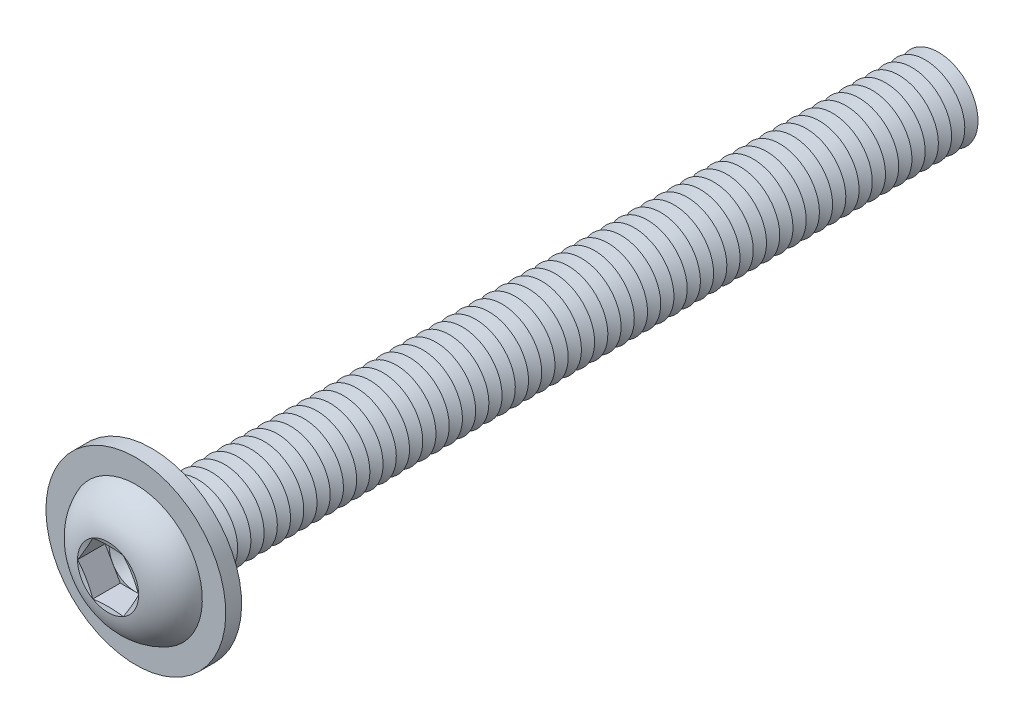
ISO-10303-21;
HEADER;
FILE_DESCRIPTION(('STEP AP214'),'2;1');
FILE_NAME('part.step','',(''),(''),'','','');
FILE_SCHEMA(('AUTOMOTIVE_DESIGN { 1 0 10303 214 1 1 1 1 }'));
ENDSEC;
DATA;
#1=APPLICATION_CONTEXT('core data for automotive mechanical design processes');
#2=APPLICATION_PROTOCOL_DEFINITION('international standard','automotive_design',2000,#1);
#3=PRODUCT_CONTEXT('',#1,'mechanical');
#4=PRODUCT('Part','Part','',(#3));
#5=PRODUCT_RELATED_PRODUCT_CATEGORY('part','',(#4));
#6=PRODUCT_DEFINITION_FORMATION('','',#4);
#7=PRODUCT_DEFINITION_CONTEXT('part definition',#1,'design');
#8=PRODUCT_DEFINITION('design','',#6,#7);
#9=PRODUCT_DEFINITION_SHAPE('','',#8);
#10=(LENGTH_UNIT() NAMED_UNIT(*) SI_UNIT(.MILLI.,.METRE.));
#11=(NAMED_UNIT(*) PLANE_ANGLE_UNIT() SI_UNIT($,.RADIAN.));
#12=(NAMED_UNIT(*) SI_UNIT($,.STERADIAN.) SOLID_ANGLE_UNIT());
#13=UNCERTAINTY_MEASURE_WITH_UNIT(LENGTH_MEASURE(1.E-05),#10,'distance_accuracy_value','');
#14=(GEOMETRIC_REPRESENTATION_CONTEXT(3) GLOBAL_UNCERTAINTY_ASSIGNED_CONTEXT((#13)) GLOBAL_UNIT_ASSIGNED_CONTEXT((#10,
#11,#12)) REPRESENTATION_CONTEXT('',''));
#15=CARTESIAN_POINT('',(0.,0.,0.));
#16=DIRECTION('',(0.,0.,1.));
#17=DIRECTION('',(1.,0.,0.));
#18=AXIS2_PLACEMENT_3D('',#15,#16,#17);
#19=CARTESIAN_POINT('',(0.,0.,-56.5));
#20=DIRECTION('',(0.,0.,1.));
#21=DIRECTION('',(0.,-1.,0.));
#22=AXIS2_PLACEMENT_3D('',#19,#20,#21);
#23=CONICAL_SURFACE('',#22,2.99999999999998,1.0471975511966);
#24=CARTESIAN_POINT('',(0.,0.,-57.));
#25=DIRECTION('',(0.,0.,1.));
#26=DIRECTION('',(0.,-1.,0.));
#27=AXIS2_PLACEMENT_3D('',#24,#25,#26);
#28=CIRCLE('',#27,2.13397459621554);
#29=CARTESIAN_POINT('',(0.,-2.13397459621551,-57.));
#30=VERTEX_POINT('',#29);
#31=EDGE_CURVE('E689',#30,#30,#28,.T.);
#32=ORIENTED_EDGE('',*,*,#31,.T.);
#33=EDGE_LOOP('',(#32));
#34=FACE_BOUND('',#33,.T.);
#35=CARTESIAN_POINT('',(0.,0.,-56.5));
#36=DIRECTION('',(0.,0.,1.));
#37=DIRECTION('',(0.,-1.,0.));
#38=AXIS2_PLACEMENT_3D('',#35,#36,#37);
#39=CIRCLE('',#38,2.99999999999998);
#40=CARTESIAN_POINT('',(0.,-2.99999999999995,-56.5));
#41=VERTEX_POINT('',#40);
#42=EDGE_CURVE('E685',#41,#41,#39,.T.);
#43=ORIENTED_EDGE('',*,*,#42,.F.);
#44=EDGE_LOOP('',(#43));
#45=FACE_BOUND('',#44,.T.);
#46=ADVANCED_FACE('F39',(#34,#45),#23,.T.);
#47=CARTESIAN_POINT('',(0.,0.,-57.));
#48=DIRECTION('',(0.,0.,-1.));
#49=DIRECTION('',(0.,1.,0.));
#50=AXIS2_PLACEMENT_3D('',#47,#48,#49);
#51=CONICAL_SURFACE('',#50,2.13397459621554,1.0471975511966);
#52=CARTESIAN_POINT('',(0.,0.,-57.5));
#53=DIRECTION('',(0.,0.,1.));
#54=DIRECTION('',(0.,-1.,0.));
#55=AXIS2_PLACEMENT_3D('',#52,#53,#54);
#56=CIRCLE('',#55,2.99999999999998);
#57=CARTESIAN_POINT('',(0.,-2.99999999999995,-57.5));
#58=VERTEX_POINT('',#57);
#59=EDGE_CURVE('E693',#58,#58,#56,.T.);
#60=ORIENTED_EDGE('',*,*,#59,.T.);
#61=EDGE_LOOP('',(#60));
#62=FACE_BOUND('',#61,.T.);
#63=ORIENTED_EDGE('',*,*,#31,.F.);
#64=EDGE_LOOP('',(#63));
#65=FACE_BOUND('',#64,.T.);
#66=ADVANCED_FACE('F809',(#62,#65),#51,.T.);
#67=CARTESIAN_POINT('',(0.,2.99999999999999,-60.));
#68=DIRECTION('',(0.,0.,-1.));
#69=DIRECTION('',(0.,1.,0.));
#70=AXIS2_PLACEMENT_3D('',#67,#68,#69);
#71=PLANE('',#70);
#72=CARTESIAN_POINT('',(0.,0.,-60.));
#73=DIRECTION('',(0.,0.,1.));
#74=DIRECTION('',(0.,-1.,0.));
#75=AXIS2_PLACEMENT_3D('',#72,#73,#74);
#76=CIRCLE('',#75,2.13397459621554);
#77=CARTESIAN_POINT('',(0.,-2.13397459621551,-60.));
#78=VERTEX_POINT('',#77);
#79=EDGE_CURVE('E713',#78,#78,#76,.T.);
#80=ORIENTED_EDGE('',*,*,#79,.F.);
#81=EDGE_LOOP('',(#80));
#82=FACE_BOUND('',#81,.T.);
#83=ADVANCED_FACE('F815',(#82),#71,.T.);
#84=CARTESIAN_POINT('',(0.,0.,-59.5));
#85=DIRECTION('',(0.,0.,1.));
#86=DIRECTION('',(0.,-1.,0.));
#87=AXIS2_PLACEMENT_3D('',#84,#85,#86);
#88=CONICAL_SURFACE('',#87,2.99999999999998,1.0471975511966);
#89=ORIENTED_EDGE('',*,*,#79,.T.);
#90=EDGE_LOOP('',(#89));
#91=FACE_BOUND('',#90,.T.);
#92=CARTESIAN_POINT('',(0.,0.,-59.5));
#93=DIRECTION('',(0.,0.,1.));
#94=DIRECTION('',(0.,-1.,0.));
#95=AXIS2_PLACEMENT_3D('',#92,#93,#94);
#96=CIRCLE('',#95,2.99999999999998);
#97=CARTESIAN_POINT('',(0.,-2.99999999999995,-59.5));
#98=VERTEX_POINT('',#97);
#99=EDGE_CURVE('E709',#98,#98,#96,.T.);
#100=ORIENTED_EDGE('',*,*,#99,.F.);
#101=EDGE_LOOP('',(#100));
#102=FACE_BOUND('',#101,.T.);
#103=ADVANCED_FACE('F834',(#91,#102),#88,.T.);
#104=CARTESIAN_POINT('',(0.,0.,-59.));
#105=DIRECTION('',(0.,0.,-1.));
#106=DIRECTION('',(0.,1.,0.));
#107=AXIS2_PLACEMENT_3D('',#104,#105,#106);
#108=CONICAL_SURFACE('',#107,2.13397459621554,1.0471975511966);
#109=ORIENTED_EDGE('',*,*,#99,.T.);
#110=EDGE_LOOP('',(#109));
#111=FACE_BOUND('',#110,.T.);
#112=CARTESIAN_POINT('',(0.,0.,-59.));
#113=DIRECTION('',(0.,0.,1.));
#114=DIRECTION('',(0.,-1.,0.));
#115=AXIS2_PLACEMENT_3D('',#112,#113,#114);
#116=CIRCLE('',#115,2.13397459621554);
#117=CARTESIAN_POINT('',(0.,-2.13397459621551,-59.));
#118=VERTEX_POINT('',#117);
#119=EDGE_CURVE('E705',#118,#118,#116,.T.);
#120=ORIENTED_EDGE('',*,*,#119,.F.);
#121=EDGE_LOOP('',(#120));
#122=FACE_BOUND('',#121,.T.);
#123=ADVANCED_FACE('F831',(#111,#122),#108,.T.);
#124=CARTESIAN_POINT('',(0.,0.,-58.5));
#125=DIRECTION('',(0.,0.,1.));
#126=DIRECTION('',(0.,-1.,0.));
#127=AXIS2_PLACEMENT_3D('',#124,#125,#126);
#128=CONICAL_SURFACE('',#127,2.99999999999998,1.0471975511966);
#129=ORIENTED_EDGE('',*,*,#119,.T.);
#130=EDGE_LOOP('',(#129));
#131=FACE_BOUND('',#130,.T.);
#132=CARTESIAN_POINT('',(0.,0.,-58.5));
#133=DIRECTION('',(0.,0.,1.));
#134=DIRECTION('',(0.,-1.,0.));
#135=AXIS2_PLACEMENT_3D('',#132,#133,#134);
#136=CIRCLE('',#135,2.99999999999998);
#137=CARTESIAN_POINT('',(0.,-2.99999999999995,-58.5));
#138=VERTEX_POINT('',#137);
#139=EDGE_CURVE('E701',#138,#138,#136,.T.);
#140=ORIENTED_EDGE('',*,*,#139,.F.);
#141=EDGE_LOOP('',(#140));
#142=FACE_BOUND('',#141,.T.);
#143=ADVANCED_FACE('F825',(#131,#142),#128,.T.);
#144=CARTESIAN_POINT('',(0.,0.,-58.));
#145=DIRECTION('',(0.,0.,-1.));
#146=DIRECTION('',(0.,1.,0.));
#147=AXIS2_PLACEMENT_3D('',#144,#145,#146);
#148=CONICAL_SURFACE('',#147,2.13397459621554,1.0471975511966);
#149=ORIENTED_EDGE('',*,*,#139,.T.);
#150=EDGE_LOOP('',(#149));
#151=FACE_BOUND('',#150,.T.);
#152=CARTESIAN_POINT('',(0.,0.,-58.));
#153=DIRECTION('',(0.,0.,1.));
#154=DIRECTION('',(0.,-1.,0.));
#155=AXIS2_PLACEMENT_3D('',#152,#153,#154);
#156=CIRCLE('',#155,2.13397459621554);
#157=CARTESIAN_POINT('',(0.,-2.13397459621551,-58.));
#158=VERTEX_POINT('',#157);
#159=EDGE_CURVE('E697',#158,#158,#156,.T.);
#160=ORIENTED_EDGE('',*,*,#159,.F.);
#161=EDGE_LOOP('',(#160));
#162=FACE_BOUND('',#161,.T.);
#163=ADVANCED_FACE('F821',(#151,#162),#148,.T.);
#164=CARTESIAN_POINT('',(0.,0.,-57.5));
#165=DIRECTION('',(0.,0.,1.));
#166=DIRECTION('',(0.,-1.,0.));
#167=AXIS2_PLACEMENT_3D('',#164,#165,#166);
#168=CONICAL_SURFACE('',#167,2.99999999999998,1.0471975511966);
#169=ORIENTED_EDGE('',*,*,#159,.T.);
#170=EDGE_LOOP('',(#169));
#171=FACE_BOUND('',#170,.T.);
#172=ORIENTED_EDGE('',*,*,#59,.F.);
#173=EDGE_LOOP('',(#172));
#174=FACE_BOUND('',#173,.T.);
#175=ADVANCED_FACE('F824',(#171,#174),#168,.T.);
#176=CARTESIAN_POINT('',(0.,0.,-55.5));
#177=DIRECTION('',(0.,0.,1.));
#178=DIRECTION('',(0.,-1.,0.));
#179=AXIS2_PLACEMENT_3D('',#176,#177,#178);
#180=CONICAL_SURFACE('',#179,2.99999999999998,1.0471975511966);
#181=CARTESIAN_POINT('',(0.,0.,-56.));
#182=DIRECTION('',(0.,0.,1.));
#183=DIRECTION('',(0.,-1.,0.));
#184=AXIS2_PLACEMENT_3D('',#181,#182,#183);
#185=CIRCLE('',#184,2.13397459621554);
#186=CARTESIAN_POINT('',(0.,-2.13397459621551,-56.));
#187=VERTEX_POINT('',#186);
#188=EDGE_CURVE('E681',#187,#187,#185,.T.);
#189=ORIENTED_EDGE('',*,*,#188,.T.);
#190=EDGE_LOOP('',(#189));
#191=FACE_BOUND('',#190,.T.);
#192=CARTESIAN_POINT('',(0.,0.,-55.5));
#193=DIRECTION('',(0.,0.,1.));
#194=DIRECTION('',(0.,-1.,0.));
#195=AXIS2_PLACEMENT_3D('',#192,#193,#194);
#196=CIRCLE('',#195,2.99999999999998);
#197=CARTESIAN_POINT('',(0.,-2.99999999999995,-55.5));
#198=VERTEX_POINT('',#197);
#199=EDGE_CURVE('E677',#198,#198,#196,.T.);
#200=ORIENTED_EDGE('',*,*,#199,.F.);
#201=EDGE_LOOP('',(#200));
#202=FACE_BOUND('',#201,.T.);
#203=ADVANCED_FACE('F829',(#191,#202),#180,.T.);
#204=CARTESIAN_POINT('',(0.,0.,-56.));
#205=DIRECTION('',(0.,0.,-1.));
#206=DIRECTION('',(0.,1.,0.));
#207=AXIS2_PLACEMENT_3D('',#204,#205,#206);
#208=CONICAL_SURFACE('',#207,2.13397459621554,1.0471975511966);
#209=ORIENTED_EDGE('',*,*,#42,.T.);
#210=EDGE_LOOP('',(#209));
#211=FACE_BOUND('',#210,.T.);
#212=ORIENTED_EDGE('',*,*,#188,.F.);
#213=EDGE_LOOP('',(#212));
#214=FACE_BOUND('',#213,.T.);
#215=ADVANCED_FACE('F880',(#211,#214),#208,.T.);
#216=CARTESIAN_POINT('',(0.,0.,-54.5));
#217=DIRECTION('',(0.,0.,1.));
#218=DIRECTION('',(0.,-1.,0.));
#219=AXIS2_PLACEMENT_3D('',#216,#217,#218);
#220=CONICAL_SURFACE('',#219,2.99999999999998,1.0471975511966);
#221=CARTESIAN_POINT('',(0.,0.,-55.));
#222=DIRECTION('',(0.,0.,1.));
#223=DIRECTION('',(0.,-1.,0.));
#224=AXIS2_PLACEMENT_3D('',#221,#222,#223);
#225=CIRCLE('',#224,2.13397459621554);
#226=CARTESIAN_POINT('',(0.,-2.13397459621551,-55.));
#227=VERTEX_POINT('',#226);
#228=EDGE_CURVE('E673',#227,#227,#225,.T.);
#229=ORIENTED_EDGE('',*,*,#228,.T.);
#230=EDGE_LOOP('',(#229));
#231=FACE_BOUND('',#230,.T.);
#232=CARTESIAN_POINT('',(0.,0.,-54.5));
#233=DIRECTION('',(0.,0.,1.));
#234=DIRECTION('',(0.,-1.,0.));
#235=AXIS2_PLACEMENT_3D('',#232,#233,#234);
#236=CIRCLE('',#235,2.99999999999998);
#237=CARTESIAN_POINT('',(0.,-2.99999999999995,-54.5));
#238=VERTEX_POINT('',#237);
#239=EDGE_CURVE('E669',#238,#238,#236,.T.);
#240=ORIENTED_EDGE('',*,*,#239,.F.);
#241=EDGE_LOOP('',(#240));
#242=FACE_BOUND('',#241,.T.);
#243=ADVANCED_FACE('F886',(#231,#242),#220,.T.);
#244=CARTESIAN_POINT('',(0.,0.,-55.));
#245=DIRECTION('',(0.,0.,-1.));
#246=DIRECTION('',(0.,1.,0.));
#247=AXIS2_PLACEMENT_3D('',#244,#245,#246);
#248=CONICAL_SURFACE('',#247,2.13397459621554,1.0471975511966);
#249=ORIENTED_EDGE('',*,*,#199,.T.);
#250=EDGE_LOOP('',(#249));
#251=FACE_BOUND('',#250,.T.);
#252=ORIENTED_EDGE('',*,*,#228,.F.);
#253=EDGE_LOOP('',(#252));
#254=FACE_BOUND('',#253,.T.);
#255=ADVANCED_FACE('F893',(#251,#254),#248,.T.);
#256=CARTESIAN_POINT('',(0.,0.,-53.5));
#257=DIRECTION('',(0.,0.,1.));
#258=DIRECTION('',(0.,-1.,0.));
#259=AXIS2_PLACEMENT_3D('',#256,#257,#258);
#260=CONICAL_SURFACE('',#259,2.99999999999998,1.0471975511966);
#261=CARTESIAN_POINT('',(0.,0.,-54.));
#262=DIRECTION('',(0.,0.,1.));
#263=DIRECTION('',(0.,-1.,0.));
#264=AXIS2_PLACEMENT_3D('',#261,#262,#263);
#265=CIRCLE('',#264,2.13397459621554);
#266=CARTESIAN_POINT('',(0.,-2.13397459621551,-54.));
#267=VERTEX_POINT('',#266);
#268=EDGE_CURVE('E665',#267,#267,#265,.T.);
#269=ORIENTED_EDGE('',*,*,#268,.T.);
#270=EDGE_LOOP('',(#269));
#271=FACE_BOUND('',#270,.T.);
#272=CARTESIAN_POINT('',(0.,0.,-53.5));
#273=DIRECTION('',(0.,0.,1.));
#274=DIRECTION('',(0.,-1.,0.));
#275=AXIS2_PLACEMENT_3D('',#272,#273,#274);
#276=CIRCLE('',#275,2.99999999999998);
#277=CARTESIAN_POINT('',(0.,-2.99999999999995,-53.5));
#278=VERTEX_POINT('',#277);
#279=EDGE_CURVE('E661',#278,#278,#276,.T.);
#280=ORIENTED_EDGE('',*,*,#279,.F.);
#281=EDGE_LOOP('',(#280));
#282=FACE_BOUND('',#281,.T.);
#283=ADVANCED_FACE('F900',(#271,#282),#260,.T.);
#284=CARTESIAN_POINT('',(0.,0.,-54.));
#285=DIRECTION('',(0.,0.,-1.));
#286=DIRECTION('',(0.,1.,0.));
#287=AXIS2_PLACEMENT_3D('',#284,#285,#286);
#288=CONICAL_SURFACE('',#287,2.13397459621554,1.0471975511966);
#289=ORIENTED_EDGE('',*,*,#239,.T.);
#290=EDGE_LOOP('',(#289));
#291=FACE_BOUND('',#290,.T.);
#292=ORIENTED_EDGE('',*,*,#268,.F.);
#293=EDGE_LOOP('',(#292));
#294=FACE_BOUND('',#293,.T.);
#295=ADVANCED_FACE('F907',(#291,#294),#288,.T.);
#296=CARTESIAN_POINT('',(0.,0.,-52.5));
#297=DIRECTION('',(0.,0.,1.));
#298=DIRECTION('',(0.,-1.,0.));
#299=AXIS2_PLACEMENT_3D('',#296,#297,#298);
#300=CONICAL_SURFACE('',#299,2.99999999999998,1.0471975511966);
#301=CARTESIAN_POINT('',(0.,0.,-53.));
#302=DIRECTION('',(0.,0.,1.));
#303=DIRECTION('',(0.,-1.,0.));
#304=AXIS2_PLACEMENT_3D('',#301,#302,#303);
#305=CIRCLE('',#304,2.13397459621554);
#306=CARTESIAN_POINT('',(0.,-2.13397459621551,-53.));
#307=VERTEX_POINT('',#306);
#308=EDGE_CURVE('E657',#307,#307,#305,.T.);
#309=ORIENTED_EDGE('',*,*,#308,.T.);
#310=EDGE_LOOP('',(#309));
#311=FACE_BOUND('',#310,.T.);
#312=CARTESIAN_POINT('',(0.,0.,-52.5));
#313=DIRECTION('',(0.,0.,1.));
#314=DIRECTION('',(0.,-1.,0.));
#315=AXIS2_PLACEMENT_3D('',#312,#313,#314);
#316=CIRCLE('',#315,2.99999999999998);
#317=CARTESIAN_POINT('',(0.,-2.99999999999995,-52.5));
#318=VERTEX_POINT('',#317);
#319=EDGE_CURVE('E653',#318,#318,#316,.T.);
#320=ORIENTED_EDGE('',*,*,#319,.F.);
#321=EDGE_LOOP('',(#320));
#322=FACE_BOUND('',#321,.T.);
#323=ADVANCED_FACE('F914',(#311,#322),#300,.T.);
#324=CARTESIAN_POINT('',(0.,0.,-53.));
#325=DIRECTION('',(0.,0.,-1.));
#326=DIRECTION('',(0.,1.,0.));
#327=AXIS2_PLACEMENT_3D('',#324,#325,#326);
#328=CONICAL_SURFACE('',#327,2.13397459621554,1.0471975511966);
#329=ORIENTED_EDGE('',*,*,#279,.T.);
#330=EDGE_LOOP('',(#329));
#331=FACE_BOUND('',#330,.T.);
#332=ORIENTED_EDGE('',*,*,#308,.F.);
#333=EDGE_LOOP('',(#332));
#334=FACE_BOUND('',#333,.T.);
#335=ADVANCED_FACE('F921',(#331,#334),#328,.T.);
#336=CARTESIAN_POINT('',(0.,0.,-51.5));
#337=DIRECTION('',(0.,0.,1.));
#338=DIRECTION('',(0.,-1.,0.));
#339=AXIS2_PLACEMENT_3D('',#336,#337,#338);
#340=CONICAL_SURFACE('',#339,2.99999999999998,1.0471975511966);
#341=CARTESIAN_POINT('',(0.,0.,-52.));
#342=DIRECTION('',(0.,0.,1.));
#343=DIRECTION('',(0.,-1.,0.));
#344=AXIS2_PLACEMENT_3D('',#341,#342,#343);
#345=CIRCLE('',#344,2.13397459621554);
#346=CARTESIAN_POINT('',(0.,-2.13397459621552,-52.));
#347=VERTEX_POINT('',#346);
#348=EDGE_CURVE('E649',#347,#347,#345,.T.);
#349=ORIENTED_EDGE('',*,*,#348,.T.);
#350=EDGE_LOOP('',(#349));
#351=FACE_BOUND('',#350,.T.);
#352=CARTESIAN_POINT('',(0.,0.,-51.5));
#353=DIRECTION('',(0.,0.,1.));
#354=DIRECTION('',(0.,-1.,0.));
#355=AXIS2_PLACEMENT_3D('',#352,#353,#354);
#356=CIRCLE('',#355,2.99999999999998);
#357=CARTESIAN_POINT('',(0.,-2.99999999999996,-51.5));
#358=VERTEX_POINT('',#357);
#359=EDGE_CURVE('E645',#358,#358,#356,.T.);
#360=ORIENTED_EDGE('',*,*,#359,.F.);
#361=EDGE_LOOP('',(#360));
#362=FACE_BOUND('',#361,.T.);
#363=ADVANCED_FACE('F928',(#351,#362),#340,.T.);
#364=CARTESIAN_POINT('',(0.,0.,-52.));
#365=DIRECTION('',(0.,0.,-1.));
#366=DIRECTION('',(0.,1.,0.));
#367=AXIS2_PLACEMENT_3D('',#364,#365,#366);
#368=CONICAL_SURFACE('',#367,2.13397459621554,1.0471975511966);
#369=ORIENTED_EDGE('',*,*,#319,.T.);
#370=EDGE_LOOP('',(#369));
#371=FACE_BOUND('',#370,.T.);
#372=ORIENTED_EDGE('',*,*,#348,.F.);
#373=EDGE_LOOP('',(#372));
#374=FACE_BOUND('',#373,.T.);
#375=ADVANCED_FACE('F935',(#371,#374),#368,.T.);
#376=CARTESIAN_POINT('',(0.,0.,-50.5));
#377=DIRECTION('',(0.,0.,1.));
#378=DIRECTION('',(0.,-1.,0.));
#379=AXIS2_PLACEMENT_3D('',#376,#377,#378);
#380=CONICAL_SURFACE('',#379,2.99999999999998,1.0471975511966);
#381=CARTESIAN_POINT('',(0.,0.,-51.));
#382=DIRECTION('',(0.,0.,1.));
#383=DIRECTION('',(0.,-1.,0.));
#384=AXIS2_PLACEMENT_3D('',#381,#382,#383);
#385=CIRCLE('',#384,2.13397459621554);
#386=CARTESIAN_POINT('',(0.,-2.13397459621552,-51.));
#387=VERTEX_POINT('',#386);
#388=EDGE_CURVE('E641',#387,#387,#385,.T.);
#389=ORIENTED_EDGE('',*,*,#388,.T.);
#390=EDGE_LOOP('',(#389));
#391=FACE_BOUND('',#390,.T.);
#392=CARTESIAN_POINT('',(0.,0.,-50.5));
#393=DIRECTION('',(0.,0.,1.));
#394=DIRECTION('',(0.,-1.,0.));
#395=AXIS2_PLACEMENT_3D('',#392,#393,#394);
#396=CIRCLE('',#395,2.99999999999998);
#397=CARTESIAN_POINT('',(0.,-2.99999999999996,-50.5));
#398=VERTEX_POINT('',#397);
#399=EDGE_CURVE('E637',#398,#398,#396,.T.);
#400=ORIENTED_EDGE('',*,*,#399,.F.);
#401=EDGE_LOOP('',(#400));
#402=FACE_BOUND('',#401,.T.);
#403=ADVANCED_FACE('F942',(#391,#402),#380,.T.);
#404=CARTESIAN_POINT('',(0.,0.,-51.));
#405=DIRECTION('',(0.,0.,-1.));
#406=DIRECTION('',(0.,1.,0.));
#407=AXIS2_PLACEMENT_3D('',#404,#405,#406);
#408=CONICAL_SURFACE('',#407,2.13397459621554,1.0471975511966);
#409=ORIENTED_EDGE('',*,*,#359,.T.);
#410=EDGE_LOOP('',(#409));
#411=FACE_BOUND('',#410,.T.);
#412=ORIENTED_EDGE('',*,*,#388,.F.);
#413=EDGE_LOOP('',(#412));
#414=FACE_BOUND('',#413,.T.);
#415=ADVANCED_FACE('F949',(#411,#414),#408,.T.);
#416=CARTESIAN_POINT('',(0.,0.,-49.5));
#417=DIRECTION('',(0.,0.,1.));
#418=DIRECTION('',(0.,-1.,0.));
#419=AXIS2_PLACEMENT_3D('',#416,#417,#418);
#420=CONICAL_SURFACE('',#419,2.99999999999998,1.0471975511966);
#421=CARTESIAN_POINT('',(0.,0.,-50.));
#422=DIRECTION('',(0.,0.,1.));
#423=DIRECTION('',(0.,-1.,0.));
#424=AXIS2_PLACEMENT_3D('',#421,#422,#423);
#425=CIRCLE('',#424,2.13397459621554);
#426=CARTESIAN_POINT('',(0.,-2.13397459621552,-50.));
#427=VERTEX_POINT('',#426);
#428=EDGE_CURVE('E633',#427,#427,#425,.T.);
#429=ORIENTED_EDGE('',*,*,#428,.T.);
#430=EDGE_LOOP('',(#429));
#431=FACE_BOUND('',#430,.T.);
#432=CARTESIAN_POINT('',(0.,0.,-49.5));
#433=DIRECTION('',(0.,0.,1.));
#434=DIRECTION('',(0.,-1.,0.));
#435=AXIS2_PLACEMENT_3D('',#432,#433,#434);
#436=CIRCLE('',#435,2.99999999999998);
#437=CARTESIAN_POINT('',(0.,-2.99999999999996,-49.5));
#438=VERTEX_POINT('',#437);
#439=EDGE_CURVE('E629',#438,#438,#436,.T.);
#440=ORIENTED_EDGE('',*,*,#439,.F.);
#441=EDGE_LOOP('',(#440));
#442=FACE_BOUND('',#441,.T.);
#443=ADVANCED_FACE('F956',(#431,#442),#420,.T.);
#444=CARTESIAN_POINT('',(0.,0.,-50.));
#445=DIRECTION('',(0.,0.,-1.));
#446=DIRECTION('',(0.,1.,0.));
#447=AXIS2_PLACEMENT_3D('',#444,#445,#446);
#448=CONICAL_SURFACE('',#447,2.13397459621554,1.0471975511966);
#449=ORIENTED_EDGE('',*,*,#399,.T.);
#450=EDGE_LOOP('',(#449));
#451=FACE_BOUND('',#450,.T.);
#452=ORIENTED_EDGE('',*,*,#428,.F.);
#453=EDGE_LOOP('',(#452));
#454=FACE_BOUND('',#453,.T.);
#455=ADVANCED_FACE('F963',(#451,#454),#448,.T.);
#456=CARTESIAN_POINT('',(0.,0.,-48.5));
#457=DIRECTION('',(0.,0.,1.));
#458=DIRECTION('',(0.,-1.,0.));
#459=AXIS2_PLACEMENT_3D('',#456,#457,#458);
#460=CONICAL_SURFACE('',#459,2.99999999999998,1.0471975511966);
#461=CARTESIAN_POINT('',(0.,0.,-49.));
#462=DIRECTION('',(0.,0.,1.));
#463=DIRECTION('',(0.,-1.,0.));
#464=AXIS2_PLACEMENT_3D('',#461,#462,#463);
#465=CIRCLE('',#464,2.13397459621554);
#466=CARTESIAN_POINT('',(0.,-2.13397459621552,-49.));
#467=VERTEX_POINT('',#466);
#468=EDGE_CURVE('E625',#467,#467,#465,.T.);
#469=ORIENTED_EDGE('',*,*,#468,.T.);
#470=EDGE_LOOP('',(#469));
#471=FACE_BOUND('',#470,.T.);
#472=CARTESIAN_POINT('',(0.,0.,-48.5));
#473=DIRECTION('',(0.,0.,1.));
#474=DIRECTION('',(0.,-1.,0.));
#475=AXIS2_PLACEMENT_3D('',#472,#473,#474);
#476=CIRCLE('',#475,2.99999999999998);
#477=CARTESIAN_POINT('',(0.,-2.99999999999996,-48.5));
#478=VERTEX_POINT('',#477);
#479=EDGE_CURVE('E621',#478,#478,#476,.T.);
#480=ORIENTED_EDGE('',*,*,#479,.F.);
#481=EDGE_LOOP('',(#480));
#482=FACE_BOUND('',#481,.T.);
#483=ADVANCED_FACE('F970',(#471,#482),#460,.T.);
#484=CARTESIAN_POINT('',(0.,0.,-49.));
#485=DIRECTION('',(0.,0.,-1.));
#486=DIRECTION('',(0.,1.,0.));
#487=AXIS2_PLACEMENT_3D('',#484,#485,#486);
#488=CONICAL_SURFACE('',#487,2.13397459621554,1.0471975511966);
#489=ORIENTED_EDGE('',*,*,#439,.T.);
#490=EDGE_LOOP('',(#489));
#491=FACE_BOUND('',#490,.T.);
#492=ORIENTED_EDGE('',*,*,#468,.F.);
#493=EDGE_LOOP('',(#492));
#494=FACE_BOUND('',#493,.T.);
#495=ADVANCED_FACE('F977',(#491,#494),#488,.T.);
#496=CARTESIAN_POINT('',(0.,0.,-47.5));
#497=DIRECTION('',(0.,0.,1.));
#498=DIRECTION('',(0.,-1.,0.));
#499=AXIS2_PLACEMENT_3D('',#496,#497,#498);
#500=CONICAL_SURFACE('',#499,2.99999999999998,1.0471975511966);
#501=CARTESIAN_POINT('',(0.,0.,-48.));
#502=DIRECTION('',(0.,0.,1.));
#503=DIRECTION('',(0.,-1.,0.));
#504=AXIS2_PLACEMENT_3D('',#501,#502,#503);
#505=CIRCLE('',#504,2.13397459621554);
#506=CARTESIAN_POINT('',(0.,-2.13397459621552,-48.));
#507=VERTEX_POINT('',#506);
#508=EDGE_CURVE('E617',#507,#507,#505,.T.);
#509=ORIENTED_EDGE('',*,*,#508,.T.);
#510=EDGE_LOOP('',(#509));
#511=FACE_BOUND('',#510,.T.);
#512=CARTESIAN_POINT('',(0.,0.,-47.5));
#513=DIRECTION('',(0.,0.,1.));
#514=DIRECTION('',(0.,-1.,0.));
#515=AXIS2_PLACEMENT_3D('',#512,#513,#514);
#516=CIRCLE('',#515,2.99999999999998);
#517=CARTESIAN_POINT('',(0.,-2.99999999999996,-47.5));
#518=VERTEX_POINT('',#517);
#519=EDGE_CURVE('E613',#518,#518,#516,.T.);
#520=ORIENTED_EDGE('',*,*,#519,.F.);
#521=EDGE_LOOP('',(#520));
#522=FACE_BOUND('',#521,.T.);
#523=ADVANCED_FACE('F984',(#511,#522),#500,.T.);
#524=CARTESIAN_POINT('',(0.,0.,-48.));
#525=DIRECTION('',(0.,0.,-1.));
#526=DIRECTION('',(0.,1.,0.));
#527=AXIS2_PLACEMENT_3D('',#524,#525,#526);
#528=CONICAL_SURFACE('',#527,2.13397459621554,1.0471975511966);
#529=ORIENTED_EDGE('',*,*,#479,.T.);
#530=EDGE_LOOP('',(#529));
#531=FACE_BOUND('',#530,.T.);
#532=ORIENTED_EDGE('',*,*,#508,.F.);
#533=EDGE_LOOP('',(#532));
#534=FACE_BOUND('',#533,.T.);
#535=ADVANCED_FACE('F991',(#531,#534),#528,.T.);
#536=CARTESIAN_POINT('',(0.,0.,-46.5));
#537=DIRECTION('',(0.,0.,1.));
#538=DIRECTION('',(0.,-1.,0.));
#539=AXIS2_PLACEMENT_3D('',#536,#537,#538);
#540=CONICAL_SURFACE('',#539,2.99999999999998,1.0471975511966);
#541=CARTESIAN_POINT('',(0.,0.,-47.));
#542=DIRECTION('',(0.,0.,1.));
#543=DIRECTION('',(0.,-1.,0.));
#544=AXIS2_PLACEMENT_3D('',#541,#542,#543);
#545=CIRCLE('',#544,2.13397459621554);
#546=CARTESIAN_POINT('',(0.,-2.13397459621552,-47.));
#547=VERTEX_POINT('',#546);
#548=EDGE_CURVE('E609',#547,#547,#545,.T.);
#549=ORIENTED_EDGE('',*,*,#548,.T.);
#550=EDGE_LOOP('',(#549));
#551=FACE_BOUND('',#550,.T.);
#552=CARTESIAN_POINT('',(0.,0.,-46.5));
#553=DIRECTION('',(0.,0.,1.));
#554=DIRECTION('',(0.,-1.,0.));
#555=AXIS2_PLACEMENT_3D('',#552,#553,#554);
#556=CIRCLE('',#555,2.99999999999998);
#557=CARTESIAN_POINT('',(0.,-2.99999999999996,-46.5));
#558=VERTEX_POINT('',#557);
#559=EDGE_CURVE('E605',#558,#558,#556,.T.);
#560=ORIENTED_EDGE('',*,*,#559,.F.);
#561=EDGE_LOOP('',(#560));
#562=FACE_BOUND('',#561,.T.);
#563=ADVANCED_FACE('F998',(#551,#562),#540,.T.);
#564=CARTESIAN_POINT('',(0.,0.,-47.));
#565=DIRECTION('',(0.,0.,-1.));
#566=DIRECTION('',(0.,1.,0.));
#567=AXIS2_PLACEMENT_3D('',#564,#565,#566);
#568=CONICAL_SURFACE('',#567,2.13397459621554,1.0471975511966);
#569=ORIENTED_EDGE('',*,*,#519,.T.);
#570=EDGE_LOOP('',(#569));
#571=FACE_BOUND('',#570,.T.);
#572=ORIENTED_EDGE('',*,*,#548,.F.);
#573=EDGE_LOOP('',(#572));
#574=FACE_BOUND('',#573,.T.);
#575=ADVANCED_FACE('F1005',(#571,#574),#568,.T.);
#576=CARTESIAN_POINT('',(0.,0.,-45.5));
#577=DIRECTION('',(0.,0.,1.));
#578=DIRECTION('',(0.,-1.,0.));
#579=AXIS2_PLACEMENT_3D('',#576,#577,#578);
#580=CONICAL_SURFACE('',#579,2.99999999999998,1.0471975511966);
#581=CARTESIAN_POINT('',(0.,0.,-46.));
#582=DIRECTION('',(0.,0.,1.));
#583=DIRECTION('',(0.,-1.,0.));
#584=AXIS2_PLACEMENT_3D('',#581,#582,#583);
#585=CIRCLE('',#584,2.13397459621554);
#586=CARTESIAN_POINT('',(0.,-2.13397459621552,-46.));
#587=VERTEX_POINT('',#586);
#588=EDGE_CURVE('E601',#587,#587,#585,.T.);
#589=ORIENTED_EDGE('',*,*,#588,.T.);
#590=EDGE_LOOP('',(#589));
#591=FACE_BOUND('',#590,.T.);
#592=CARTESIAN_POINT('',(0.,0.,-45.5));
#593=DIRECTION('',(0.,0.,1.));
#594=DIRECTION('',(0.,-1.,0.));
#595=AXIS2_PLACEMENT_3D('',#592,#593,#594);
#596=CIRCLE('',#595,2.99999999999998);
#597=CARTESIAN_POINT('',(0.,-2.99999999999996,-45.5));
#598=VERTEX_POINT('',#597);
#599=EDGE_CURVE('E597',#598,#598,#596,.T.);
#600=ORIENTED_EDGE('',*,*,#599,.F.);
#601=EDGE_LOOP('',(#600));
#602=FACE_BOUND('',#601,.T.);
#603=ADVANCED_FACE('F1012',(#591,#602),#580,.T.);
#604=CARTESIAN_POINT('',(0.,0.,-46.));
#605=DIRECTION('',(0.,0.,-1.));
#606=DIRECTION('',(0.,1.,0.));
#607=AXIS2_PLACEMENT_3D('',#604,#605,#606);
#608=CONICAL_SURFACE('',#607,2.13397459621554,1.0471975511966);
#609=ORIENTED_EDGE('',*,*,#559,.T.);
#610=EDGE_LOOP('',(#609));
#611=FACE_BOUND('',#610,.T.);
#612=ORIENTED_EDGE('',*,*,#588,.F.);
#613=EDGE_LOOP('',(#612));
#614=FACE_BOUND('',#613,.T.);
#615=ADVANCED_FACE('F1019',(#611,#614),#608,.T.);
#616=CARTESIAN_POINT('',(0.,0.,-44.5));
#617=DIRECTION('',(0.,0.,1.));
#618=DIRECTION('',(0.,-1.,0.));
#619=AXIS2_PLACEMENT_3D('',#616,#617,#618);
#620=CONICAL_SURFACE('',#619,2.99999999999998,1.0471975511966);
#621=CARTESIAN_POINT('',(0.,0.,-45.));
#622=DIRECTION('',(0.,0.,1.));
#623=DIRECTION('',(0.,-1.,0.));
#624=AXIS2_PLACEMENT_3D('',#621,#622,#623);
#625=CIRCLE('',#624,2.13397459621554);
#626=CARTESIAN_POINT('',(0.,-2.13397459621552,-45.));
#627=VERTEX_POINT('',#626);
#628=EDGE_CURVE('E593',#627,#627,#625,.T.);
#629=ORIENTED_EDGE('',*,*,#628,.T.);
#630=EDGE_LOOP('',(#629));
#631=FACE_BOUND('',#630,.T.);
#632=CARTESIAN_POINT('',(0.,0.,-44.5));
#633=DIRECTION('',(0.,0.,1.));
#634=DIRECTION('',(0.,-1.,0.));
#635=AXIS2_PLACEMENT_3D('',#632,#633,#634);
#636=CIRCLE('',#635,2.99999999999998);
#637=CARTESIAN_POINT('',(0.,-2.99999999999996,-44.5));
#638=VERTEX_POINT('',#637);
#639=EDGE_CURVE('E589',#638,#638,#636,.T.);
#640=ORIENTED_EDGE('',*,*,#639,.F.);
#641=EDGE_LOOP('',(#640));
#642=FACE_BOUND('',#641,.T.);
#643=ADVANCED_FACE('F1026',(#631,#642),#620,.T.);
#644=CARTESIAN_POINT('',(0.,0.,-45.));
#645=DIRECTION('',(0.,0.,-1.));
#646=DIRECTION('',(0.,1.,0.));
#647=AXIS2_PLACEMENT_3D('',#644,#645,#646);
#648=CONICAL_SURFACE('',#647,2.13397459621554,1.0471975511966);
#649=ORIENTED_EDGE('',*,*,#599,.T.);
#650=EDGE_LOOP('',(#649));
#651=FACE_BOUND('',#650,.T.);
#652=ORIENTED_EDGE('',*,*,#628,.F.);
#653=EDGE_LOOP('',(#652));
#654=FACE_BOUND('',#653,.T.);
#655=ADVANCED_FACE('F1033',(#651,#654),#648,.T.);
#656=CARTESIAN_POINT('',(0.,0.,-43.5));
#657=DIRECTION('',(0.,0.,1.));
#658=DIRECTION('',(0.,-1.,0.));
#659=AXIS2_PLACEMENT_3D('',#656,#657,#658);
#660=CONICAL_SURFACE('',#659,2.99999999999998,1.0471975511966);
#661=CARTESIAN_POINT('',(0.,0.,-44.));
#662=DIRECTION('',(0.,0.,1.));
#663=DIRECTION('',(0.,-1.,0.));
#664=AXIS2_PLACEMENT_3D('',#661,#662,#663);
#665=CIRCLE('',#664,2.13397459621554);
#666=CARTESIAN_POINT('',(0.,-2.13397459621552,-44.));
#667=VERTEX_POINT('',#666);
#668=EDGE_CURVE('E585',#667,#667,#665,.T.);
#669=ORIENTED_EDGE('',*,*,#668,.T.);
#670=EDGE_LOOP('',(#669));
#671=FACE_BOUND('',#670,.T.);
#672=CARTESIAN_POINT('',(0.,0.,-43.5));
#673=DIRECTION('',(0.,0.,1.));
#674=DIRECTION('',(0.,-1.,0.));
#675=AXIS2_PLACEMENT_3D('',#672,#673,#674);
#676=CIRCLE('',#675,2.99999999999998);
#677=CARTESIAN_POINT('',(0.,-2.99999999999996,-43.5));
#678=VERTEX_POINT('',#677);
#679=EDGE_CURVE('E581',#678,#678,#676,.T.);
#680=ORIENTED_EDGE('',*,*,#679,.F.);
#681=EDGE_LOOP('',(#680));
#682=FACE_BOUND('',#681,.T.);
#683=ADVANCED_FACE('F1040',(#671,#682),#660,.T.);
#684=CARTESIAN_POINT('',(0.,0.,-44.));
#685=DIRECTION('',(0.,0.,-1.));
#686=DIRECTION('',(0.,1.,0.));
#687=AXIS2_PLACEMENT_3D('',#684,#685,#686);
#688=CONICAL_SURFACE('',#687,2.13397459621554,1.0471975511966);
#689=ORIENTED_EDGE('',*,*,#639,.T.);
#690=EDGE_LOOP('',(#689));
#691=FACE_BOUND('',#690,.T.);
#692=ORIENTED_EDGE('',*,*,#668,.F.);
#693=EDGE_LOOP('',(#692));
#694=FACE_BOUND('',#693,.T.);
#695=ADVANCED_FACE('F1047',(#691,#694),#688,.T.);
#696=CARTESIAN_POINT('',(0.,0.,-42.5));
#697=DIRECTION('',(0.,0.,1.));
#698=DIRECTION('',(0.,-1.,0.));
#699=AXIS2_PLACEMENT_3D('',#696,#697,#698);
#700=CONICAL_SURFACE('',#699,2.99999999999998,1.0471975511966);
#701=CARTESIAN_POINT('',(0.,0.,-43.));
#702=DIRECTION('',(0.,0.,1.));
#703=DIRECTION('',(0.,-1.,0.));
#704=AXIS2_PLACEMENT_3D('',#701,#702,#703);
#705=CIRCLE('',#704,2.13397459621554);
#706=CARTESIAN_POINT('',(0.,-2.13397459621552,-43.));
#707=VERTEX_POINT('',#706);
#708=EDGE_CURVE('E577',#707,#707,#705,.T.);
#709=ORIENTED_EDGE('',*,*,#708,.T.);
#710=EDGE_LOOP('',(#709));
#711=FACE_BOUND('',#710,.T.);
#712=CARTESIAN_POINT('',(0.,0.,-42.5));
#713=DIRECTION('',(0.,0.,1.));
#714=DIRECTION('',(0.,-1.,0.));
#715=AXIS2_PLACEMENT_3D('',#712,#713,#714);
#716=CIRCLE('',#715,2.99999999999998);
#717=CARTESIAN_POINT('',(0.,-2.99999999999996,-42.5));
#718=VERTEX_POINT('',#717);
#719=EDGE_CURVE('E573',#718,#718,#716,.T.);
#720=ORIENTED_EDGE('',*,*,#719,.F.);
#721=EDGE_LOOP('',(#720));
#722=FACE_BOUND('',#721,.T.);
#723=ADVANCED_FACE('F1054',(#711,#722),#700,.T.);
#724=CARTESIAN_POINT('',(0.,0.,-43.));
#725=DIRECTION('',(0.,0.,-1.));
#726=DIRECTION('',(0.,1.,0.));
#727=AXIS2_PLACEMENT_3D('',#724,#725,#726);
#728=CONICAL_SURFACE('',#727,2.13397459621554,1.0471975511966);
#729=ORIENTED_EDGE('',*,*,#679,.T.);
#730=EDGE_LOOP('',(#729));
#731=FACE_BOUND('',#730,.T.);
#732=ORIENTED_EDGE('',*,*,#708,.F.);
#733=EDGE_LOOP('',(#732));
#734=FACE_BOUND('',#733,.T.);
#735=ADVANCED_FACE('F1061',(#731,#734),#728,.T.);
#736=CARTESIAN_POINT('',(0.,0.,-41.5));
#737=DIRECTION('',(0.,0.,1.));
#738=DIRECTION('',(0.,-1.,0.));
#739=AXIS2_PLACEMENT_3D('',#736,#737,#738);
#740=CONICAL_SURFACE('',#739,2.99999999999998,1.0471975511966);
#741=CARTESIAN_POINT('',(0.,0.,-42.));
#742=DIRECTION('',(0.,0.,1.));
#743=DIRECTION('',(0.,-1.,0.));
#744=AXIS2_PLACEMENT_3D('',#741,#742,#743);
#745=CIRCLE('',#744,2.13397459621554);
#746=CARTESIAN_POINT('',(0.,-2.13397459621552,-42.));
#747=VERTEX_POINT('',#746);
#748=EDGE_CURVE('E569',#747,#747,#745,.T.);
#749=ORIENTED_EDGE('',*,*,#748,.T.);
#750=EDGE_LOOP('',(#749));
#751=FACE_BOUND('',#750,.T.);
#752=CARTESIAN_POINT('',(0.,0.,-41.5));
#753=DIRECTION('',(0.,0.,1.));
#754=DIRECTION('',(0.,-1.,0.));
#755=AXIS2_PLACEMENT_3D('',#752,#753,#754);
#756=CIRCLE('',#755,2.99999999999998);
#757=CARTESIAN_POINT('',(0.,-2.99999999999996,-41.5));
#758=VERTEX_POINT('',#757);
#759=EDGE_CURVE('E565',#758,#758,#756,.T.);
#760=ORIENTED_EDGE('',*,*,#759,.F.);
#761=EDGE_LOOP('',(#760));
#762=FACE_BOUND('',#761,.T.);
#763=ADVANCED_FACE('F1068',(#751,#762),#740,.T.);
#764=CARTESIAN_POINT('',(0.,0.,-42.));
#765=DIRECTION('',(0.,0.,-1.));
#766=DIRECTION('',(0.,1.,0.));
#767=AXIS2_PLACEMENT_3D('',#764,#765,#766);
#768=CONICAL_SURFACE('',#767,2.13397459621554,1.0471975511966);
#769=ORIENTED_EDGE('',*,*,#719,.T.);
#770=EDGE_LOOP('',(#769));
#771=FACE_BOUND('',#770,.T.);
#772=ORIENTED_EDGE('',*,*,#748,.F.);
#773=EDGE_LOOP('',(#772));
#774=FACE_BOUND('',#773,.T.);
#775=ADVANCED_FACE('F1075',(#771,#774),#768,.T.);
#776=CARTESIAN_POINT('',(0.,0.,-40.5));
#777=DIRECTION('',(0.,0.,1.));
#778=DIRECTION('',(0.,-1.,0.));
#779=AXIS2_PLACEMENT_3D('',#776,#777,#778);
#780=CONICAL_SURFACE('',#779,2.99999999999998,1.0471975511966);
#781=CARTESIAN_POINT('',(0.,0.,-41.));
#782=DIRECTION('',(0.,0.,1.));
#783=DIRECTION('',(0.,-1.,0.));
#784=AXIS2_PLACEMENT_3D('',#781,#782,#783);
#785=CIRCLE('',#784,2.13397459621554);
#786=CARTESIAN_POINT('',(0.,-2.13397459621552,-41.));
#787=VERTEX_POINT('',#786);
#788=EDGE_CURVE('E561',#787,#787,#785,.T.);
#789=ORIENTED_EDGE('',*,*,#788,.T.);
#790=EDGE_LOOP('',(#789));
#791=FACE_BOUND('',#790,.T.);
#792=CARTESIAN_POINT('',(0.,0.,-40.5));
#793=DIRECTION('',(0.,0.,1.));
#794=DIRECTION('',(0.,-1.,0.));
#795=AXIS2_PLACEMENT_3D('',#792,#793,#794);
#796=CIRCLE('',#795,2.99999999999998);
#797=CARTESIAN_POINT('',(0.,-2.99999999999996,-40.5));
#798=VERTEX_POINT('',#797);
#799=EDGE_CURVE('E557',#798,#798,#796,.T.);
#800=ORIENTED_EDGE('',*,*,#799,.F.);
#801=EDGE_LOOP('',(#800));
#802=FACE_BOUND('',#801,.T.);
#803=ADVANCED_FACE('F1082',(#791,#802),#780,.T.);
#804=CARTESIAN_POINT('',(0.,0.,-41.));
#805=DIRECTION('',(0.,0.,-1.));
#806=DIRECTION('',(0.,1.,0.));
#807=AXIS2_PLACEMENT_3D('',#804,#805,#806);
#808=CONICAL_SURFACE('',#807,2.13397459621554,1.0471975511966);
#809=ORIENTED_EDGE('',*,*,#759,.T.);
#810=EDGE_LOOP('',(#809));
#811=FACE_BOUND('',#810,.T.);
#812=ORIENTED_EDGE('',*,*,#788,.F.);
#813=EDGE_LOOP('',(#812));
#814=FACE_BOUND('',#813,.T.);
#815=ADVANCED_FACE('F1089',(#811,#814),#808,.T.);
#816=CARTESIAN_POINT('',(0.,0.,-39.5));
#817=DIRECTION('',(0.,0.,1.));
#818=DIRECTION('',(0.,-1.,0.));
#819=AXIS2_PLACEMENT_3D('',#816,#817,#818);
#820=CONICAL_SURFACE('',#819,2.99999999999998,1.0471975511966);
#821=CARTESIAN_POINT('',(0.,0.,-40.));
#822=DIRECTION('',(0.,0.,1.));
#823=DIRECTION('',(0.,-1.,0.));
#824=AXIS2_PLACEMENT_3D('',#821,#822,#823);
#825=CIRCLE('',#824,2.13397459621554);
#826=CARTESIAN_POINT('',(0.,-2.13397459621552,-40.));
#827=VERTEX_POINT('',#826);
#828=EDGE_CURVE('E553',#827,#827,#825,.T.);
#829=ORIENTED_EDGE('',*,*,#828,.T.);
#830=EDGE_LOOP('',(#829));
#831=FACE_BOUND('',#830,.T.);
#832=CARTESIAN_POINT('',(0.,0.,-39.5));
#833=DIRECTION('',(0.,0.,1.));
#834=DIRECTION('',(0.,-1.,0.));
#835=AXIS2_PLACEMENT_3D('',#832,#833,#834);
#836=CIRCLE('',#835,2.99999999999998);
#837=CARTESIAN_POINT('',(0.,-2.99999999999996,-39.5));
#838=VERTEX_POINT('',#837);
#839=EDGE_CURVE('E549',#838,#838,#836,.T.);
#840=ORIENTED_EDGE('',*,*,#839,.F.);
#841=EDGE_LOOP('',(#840));
#842=FACE_BOUND('',#841,.T.);
#843=ADVANCED_FACE('F1096',(#831,#842),#820,.T.);
#844=CARTESIAN_POINT('',(0.,0.,-40.));
#845=DIRECTION('',(0.,0.,-1.));
#846=DIRECTION('',(0.,1.,0.));
#847=AXIS2_PLACEMENT_3D('',#844,#845,#846);
#848=CONICAL_SURFACE('',#847,2.13397459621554,1.0471975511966);
#849=ORIENTED_EDGE('',*,*,#799,.T.);
#850=EDGE_LOOP('',(#849));
#851=FACE_BOUND('',#850,.T.);
#852=ORIENTED_EDGE('',*,*,#828,.F.);
#853=EDGE_LOOP('',(#852));
#854=FACE_BOUND('',#853,.T.);
#855=ADVANCED_FACE('F1103',(#851,#854),#848,.T.);
#856=CARTESIAN_POINT('',(0.,0.,-38.5));
#857=DIRECTION('',(0.,0.,1.));
#858=DIRECTION('',(0.,-1.,0.));
#859=AXIS2_PLACEMENT_3D('',#856,#857,#858);
#860=CONICAL_SURFACE('',#859,2.99999999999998,1.0471975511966);
#861=CARTESIAN_POINT('',(0.,0.,-39.));
#862=DIRECTION('',(0.,0.,1.));
#863=DIRECTION('',(0.,-1.,0.));
#864=AXIS2_PLACEMENT_3D('',#861,#862,#863);
#865=CIRCLE('',#864,2.13397459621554);
#866=CARTESIAN_POINT('',(0.,-2.13397459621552,-39.));
#867=VERTEX_POINT('',#866);
#868=EDGE_CURVE('E545',#867,#867,#865,.T.);
#869=ORIENTED_EDGE('',*,*,#868,.T.);
#870=EDGE_LOOP('',(#869));
#871=FACE_BOUND('',#870,.T.);
#872=CARTESIAN_POINT('',(0.,0.,-38.5));
#873=DIRECTION('',(0.,0.,1.));
#874=DIRECTION('',(0.,-1.,0.));
#875=AXIS2_PLACEMENT_3D('',#872,#873,#874);
#876=CIRCLE('',#875,2.99999999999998);
#877=CARTESIAN_POINT('',(0.,-2.99999999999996,-38.5));
#878=VERTEX_POINT('',#877);
#879=EDGE_CURVE('E541',#878,#878,#876,.T.);
#880=ORIENTED_EDGE('',*,*,#879,.F.);
#881=EDGE_LOOP('',(#880));
#882=FACE_BOUND('',#881,.T.);
#883=ADVANCED_FACE('F1110',(#871,#882),#860,.T.);
#884=CARTESIAN_POINT('',(0.,0.,-39.));
#885=DIRECTION('',(0.,0.,-1.));
#886=DIRECTION('',(0.,1.,0.));
#887=AXIS2_PLACEMENT_3D('',#884,#885,#886);
#888=CONICAL_SURFACE('',#887,2.13397459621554,1.0471975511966);
#889=ORIENTED_EDGE('',*,*,#839,.T.);
#890=EDGE_LOOP('',(#889));
#891=FACE_BOUND('',#890,.T.);
#892=ORIENTED_EDGE('',*,*,#868,.F.);
#893=EDGE_LOOP('',(#892));
#894=FACE_BOUND('',#893,.T.);
#895=ADVANCED_FACE('F1117',(#891,#894),#888,.T.);
#896=CARTESIAN_POINT('',(0.,0.,-37.5));
#897=DIRECTION('',(0.,0.,1.));
#898=DIRECTION('',(0.,-1.,0.));
#899=AXIS2_PLACEMENT_3D('',#896,#897,#898);
#900=CONICAL_SURFACE('',#899,2.99999999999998,1.0471975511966);
#901=CARTESIAN_POINT('',(0.,0.,-38.));
#902=DIRECTION('',(0.,0.,1.));
#903=DIRECTION('',(0.,-1.,0.));
#904=AXIS2_PLACEMENT_3D('',#901,#902,#903);
#905=CIRCLE('',#904,2.13397459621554);
#906=CARTESIAN_POINT('',(0.,-2.13397459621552,-38.));
#907=VERTEX_POINT('',#906);
#908=EDGE_CURVE('E537',#907,#907,#905,.T.);
#909=ORIENTED_EDGE('',*,*,#908,.T.);
#910=EDGE_LOOP('',(#909));
#911=FACE_BOUND('',#910,.T.);
#912=CARTESIAN_POINT('',(0.,0.,-37.5));
#913=DIRECTION('',(0.,0.,1.));
#914=DIRECTION('',(0.,-1.,0.));
#915=AXIS2_PLACEMENT_3D('',#912,#913,#914);
#916=CIRCLE('',#915,2.99999999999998);
#917=CARTESIAN_POINT('',(0.,-2.99999999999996,-37.5));
#918=VERTEX_POINT('',#917);
#919=EDGE_CURVE('E533',#918,#918,#916,.T.);
#920=ORIENTED_EDGE('',*,*,#919,.F.);
#921=EDGE_LOOP('',(#920));
#922=FACE_BOUND('',#921,.T.);
#923=ADVANCED_FACE('F1124',(#911,#922),#900,.T.);
#924=CARTESIAN_POINT('',(0.,0.,-38.));
#925=DIRECTION('',(0.,0.,-1.));
#926=DIRECTION('',(0.,1.,0.));
#927=AXIS2_PLACEMENT_3D('',#924,#925,#926);
#928=CONICAL_SURFACE('',#927,2.13397459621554,1.0471975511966);
#929=ORIENTED_EDGE('',*,*,#879,.T.);
#930=EDGE_LOOP('',(#929));
#931=FACE_BOUND('',#930,.T.);
#932=ORIENTED_EDGE('',*,*,#908,.F.);
#933=EDGE_LOOP('',(#932));
#934=FACE_BOUND('',#933,.T.);
#935=ADVANCED_FACE('F1131',(#931,#934),#928,.T.);
#936=CARTESIAN_POINT('',(0.,0.,-36.5));
#937=DIRECTION('',(0.,0.,1.));
#938=DIRECTION('',(0.,-1.,0.));
#939=AXIS2_PLACEMENT_3D('',#936,#937,#938);
#940=CONICAL_SURFACE('',#939,2.99999999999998,1.0471975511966);
#941=CARTESIAN_POINT('',(0.,0.,-37.));
#942=DIRECTION('',(0.,0.,1.));
#943=DIRECTION('',(0.,-1.,0.));
#944=AXIS2_PLACEMENT_3D('',#941,#942,#943);
#945=CIRCLE('',#944,2.13397459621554);
#946=CARTESIAN_POINT('',(0.,-2.13397459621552,-37.));
#947=VERTEX_POINT('',#946);
#948=EDGE_CURVE('E529',#947,#947,#945,.T.);
#949=ORIENTED_EDGE('',*,*,#948,.T.);
#950=EDGE_LOOP('',(#949));
#951=FACE_BOUND('',#950,.T.);
#952=CARTESIAN_POINT('',(0.,0.,-36.5));
#953=DIRECTION('',(0.,0.,1.));
#954=DIRECTION('',(0.,-1.,0.));
#955=AXIS2_PLACEMENT_3D('',#952,#953,#954);
#956=CIRCLE('',#955,2.99999999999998);
#957=CARTESIAN_POINT('',(0.,-2.99999999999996,-36.5));
#958=VERTEX_POINT('',#957);
#959=EDGE_CURVE('E525',#958,#958,#956,.T.);
#960=ORIENTED_EDGE('',*,*,#959,.F.);
#961=EDGE_LOOP('',(#960));
#962=FACE_BOUND('',#961,.T.);
#963=ADVANCED_FACE('F1138',(#951,#962),#940,.T.);
#964=CARTESIAN_POINT('',(0.,0.,-37.));
#965=DIRECTION('',(0.,0.,-1.));
#966=DIRECTION('',(0.,1.,0.));
#967=AXIS2_PLACEMENT_3D('',#964,#965,#966);
#968=CONICAL_SURFACE('',#967,2.13397459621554,1.0471975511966);
#969=ORIENTED_EDGE('',*,*,#919,.T.);
#970=EDGE_LOOP('',(#969));
#971=FACE_BOUND('',#970,.T.);
#972=ORIENTED_EDGE('',*,*,#948,.F.);
#973=EDGE_LOOP('',(#972));
#974=FACE_BOUND('',#973,.T.);
#975=ADVANCED_FACE('F1145',(#971,#974),#968,.T.);
#976=CARTESIAN_POINT('',(0.,0.,-35.5));
#977=DIRECTION('',(0.,0.,1.));
#978=DIRECTION('',(0.,-1.,0.));
#979=AXIS2_PLACEMENT_3D('',#976,#977,#978);
#980=CONICAL_SURFACE('',#979,2.99999999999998,1.0471975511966);
#981=CARTESIAN_POINT('',(0.,0.,-36.));
#982=DIRECTION('',(0.,0.,1.));
#983=DIRECTION('',(0.,-1.,0.));
#984=AXIS2_PLACEMENT_3D('',#981,#982,#983);
#985=CIRCLE('',#984,2.13397459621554);
#986=CARTESIAN_POINT('',(0.,-2.13397459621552,-36.));
#987=VERTEX_POINT('',#986);
#988=EDGE_CURVE('E521',#987,#987,#985,.T.);
#989=ORIENTED_EDGE('',*,*,#988,.T.);
#990=EDGE_LOOP('',(#989));
#991=FACE_BOUND('',#990,.T.);
#992=CARTESIAN_POINT('',(0.,0.,-35.5));
#993=DIRECTION('',(0.,0.,1.));
#994=DIRECTION('',(0.,-1.,0.));
#995=AXIS2_PLACEMENT_3D('',#992,#993,#994);
#996=CIRCLE('',#995,2.99999999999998);
#997=CARTESIAN_POINT('',(0.,-2.99999999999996,-35.5));
#998=VERTEX_POINT('',#997);
#999=EDGE_CURVE('E517',#998,#998,#996,.T.);
#1000=ORIENTED_EDGE('',*,*,#999,.F.);
#1001=EDGE_LOOP('',(#1000));
#1002=FACE_BOUND('',#1001,.T.);
#1003=ADVANCED_FACE('F1152',(#991,#1002),#980,.T.);
#1004=CARTESIAN_POINT('',(0.,0.,-36.));
#1005=DIRECTION('',(0.,0.,-1.));
#1006=DIRECTION('',(0.,1.,0.));
#1007=AXIS2_PLACEMENT_3D('',#1004,#1005,#1006);
#1008=CONICAL_SURFACE('',#1007,2.13397459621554,1.0471975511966);
#1009=ORIENTED_EDGE('',*,*,#959,.T.);
#1010=EDGE_LOOP('',(#1009));
#1011=FACE_BOUND('',#1010,.T.);
#1012=ORIENTED_EDGE('',*,*,#988,.F.);
#1013=EDGE_LOOP('',(#1012));
#1014=FACE_BOUND('',#1013,.T.);
#1015=ADVANCED_FACE('F1159',(#1011,#1014),#1008,.T.);
#1016=CARTESIAN_POINT('',(0.,0.,-34.5));
#1017=DIRECTION('',(0.,0.,1.));
#1018=DIRECTION('',(0.,-1.,0.));
#1019=AXIS2_PLACEMENT_3D('',#1016,#1017,#1018);
#1020=CONICAL_SURFACE('',#1019,2.99999999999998,1.0471975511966);
#1021=CARTESIAN_POINT('',(0.,0.,-35.));
#1022=DIRECTION('',(0.,0.,1.));
#1023=DIRECTION('',(0.,-1.,0.));
#1024=AXIS2_PLACEMENT_3D('',#1021,#1022,#1023);
#1025=CIRCLE('',#1024,2.13397459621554);
#1026=CARTESIAN_POINT('',(0.,-2.13397459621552,-35.));
#1027=VERTEX_POINT('',#1026);
#1028=EDGE_CURVE('E513',#1027,#1027,#1025,.T.);
#1029=ORIENTED_EDGE('',*,*,#1028,.T.);
#1030=EDGE_LOOP('',(#1029));
#1031=FACE_BOUND('',#1030,.T.);
#1032=CARTESIAN_POINT('',(0.,0.,-34.5));
#1033=DIRECTION('',(0.,0.,1.));
#1034=DIRECTION('',(0.,-1.,0.));
#1035=AXIS2_PLACEMENT_3D('',#1032,#1033,#1034);
#1036=CIRCLE('',#1035,2.99999999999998);
#1037=CARTESIAN_POINT('',(0.,-2.99999999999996,-34.5));
#1038=VERTEX_POINT('',#1037);
#1039=EDGE_CURVE('E509',#1038,#1038,#1036,.T.);
#1040=ORIENTED_EDGE('',*,*,#1039,.F.);
#1041=EDGE_LOOP('',(#1040));
#1042=FACE_BOUND('',#1041,.T.);
#1043=ADVANCED_FACE('F1166',(#1031,#1042),#1020,.T.);
#1044=CARTESIAN_POINT('',(0.,0.,-35.));
#1045=DIRECTION('',(0.,0.,-1.));
#1046=DIRECTION('',(0.,1.,0.));
#1047=AXIS2_PLACEMENT_3D('',#1044,#1045,#1046);
#1048=CONICAL_SURFACE('',#1047,2.13397459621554,1.0471975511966);
#1049=ORIENTED_EDGE('',*,*,#999,.T.);
#1050=EDGE_LOOP('',(#1049));
#1051=FACE_BOUND('',#1050,.T.);
#1052=ORIENTED_EDGE('',*,*,#1028,.F.);
#1053=EDGE_LOOP('',(#1052));
#1054=FACE_BOUND('',#1053,.T.);
#1055=ADVANCED_FACE('F1173',(#1051,#1054),#1048,.T.);
#1056=CARTESIAN_POINT('',(0.,0.,-33.5));
#1057=DIRECTION('',(0.,0.,1.));
#1058=DIRECTION('',(0.,-1.,0.));
#1059=AXIS2_PLACEMENT_3D('',#1056,#1057,#1058);
#1060=CONICAL_SURFACE('',#1059,2.99999999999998,1.0471975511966);
#1061=CARTESIAN_POINT('',(0.,0.,-34.));
#1062=DIRECTION('',(0.,0.,1.));
#1063=DIRECTION('',(0.,-1.,0.));
#1064=AXIS2_PLACEMENT_3D('',#1061,#1062,#1063);
#1065=CIRCLE('',#1064,2.13397459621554);
#1066=CARTESIAN_POINT('',(0.,-2.13397459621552,-34.));
#1067=VERTEX_POINT('',#1066);
#1068=EDGE_CURVE('E505',#1067,#1067,#1065,.T.);
#1069=ORIENTED_EDGE('',*,*,#1068,.T.);
#1070=EDGE_LOOP('',(#1069));
#1071=FACE_BOUND('',#1070,.T.);
#1072=CARTESIAN_POINT('',(0.,0.,-33.5));
#1073=DIRECTION('',(0.,0.,1.));
#1074=DIRECTION('',(0.,-1.,0.));
#1075=AXIS2_PLACEMENT_3D('',#1072,#1073,#1074);
#1076=CIRCLE('',#1075,2.99999999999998);
#1077=CARTESIAN_POINT('',(0.,-2.99999999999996,-33.5));
#1078=VERTEX_POINT('',#1077);
#1079=EDGE_CURVE('E501',#1078,#1078,#1076,.T.);
#1080=ORIENTED_EDGE('',*,*,#1079,.F.);
#1081=EDGE_LOOP('',(#1080));
#1082=FACE_BOUND('',#1081,.T.);
#1083=ADVANCED_FACE('F1180',(#1071,#1082),#1060,.T.);
#1084=CARTESIAN_POINT('',(0.,0.,-34.));
#1085=DIRECTION('',(0.,0.,-1.));
#1086=DIRECTION('',(0.,1.,0.));
#1087=AXIS2_PLACEMENT_3D('',#1084,#1085,#1086);
#1088=CONICAL_SURFACE('',#1087,2.13397459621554,1.0471975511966);
#1089=ORIENTED_EDGE('',*,*,#1039,.T.);
#1090=EDGE_LOOP('',(#1089));
#1091=FACE_BOUND('',#1090,.T.);
#1092=ORIENTED_EDGE('',*,*,#1068,.F.);
#1093=EDGE_LOOP('',(#1092));
#1094=FACE_BOUND('',#1093,.T.);
#1095=ADVANCED_FACE('F1187',(#1091,#1094),#1088,.T.);
#1096=CARTESIAN_POINT('',(0.,0.,-32.5));
#1097=DIRECTION('',(0.,0.,1.));
#1098=DIRECTION('',(0.,-1.,0.));
#1099=AXIS2_PLACEMENT_3D('',#1096,#1097,#1098);
#1100=CONICAL_SURFACE('',#1099,2.99999999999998,1.0471975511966);
#1101=CARTESIAN_POINT('',(0.,0.,-33.));
#1102=DIRECTION('',(0.,0.,1.));
#1103=DIRECTION('',(0.,-1.,0.));
#1104=AXIS2_PLACEMENT_3D('',#1101,#1102,#1103);
#1105=CIRCLE('',#1104,2.13397459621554);
#1106=CARTESIAN_POINT('',(0.,-2.13397459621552,-33.));
#1107=VERTEX_POINT('',#1106);
#1108=EDGE_CURVE('E497',#1107,#1107,#1105,.T.);
#1109=ORIENTED_EDGE('',*,*,#1108,.T.);
#1110=EDGE_LOOP('',(#1109));
#1111=FACE_BOUND('',#1110,.T.);
#1112=CARTESIAN_POINT('',(0.,0.,-32.5));
#1113=DIRECTION('',(0.,0.,1.));
#1114=DIRECTION('',(0.,-1.,0.));
#1115=AXIS2_PLACEMENT_3D('',#1112,#1113,#1114);
#1116=CIRCLE('',#1115,2.99999999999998);
#1117=CARTESIAN_POINT('',(0.,-2.99999999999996,-32.5));
#1118=VERTEX_POINT('',#1117);
#1119=EDGE_CURVE('E493',#1118,#1118,#1116,.T.);
#1120=ORIENTED_EDGE('',*,*,#1119,.F.);
#1121=EDGE_LOOP('',(#1120));
#1122=FACE_BOUND('',#1121,.T.);
#1123=ADVANCED_FACE('F1194',(#1111,#1122),#1100,.T.);
#1124=CARTESIAN_POINT('',(0.,0.,-33.));
#1125=DIRECTION('',(0.,0.,-1.));
#1126=DIRECTION('',(0.,1.,0.));
#1127=AXIS2_PLACEMENT_3D('',#1124,#1125,#1126);
#1128=CONICAL_SURFACE('',#1127,2.13397459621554,1.0471975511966);
#1129=ORIENTED_EDGE('',*,*,#1079,.T.);
#1130=EDGE_LOOP('',(#1129));
#1131=FACE_BOUND('',#1130,.T.);
#1132=ORIENTED_EDGE('',*,*,#1108,.F.);
#1133=EDGE_LOOP('',(#1132));
#1134=FACE_BOUND('',#1133,.T.);
#1135=ADVANCED_FACE('F1201',(#1131,#1134),#1128,.T.);
#1136=CARTESIAN_POINT('',(0.,0.,-31.5));
#1137=DIRECTION('',(0.,0.,1.));
#1138=DIRECTION('',(0.,-1.,0.));
#1139=AXIS2_PLACEMENT_3D('',#1136,#1137,#1138);
#1140=CONICAL_SURFACE('',#1139,2.99999999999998,1.0471975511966);
#1141=CARTESIAN_POINT('',(0.,0.,-32.));
#1142=DIRECTION('',(0.,0.,1.));
#1143=DIRECTION('',(0.,-1.,0.));
#1144=AXIS2_PLACEMENT_3D('',#1141,#1142,#1143);
#1145=CIRCLE('',#1144,2.13397459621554);
#1146=CARTESIAN_POINT('',(0.,-2.13397459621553,-32.));
#1147=VERTEX_POINT('',#1146);
#1148=EDGE_CURVE('E489',#1147,#1147,#1145,.T.);
#1149=ORIENTED_EDGE('',*,*,#1148,.T.);
#1150=EDGE_LOOP('',(#1149));
#1151=FACE_BOUND('',#1150,.T.);
#1152=CARTESIAN_POINT('',(0.,0.,-31.5));
#1153=DIRECTION('',(0.,0.,1.));
#1154=DIRECTION('',(0.,-1.,0.));
#1155=AXIS2_PLACEMENT_3D('',#1152,#1153,#1154);
#1156=CIRCLE('',#1155,2.99999999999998);
#1157=CARTESIAN_POINT('',(0.,-2.99999999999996,-31.5));
#1158=VERTEX_POINT('',#1157);
#1159=EDGE_CURVE('E485',#1158,#1158,#1156,.T.);
#1160=ORIENTED_EDGE('',*,*,#1159,.F.);
#1161=EDGE_LOOP('',(#1160));
#1162=FACE_BOUND('',#1161,.T.);
#1163=ADVANCED_FACE('F1208',(#1151,#1162),#1140,.T.);
#1164=CARTESIAN_POINT('',(0.,0.,-32.));
#1165=DIRECTION('',(0.,0.,-1.));
#1166=DIRECTION('',(0.,1.,0.));
#1167=AXIS2_PLACEMENT_3D('',#1164,#1165,#1166);
#1168=CONICAL_SURFACE('',#1167,2.13397459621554,1.0471975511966);
#1169=ORIENTED_EDGE('',*,*,#1119,.T.);
#1170=EDGE_LOOP('',(#1169));
#1171=FACE_BOUND('',#1170,.T.);
#1172=ORIENTED_EDGE('',*,*,#1148,.F.);
#1173=EDGE_LOOP('',(#1172));
#1174=FACE_BOUND('',#1173,.T.);
#1175=ADVANCED_FACE('F1215',(#1171,#1174),#1168,.T.);
#1176=CARTESIAN_POINT('',(0.,0.,-30.5));
#1177=DIRECTION('',(0.,0.,1.));
#1178=DIRECTION('',(0.,-1.,0.));
#1179=AXIS2_PLACEMENT_3D('',#1176,#1177,#1178);
#1180=CONICAL_SURFACE('',#1179,2.99999999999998,1.0471975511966);
#1181=CARTESIAN_POINT('',(0.,0.,-31.));
#1182=DIRECTION('',(0.,0.,1.));
#1183=DIRECTION('',(0.,-1.,0.));
#1184=AXIS2_PLACEMENT_3D('',#1181,#1182,#1183);
#1185=CIRCLE('',#1184,2.13397459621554);
#1186=CARTESIAN_POINT('',(0.,-2.13397459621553,-31.));
#1187=VERTEX_POINT('',#1186);
#1188=EDGE_CURVE('E481',#1187,#1187,#1185,.T.);
#1189=ORIENTED_EDGE('',*,*,#1188,.T.);
#1190=EDGE_LOOP('',(#1189));
#1191=FACE_BOUND('',#1190,.T.);
#1192=CARTESIAN_POINT('',(0.,0.,-30.5));
#1193=DIRECTION('',(0.,0.,1.));
#1194=DIRECTION('',(0.,-1.,0.));
#1195=AXIS2_PLACEMENT_3D('',#1192,#1193,#1194);
#1196=CIRCLE('',#1195,2.99999999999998);
#1197=CARTESIAN_POINT('',(0.,-2.99999999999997,-30.5));
#1198=VERTEX_POINT('',#1197);
#1199=EDGE_CURVE('E477',#1198,#1198,#1196,.T.);
#1200=ORIENTED_EDGE('',*,*,#1199,.F.);
#1201=EDGE_LOOP('',(#1200));
#1202=FACE_BOUND('',#1201,.T.);
#1203=ADVANCED_FACE('F1222',(#1191,#1202),#1180,.T.);
#1204=CARTESIAN_POINT('',(0.,0.,-31.));
#1205=DIRECTION('',(0.,0.,-1.));
#1206=DIRECTION('',(0.,1.,0.));
#1207=AXIS2_PLACEMENT_3D('',#1204,#1205,#1206);
#1208=CONICAL_SURFACE('',#1207,2.13397459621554,1.0471975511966);
#1209=ORIENTED_EDGE('',*,*,#1159,.T.);
#1210=EDGE_LOOP('',(#1209));
#1211=FACE_BOUND('',#1210,.T.);
#1212=ORIENTED_EDGE('',*,*,#1188,.F.);
#1213=EDGE_LOOP('',(#1212));
#1214=FACE_BOUND('',#1213,.T.);
#1215=ADVANCED_FACE('F1229',(#1211,#1214),#1208,.T.);
#1216=CARTESIAN_POINT('',(0.,0.,-29.5));
#1217=DIRECTION('',(0.,0.,1.));
#1218=DIRECTION('',(0.,-1.,0.));
#1219=AXIS2_PLACEMENT_3D('',#1216,#1217,#1218);
#1220=CONICAL_SURFACE('',#1219,2.99999999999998,1.0471975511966);
#1221=CARTESIAN_POINT('',(0.,0.,-30.));
#1222=DIRECTION('',(0.,0.,1.));
#1223=DIRECTION('',(0.,-1.,0.));
#1224=AXIS2_PLACEMENT_3D('',#1221,#1222,#1223);
#1225=CIRCLE('',#1224,2.13397459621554);
#1226=CARTESIAN_POINT('',(0.,-2.13397459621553,-30.));
#1227=VERTEX_POINT('',#1226);
#1228=EDGE_CURVE('E473',#1227,#1227,#1225,.T.);
#1229=ORIENTED_EDGE('',*,*,#1228,.T.);
#1230=EDGE_LOOP('',(#1229));
#1231=FACE_BOUND('',#1230,.T.);
#1232=CARTESIAN_POINT('',(0.,0.,-29.5));
#1233=DIRECTION('',(0.,0.,1.));
#1234=DIRECTION('',(0.,-1.,0.));
#1235=AXIS2_PLACEMENT_3D('',#1232,#1233,#1234);
#1236=CIRCLE('',#1235,2.99999999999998);
#1237=CARTESIAN_POINT('',(0.,-2.99999999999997,-29.5));
#1238=VERTEX_POINT('',#1237);
#1239=EDGE_CURVE('E469',#1238,#1238,#1236,.T.);
#1240=ORIENTED_EDGE('',*,*,#1239,.F.);
#1241=EDGE_LOOP('',(#1240));
#1242=FACE_BOUND('',#1241,.T.);
#1243=ADVANCED_FACE('F1236',(#1231,#1242),#1220,.T.);
#1244=CARTESIAN_POINT('',(0.,0.,-30.));
#1245=DIRECTION('',(0.,0.,-1.));
#1246=DIRECTION('',(0.,1.,0.));
#1247=AXIS2_PLACEMENT_3D('',#1244,#1245,#1246);
#1248=CONICAL_SURFACE('',#1247,2.13397459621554,1.0471975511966);
#1249=ORIENTED_EDGE('',*,*,#1199,.T.);
#1250=EDGE_LOOP('',(#1249));
#1251=FACE_BOUND('',#1250,.T.);
#1252=ORIENTED_EDGE('',*,*,#1228,.F.);
#1253=EDGE_LOOP('',(#1252));
#1254=FACE_BOUND('',#1253,.T.);
#1255=ADVANCED_FACE('F1243',(#1251,#1254),#1248,.T.);
#1256=CARTESIAN_POINT('',(0.,0.,-28.5));
#1257=DIRECTION('',(0.,0.,1.));
#1258=DIRECTION('',(0.,-1.,0.));
#1259=AXIS2_PLACEMENT_3D('',#1256,#1257,#1258);
#1260=CONICAL_SURFACE('',#1259,2.99999999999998,1.0471975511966);
#1261=CARTESIAN_POINT('',(0.,0.,-29.));
#1262=DIRECTION('',(0.,0.,1.));
#1263=DIRECTION('',(0.,-1.,0.));
#1264=AXIS2_PLACEMENT_3D('',#1261,#1262,#1263);
#1265=CIRCLE('',#1264,2.13397459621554);
#1266=CARTESIAN_POINT('',(0.,-2.13397459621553,-29.));
#1267=VERTEX_POINT('',#1266);
#1268=EDGE_CURVE('E465',#1267,#1267,#1265,.T.);
#1269=ORIENTED_EDGE('',*,*,#1268,.T.);
#1270=EDGE_LOOP('',(#1269));
#1271=FACE_BOUND('',#1270,.T.);
#1272=CARTESIAN_POINT('',(0.,0.,-28.5));
#1273=DIRECTION('',(0.,0.,1.));
#1274=DIRECTION('',(0.,-1.,0.));
#1275=AXIS2_PLACEMENT_3D('',#1272,#1273,#1274);
#1276=CIRCLE('',#1275,2.99999999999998);
#1277=CARTESIAN_POINT('',(0.,-2.99999999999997,-28.5));
#1278=VERTEX_POINT('',#1277);
#1279=EDGE_CURVE('E461',#1278,#1278,#1276,.T.);
#1280=ORIENTED_EDGE('',*,*,#1279,.F.);
#1281=EDGE_LOOP('',(#1280));
#1282=FACE_BOUND('',#1281,.T.);
#1283=ADVANCED_FACE('F1250',(#1271,#1282),#1260,.T.);
#1284=CARTESIAN_POINT('',(0.,0.,-29.));
#1285=DIRECTION('',(0.,0.,-1.));
#1286=DIRECTION('',(0.,1.,0.));
#1287=AXIS2_PLACEMENT_3D('',#1284,#1285,#1286);
#1288=CONICAL_SURFACE('',#1287,2.13397459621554,1.0471975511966);
#1289=ORIENTED_EDGE('',*,*,#1239,.T.);
#1290=EDGE_LOOP('',(#1289));
#1291=FACE_BOUND('',#1290,.T.);
#1292=ORIENTED_EDGE('',*,*,#1268,.F.);
#1293=EDGE_LOOP('',(#1292));
#1294=FACE_BOUND('',#1293,.T.);
#1295=ADVANCED_FACE('F1257',(#1291,#1294),#1288,.T.);
#1296=CARTESIAN_POINT('',(0.,0.,-27.5));
#1297=DIRECTION('',(0.,0.,1.));
#1298=DIRECTION('',(0.,-1.,0.));
#1299=AXIS2_PLACEMENT_3D('',#1296,#1297,#1298);
#1300=CONICAL_SURFACE('',#1299,2.99999999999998,1.0471975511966);
#1301=CARTESIAN_POINT('',(0.,0.,-28.));
#1302=DIRECTION('',(0.,0.,1.));
#1303=DIRECTION('',(0.,-1.,0.));
#1304=AXIS2_PLACEMENT_3D('',#1301,#1302,#1303);
#1305=CIRCLE('',#1304,2.13397459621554);
#1306=CARTESIAN_POINT('',(0.,-2.13397459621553,-28.));
#1307=VERTEX_POINT('',#1306);
#1308=EDGE_CURVE('E457',#1307,#1307,#1305,.T.);
#1309=ORIENTED_EDGE('',*,*,#1308,.T.);
#1310=EDGE_LOOP('',(#1309));
#1311=FACE_BOUND('',#1310,.T.);
#1312=CARTESIAN_POINT('',(0.,0.,-27.5));
#1313=DIRECTION('',(0.,0.,1.));
#1314=DIRECTION('',(0.,-1.,0.));
#1315=AXIS2_PLACEMENT_3D('',#1312,#1313,#1314);
#1316=CIRCLE('',#1315,2.99999999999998);
#1317=CARTESIAN_POINT('',(0.,-2.99999999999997,-27.5));
#1318=VERTEX_POINT('',#1317);
#1319=EDGE_CURVE('E453',#1318,#1318,#1316,.T.);
#1320=ORIENTED_EDGE('',*,*,#1319,.F.);
#1321=EDGE_LOOP('',(#1320));
#1322=FACE_BOUND('',#1321,.T.);
#1323=ADVANCED_FACE('F1264',(#1311,#1322),#1300,.T.);
#1324=CARTESIAN_POINT('',(0.,0.,-28.));
#1325=DIRECTION('',(0.,0.,-1.));
#1326=DIRECTION('',(0.,1.,0.));
#1327=AXIS2_PLACEMENT_3D('',#1324,#1325,#1326);
#1328=CONICAL_SURFACE('',#1327,2.13397459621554,1.0471975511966);
#1329=ORIENTED_EDGE('',*,*,#1279,.T.);
#1330=EDGE_LOOP('',(#1329));
#1331=FACE_BOUND('',#1330,.T.);
#1332=ORIENTED_EDGE('',*,*,#1308,.F.);
#1333=EDGE_LOOP('',(#1332));
#1334=FACE_BOUND('',#1333,.T.);
#1335=ADVANCED_FACE('F1271',(#1331,#1334),#1328,.T.);
#1336=CARTESIAN_POINT('',(0.,0.,-26.5));
#1337=DIRECTION('',(0.,0.,1.));
#1338=DIRECTION('',(0.,-1.,0.));
#1339=AXIS2_PLACEMENT_3D('',#1336,#1337,#1338);
#1340=CONICAL_SURFACE('',#1339,2.99999999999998,1.0471975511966);
#1341=CARTESIAN_POINT('',(0.,0.,-27.));
#1342=DIRECTION('',(0.,0.,1.));
#1343=DIRECTION('',(0.,-1.,0.));
#1344=AXIS2_PLACEMENT_3D('',#1341,#1342,#1343);
#1345=CIRCLE('',#1344,2.13397459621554);
#1346=CARTESIAN_POINT('',(0.,-2.13397459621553,-27.));
#1347=VERTEX_POINT('',#1346);
#1348=EDGE_CURVE('E449',#1347,#1347,#1345,.T.);
#1349=ORIENTED_EDGE('',*,*,#1348,.T.);
#1350=EDGE_LOOP('',(#1349));
#1351=FACE_BOUND('',#1350,.T.);
#1352=CARTESIAN_POINT('',(0.,0.,-26.5));
#1353=DIRECTION('',(0.,0.,1.));
#1354=DIRECTION('',(0.,-1.,0.));
#1355=AXIS2_PLACEMENT_3D('',#1352,#1353,#1354);
#1356=CIRCLE('',#1355,2.99999999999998);
#1357=CARTESIAN_POINT('',(0.,-2.99999999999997,-26.5));
#1358=VERTEX_POINT('',#1357);
#1359=EDGE_CURVE('E445',#1358,#1358,#1356,.T.);
#1360=ORIENTED_EDGE('',*,*,#1359,.F.);
#1361=EDGE_LOOP('',(#1360));
#1362=FACE_BOUND('',#1361,.T.);
#1363=ADVANCED_FACE('F1278',(#1351,#1362),#1340,.T.);
#1364=CARTESIAN_POINT('',(0.,0.,-27.));
#1365=DIRECTION('',(0.,0.,-1.));
#1366=DIRECTION('',(0.,1.,0.));
#1367=AXIS2_PLACEMENT_3D('',#1364,#1365,#1366);
#1368=CONICAL_SURFACE('',#1367,2.13397459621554,1.0471975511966);
#1369=ORIENTED_EDGE('',*,*,#1319,.T.);
#1370=EDGE_LOOP('',(#1369));
#1371=FACE_BOUND('',#1370,.T.);
#1372=ORIENTED_EDGE('',*,*,#1348,.F.);
#1373=EDGE_LOOP('',(#1372));
#1374=FACE_BOUND('',#1373,.T.);
#1375=ADVANCED_FACE('F1285',(#1371,#1374),#1368,.T.);
#1376=CARTESIAN_POINT('',(0.,0.,-25.5));
#1377=DIRECTION('',(0.,0.,1.));
#1378=DIRECTION('',(0.,-1.,0.));
#1379=AXIS2_PLACEMENT_3D('',#1376,#1377,#1378);
#1380=CONICAL_SURFACE('',#1379,2.99999999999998,1.0471975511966);
#1381=CARTESIAN_POINT('',(0.,0.,-26.));
#1382=DIRECTION('',(0.,0.,1.));
#1383=DIRECTION('',(0.,-1.,0.));
#1384=AXIS2_PLACEMENT_3D('',#1381,#1382,#1383);
#1385=CIRCLE('',#1384,2.13397459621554);
#1386=CARTESIAN_POINT('',(0.,-2.13397459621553,-26.));
#1387=VERTEX_POINT('',#1386);
#1388=EDGE_CURVE('E441',#1387,#1387,#1385,.T.);
#1389=ORIENTED_EDGE('',*,*,#1388,.T.);
#1390=EDGE_LOOP('',(#1389));
#1391=FACE_BOUND('',#1390,.T.);
#1392=CARTESIAN_POINT('',(0.,0.,-25.5));
#1393=DIRECTION('',(0.,0.,1.));
#1394=DIRECTION('',(0.,-1.,0.));
#1395=AXIS2_PLACEMENT_3D('',#1392,#1393,#1394);
#1396=CIRCLE('',#1395,2.99999999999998);
#1397=CARTESIAN_POINT('',(0.,-2.99999999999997,-25.5));
#1398=VERTEX_POINT('',#1397);
#1399=EDGE_CURVE('E437',#1398,#1398,#1396,.T.);
#1400=ORIENTED_EDGE('',*,*,#1399,.F.);
#1401=EDGE_LOOP('',(#1400));
#1402=FACE_BOUND('',#1401,.T.);
#1403=ADVANCED_FACE('F1292',(#1391,#1402),#1380,.T.);
#1404=CARTESIAN_POINT('',(0.,0.,-26.));
#1405=DIRECTION('',(0.,0.,-1.));
#1406=DIRECTION('',(0.,1.,0.));
#1407=AXIS2_PLACEMENT_3D('',#1404,#1405,#1406);
#1408=CONICAL_SURFACE('',#1407,2.13397459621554,1.0471975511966);
#1409=ORIENTED_EDGE('',*,*,#1359,.T.);
#1410=EDGE_LOOP('',(#1409));
#1411=FACE_BOUND('',#1410,.T.);
#1412=ORIENTED_EDGE('',*,*,#1388,.F.);
#1413=EDGE_LOOP('',(#1412));
#1414=FACE_BOUND('',#1413,.T.);
#1415=ADVANCED_FACE('F1299',(#1411,#1414),#1408,.T.);
#1416=CARTESIAN_POINT('',(0.,0.,-24.5));
#1417=DIRECTION('',(0.,0.,1.));
#1418=DIRECTION('',(0.,-1.,0.));
#1419=AXIS2_PLACEMENT_3D('',#1416,#1417,#1418);
#1420=CONICAL_SURFACE('',#1419,2.99999999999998,1.0471975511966);
#1421=CARTESIAN_POINT('',(0.,0.,-25.));
#1422=DIRECTION('',(0.,0.,1.));
#1423=DIRECTION('',(0.,-1.,0.));
#1424=AXIS2_PLACEMENT_3D('',#1421,#1422,#1423);
#1425=CIRCLE('',#1424,2.13397459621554);
#1426=CARTESIAN_POINT('',(0.,-2.13397459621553,-25.));
#1427=VERTEX_POINT('',#1426);
#1428=EDGE_CURVE('E433',#1427,#1427,#1425,.T.);
#1429=ORIENTED_EDGE('',*,*,#1428,.T.);
#1430=EDGE_LOOP('',(#1429));
#1431=FACE_BOUND('',#1430,.T.);
#1432=CARTESIAN_POINT('',(0.,0.,-24.5));
#1433=DIRECTION('',(0.,0.,1.));
#1434=DIRECTION('',(0.,-1.,0.));
#1435=AXIS2_PLACEMENT_3D('',#1432,#1433,#1434);
#1436=CIRCLE('',#1435,2.99999999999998);
#1437=CARTESIAN_POINT('',(0.,-2.99999999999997,-24.5));
#1438=VERTEX_POINT('',#1437);
#1439=EDGE_CURVE('E429',#1438,#1438,#1436,.T.);
#1440=ORIENTED_EDGE('',*,*,#1439,.F.);
#1441=EDGE_LOOP('',(#1440));
#1442=FACE_BOUND('',#1441,.T.);
#1443=ADVANCED_FACE('F1306',(#1431,#1442),#1420,.T.);
#1444=CARTESIAN_POINT('',(0.,0.,-25.));
#1445=DIRECTION('',(0.,0.,-1.));
#1446=DIRECTION('',(0.,1.,0.));
#1447=AXIS2_PLACEMENT_3D('',#1444,#1445,#1446);
#1448=CONICAL_SURFACE('',#1447,2.13397459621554,1.0471975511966);
#1449=ORIENTED_EDGE('',*,*,#1399,.T.);
#1450=EDGE_LOOP('',(#1449));
#1451=FACE_BOUND('',#1450,.T.);
#1452=ORIENTED_EDGE('',*,*,#1428,.F.);
#1453=EDGE_LOOP('',(#1452));
#1454=FACE_BOUND('',#1453,.T.);
#1455=ADVANCED_FACE('F1313',(#1451,#1454),#1448,.T.);
#1456=CARTESIAN_POINT('',(0.,0.,-23.5));
#1457=DIRECTION('',(0.,0.,1.));
#1458=DIRECTION('',(0.,-1.,0.));
#1459=AXIS2_PLACEMENT_3D('',#1456,#1457,#1458);
#1460=CONICAL_SURFACE('',#1459,2.99999999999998,1.0471975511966);
#1461=CARTESIAN_POINT('',(0.,0.,-24.));
#1462=DIRECTION('',(0.,0.,1.));
#1463=DIRECTION('',(0.,-1.,0.));
#1464=AXIS2_PLACEMENT_3D('',#1461,#1462,#1463);
#1465=CIRCLE('',#1464,2.13397459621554);
#1466=CARTESIAN_POINT('',(0.,-2.13397459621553,-24.));
#1467=VERTEX_POINT('',#1466);
#1468=EDGE_CURVE('E425',#1467,#1467,#1465,.T.);
#1469=ORIENTED_EDGE('',*,*,#1468,.T.);
#1470=EDGE_LOOP('',(#1469));
#1471=FACE_BOUND('',#1470,.T.);
#1472=CARTESIAN_POINT('',(0.,0.,-23.5));
#1473=DIRECTION('',(0.,0.,1.));
#1474=DIRECTION('',(0.,-1.,0.));
#1475=AXIS2_PLACEMENT_3D('',#1472,#1473,#1474);
#1476=CIRCLE('',#1475,2.99999999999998);
#1477=CARTESIAN_POINT('',(0.,-2.99999999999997,-23.5));
#1478=VERTEX_POINT('',#1477);
#1479=EDGE_CURVE('E421',#1478,#1478,#1476,.T.);
#1480=ORIENTED_EDGE('',*,*,#1479,.F.);
#1481=EDGE_LOOP('',(#1480));
#1482=FACE_BOUND('',#1481,.T.);
#1483=ADVANCED_FACE('F1320',(#1471,#1482),#1460,.T.);
#1484=CARTESIAN_POINT('',(0.,0.,-24.));
#1485=DIRECTION('',(0.,0.,-1.));
#1486=DIRECTION('',(0.,1.,0.));
#1487=AXIS2_PLACEMENT_3D('',#1484,#1485,#1486);
#1488=CONICAL_SURFACE('',#1487,2.13397459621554,1.0471975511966);
#1489=ORIENTED_EDGE('',*,*,#1439,.T.);
#1490=EDGE_LOOP('',(#1489));
#1491=FACE_BOUND('',#1490,.T.);
#1492=ORIENTED_EDGE('',*,*,#1468,.F.);
#1493=EDGE_LOOP('',(#1492));
#1494=FACE_BOUND('',#1493,.T.);
#1495=ADVANCED_FACE('F1327',(#1491,#1494),#1488,.T.);
#1496=CARTESIAN_POINT('',(0.,0.,-22.5));
#1497=DIRECTION('',(0.,0.,1.));
#1498=DIRECTION('',(0.,-1.,0.));
#1499=AXIS2_PLACEMENT_3D('',#1496,#1497,#1498);
#1500=CONICAL_SURFACE('',#1499,2.99999999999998,1.0471975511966);
#1501=CARTESIAN_POINT('',(0.,0.,-23.));
#1502=DIRECTION('',(0.,0.,1.));
#1503=DIRECTION('',(0.,-1.,0.));
#1504=AXIS2_PLACEMENT_3D('',#1501,#1502,#1503);
#1505=CIRCLE('',#1504,2.13397459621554);
#1506=CARTESIAN_POINT('',(0.,-2.13397459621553,-23.));
#1507=VERTEX_POINT('',#1506);
#1508=EDGE_CURVE('E417',#1507,#1507,#1505,.T.);
#1509=ORIENTED_EDGE('',*,*,#1508,.T.);
#1510=EDGE_LOOP('',(#1509));
#1511=FACE_BOUND('',#1510,.T.);
#1512=CARTESIAN_POINT('',(0.,0.,-22.5));
#1513=DIRECTION('',(0.,0.,1.));
#1514=DIRECTION('',(0.,-1.,0.));
#1515=AXIS2_PLACEMENT_3D('',#1512,#1513,#1514);
#1516=CIRCLE('',#1515,2.99999999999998);
#1517=CARTESIAN_POINT('',(0.,-2.99999999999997,-22.5));
#1518=VERTEX_POINT('',#1517);
#1519=EDGE_CURVE('E413',#1518,#1518,#1516,.T.);
#1520=ORIENTED_EDGE('',*,*,#1519,.F.);
#1521=EDGE_LOOP('',(#1520));
#1522=FACE_BOUND('',#1521,.T.);
#1523=ADVANCED_FACE('F1334',(#1511,#1522),#1500,.T.);
#1524=CARTESIAN_POINT('',(0.,0.,-23.));
#1525=DIRECTION('',(0.,0.,-1.));
#1526=DIRECTION('',(0.,1.,0.));
#1527=AXIS2_PLACEMENT_3D('',#1524,#1525,#1526);
#1528=CONICAL_SURFACE('',#1527,2.13397459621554,1.0471975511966);
#1529=ORIENTED_EDGE('',*,*,#1479,.T.);
#1530=EDGE_LOOP('',(#1529));
#1531=FACE_BOUND('',#1530,.T.);
#1532=ORIENTED_EDGE('',*,*,#1508,.F.);
#1533=EDGE_LOOP('',(#1532));
#1534=FACE_BOUND('',#1533,.T.);
#1535=ADVANCED_FACE('F1341',(#1531,#1534),#1528,.T.);
#1536=CARTESIAN_POINT('',(0.,0.,-21.5));
#1537=DIRECTION('',(0.,0.,1.));
#1538=DIRECTION('',(0.,-1.,0.));
#1539=AXIS2_PLACEMENT_3D('',#1536,#1537,#1538);
#1540=CONICAL_SURFACE('',#1539,2.99999999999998,1.0471975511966);
#1541=CARTESIAN_POINT('',(0.,0.,-22.));
#1542=DIRECTION('',(0.,0.,1.));
#1543=DIRECTION('',(0.,-1.,0.));
#1544=AXIS2_PLACEMENT_3D('',#1541,#1542,#1543);
#1545=CIRCLE('',#1544,2.13397459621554);
#1546=CARTESIAN_POINT('',(0.,-2.13397459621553,-22.));
#1547=VERTEX_POINT('',#1546);
#1548=EDGE_CURVE('E409',#1547,#1547,#1545,.T.);
#1549=ORIENTED_EDGE('',*,*,#1548,.T.);
#1550=EDGE_LOOP('',(#1549));
#1551=FACE_BOUND('',#1550,.T.);
#1552=CARTESIAN_POINT('',(0.,0.,-21.5));
#1553=DIRECTION('',(0.,0.,1.));
#1554=DIRECTION('',(0.,-1.,0.));
#1555=AXIS2_PLACEMENT_3D('',#1552,#1553,#1554);
#1556=CIRCLE('',#1555,2.99999999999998);
#1557=CARTESIAN_POINT('',(0.,-2.99999999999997,-21.5));
#1558=VERTEX_POINT('',#1557);
#1559=EDGE_CURVE('E405',#1558,#1558,#1556,.T.);
#1560=ORIENTED_EDGE('',*,*,#1559,.F.);
#1561=EDGE_LOOP('',(#1560));
#1562=FACE_BOUND('',#1561,.T.);
#1563=ADVANCED_FACE('F1348',(#1551,#1562),#1540,.T.);
#1564=CARTESIAN_POINT('',(0.,0.,-22.));
#1565=DIRECTION('',(0.,0.,-1.));
#1566=DIRECTION('',(0.,1.,0.));
#1567=AXIS2_PLACEMENT_3D('',#1564,#1565,#1566);
#1568=CONICAL_SURFACE('',#1567,2.13397459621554,1.0471975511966);
#1569=ORIENTED_EDGE('',*,*,#1519,.T.);
#1570=EDGE_LOOP('',(#1569));
#1571=FACE_BOUND('',#1570,.T.);
#1572=ORIENTED_EDGE('',*,*,#1548,.F.);
#1573=EDGE_LOOP('',(#1572));
#1574=FACE_BOUND('',#1573,.T.);
#1575=ADVANCED_FACE('F1355',(#1571,#1574),#1568,.T.);
#1576=CARTESIAN_POINT('',(0.,0.,-20.5));
#1577=DIRECTION('',(0.,0.,1.));
#1578=DIRECTION('',(0.,-1.,0.));
#1579=AXIS2_PLACEMENT_3D('',#1576,#1577,#1578);
#1580=CONICAL_SURFACE('',#1579,2.99999999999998,1.0471975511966);
#1581=CARTESIAN_POINT('',(0.,0.,-21.));
#1582=DIRECTION('',(0.,0.,1.));
#1583=DIRECTION('',(0.,-1.,0.));
#1584=AXIS2_PLACEMENT_3D('',#1581,#1582,#1583);
#1585=CIRCLE('',#1584,2.13397459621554);
#1586=CARTESIAN_POINT('',(0.,-2.13397459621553,-21.));
#1587=VERTEX_POINT('',#1586);
#1588=EDGE_CURVE('E401',#1587,#1587,#1585,.T.);
#1589=ORIENTED_EDGE('',*,*,#1588,.T.);
#1590=EDGE_LOOP('',(#1589));
#1591=FACE_BOUND('',#1590,.T.);
#1592=CARTESIAN_POINT('',(0.,0.,-20.5));
#1593=DIRECTION('',(0.,0.,1.));
#1594=DIRECTION('',(0.,-1.,0.));
#1595=AXIS2_PLACEMENT_3D('',#1592,#1593,#1594);
#1596=CIRCLE('',#1595,2.99999999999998);
#1597=CARTESIAN_POINT('',(0.,-2.99999999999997,-20.5));
#1598=VERTEX_POINT('',#1597);
#1599=EDGE_CURVE('E397',#1598,#1598,#1596,.T.);
#1600=ORIENTED_EDGE('',*,*,#1599,.F.);
#1601=EDGE_LOOP('',(#1600));
#1602=FACE_BOUND('',#1601,.T.);
#1603=ADVANCED_FACE('F1362',(#1591,#1602),#1580,.T.);
#1604=CARTESIAN_POINT('',(0.,0.,-21.));
#1605=DIRECTION('',(0.,0.,-1.));
#1606=DIRECTION('',(0.,1.,0.));
#1607=AXIS2_PLACEMENT_3D('',#1604,#1605,#1606);
#1608=CONICAL_SURFACE('',#1607,2.13397459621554,1.0471975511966);
#1609=ORIENTED_EDGE('',*,*,#1559,.T.);
#1610=EDGE_LOOP('',(#1609));
#1611=FACE_BOUND('',#1610,.T.);
#1612=ORIENTED_EDGE('',*,*,#1588,.F.);
#1613=EDGE_LOOP('',(#1612));
#1614=FACE_BOUND('',#1613,.T.);
#1615=ADVANCED_FACE('F1369',(#1611,#1614),#1608,.T.);
#1616=CARTESIAN_POINT('',(0.,0.,-19.5));
#1617=DIRECTION('',(0.,0.,1.));
#1618=DIRECTION('',(0.,-1.,0.));
#1619=AXIS2_PLACEMENT_3D('',#1616,#1617,#1618);
#1620=CONICAL_SURFACE('',#1619,2.99999999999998,1.0471975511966);
#1621=CARTESIAN_POINT('',(0.,0.,-20.));
#1622=DIRECTION('',(0.,0.,1.));
#1623=DIRECTION('',(0.,-1.,0.));
#1624=AXIS2_PLACEMENT_3D('',#1621,#1622,#1623);
#1625=CIRCLE('',#1624,2.13397459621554);
#1626=CARTESIAN_POINT('',(0.,-2.13397459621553,-20.));
#1627=VERTEX_POINT('',#1626);
#1628=EDGE_CURVE('E393',#1627,#1627,#1625,.T.);
#1629=ORIENTED_EDGE('',*,*,#1628,.T.);
#1630=EDGE_LOOP('',(#1629));
#1631=FACE_BOUND('',#1630,.T.);
#1632=CARTESIAN_POINT('',(0.,0.,-19.5));
#1633=DIRECTION('',(0.,0.,1.));
#1634=DIRECTION('',(0.,-1.,0.));
#1635=AXIS2_PLACEMENT_3D('',#1632,#1633,#1634);
#1636=CIRCLE('',#1635,2.99999999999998);
#1637=CARTESIAN_POINT('',(0.,-2.99999999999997,-19.5));
#1638=VERTEX_POINT('',#1637);
#1639=EDGE_CURVE('E389',#1638,#1638,#1636,.T.);
#1640=ORIENTED_EDGE('',*,*,#1639,.F.);
#1641=EDGE_LOOP('',(#1640));
#1642=FACE_BOUND('',#1641,.T.);
#1643=ADVANCED_FACE('F1376',(#1631,#1642),#1620,.T.);
#1644=CARTESIAN_POINT('',(0.,0.,-20.));
#1645=DIRECTION('',(0.,0.,-1.));
#1646=DIRECTION('',(0.,1.,0.));
#1647=AXIS2_PLACEMENT_3D('',#1644,#1645,#1646);
#1648=CONICAL_SURFACE('',#1647,2.13397459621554,1.0471975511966);
#1649=ORIENTED_EDGE('',*,*,#1599,.T.);
#1650=EDGE_LOOP('',(#1649));
#1651=FACE_BOUND('',#1650,.T.);
#1652=ORIENTED_EDGE('',*,*,#1628,.F.);
#1653=EDGE_LOOP('',(#1652));
#1654=FACE_BOUND('',#1653,.T.);
#1655=ADVANCED_FACE('F1383',(#1651,#1654),#1648,.T.);
#1656=CARTESIAN_POINT('',(0.,0.,-18.5));
#1657=DIRECTION('',(0.,0.,1.));
#1658=DIRECTION('',(0.,-1.,0.));
#1659=AXIS2_PLACEMENT_3D('',#1656,#1657,#1658);
#1660=CONICAL_SURFACE('',#1659,2.99999999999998,1.0471975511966);
#1661=CARTESIAN_POINT('',(0.,0.,-19.));
#1662=DIRECTION('',(0.,0.,1.));
#1663=DIRECTION('',(0.,-1.,0.));
#1664=AXIS2_PLACEMENT_3D('',#1661,#1662,#1663);
#1665=CIRCLE('',#1664,2.13397459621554);
#1666=CARTESIAN_POINT('',(0.,-2.13397459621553,-19.));
#1667=VERTEX_POINT('',#1666);
#1668=EDGE_CURVE('E385',#1667,#1667,#1665,.T.);
#1669=ORIENTED_EDGE('',*,*,#1668,.T.);
#1670=EDGE_LOOP('',(#1669));
#1671=FACE_BOUND('',#1670,.T.);
#1672=CARTESIAN_POINT('',(0.,0.,-18.5));
#1673=DIRECTION('',(0.,0.,1.));
#1674=DIRECTION('',(0.,-1.,0.));
#1675=AXIS2_PLACEMENT_3D('',#1672,#1673,#1674);
#1676=CIRCLE('',#1675,2.99999999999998);
#1677=CARTESIAN_POINT('',(0.,-2.99999999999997,-18.5));
#1678=VERTEX_POINT('',#1677);
#1679=EDGE_CURVE('E381',#1678,#1678,#1676,.T.);
#1680=ORIENTED_EDGE('',*,*,#1679,.F.);
#1681=EDGE_LOOP('',(#1680));
#1682=FACE_BOUND('',#1681,.T.);
#1683=ADVANCED_FACE('F1390',(#1671,#1682),#1660,.T.);
#1684=CARTESIAN_POINT('',(0.,0.,-19.));
#1685=DIRECTION('',(0.,0.,-1.));
#1686=DIRECTION('',(0.,1.,0.));
#1687=AXIS2_PLACEMENT_3D('',#1684,#1685,#1686);
#1688=CONICAL_SURFACE('',#1687,2.13397459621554,1.0471975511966);
#1689=ORIENTED_EDGE('',*,*,#1639,.T.);
#1690=EDGE_LOOP('',(#1689));
#1691=FACE_BOUND('',#1690,.T.);
#1692=ORIENTED_EDGE('',*,*,#1668,.F.);
#1693=EDGE_LOOP('',(#1692));
#1694=FACE_BOUND('',#1693,.T.);
#1695=ADVANCED_FACE('F1397',(#1691,#1694),#1688,.T.);
#1696=CARTESIAN_POINT('',(0.,0.,-17.5));
#1697=DIRECTION('',(0.,0.,1.));
#1698=DIRECTION('',(0.,-1.,0.));
#1699=AXIS2_PLACEMENT_3D('',#1696,#1697,#1698);
#1700=CONICAL_SURFACE('',#1699,2.99999999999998,1.0471975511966);
#1701=CARTESIAN_POINT('',(0.,0.,-18.));
#1702=DIRECTION('',(0.,0.,1.));
#1703=DIRECTION('',(0.,-1.,0.));
#1704=AXIS2_PLACEMENT_3D('',#1701,#1702,#1703);
#1705=CIRCLE('',#1704,2.13397459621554);
#1706=CARTESIAN_POINT('',(0.,-2.13397459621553,-18.));
#1707=VERTEX_POINT('',#1706);
#1708=EDGE_CURVE('E377',#1707,#1707,#1705,.T.);
#1709=ORIENTED_EDGE('',*,*,#1708,.T.);
#1710=EDGE_LOOP('',(#1709));
#1711=FACE_BOUND('',#1710,.T.);
#1712=CARTESIAN_POINT('',(0.,0.,-17.5));
#1713=DIRECTION('',(0.,0.,1.));
#1714=DIRECTION('',(0.,-1.,0.));
#1715=AXIS2_PLACEMENT_3D('',#1712,#1713,#1714);
#1716=CIRCLE('',#1715,2.99999999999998);
#1717=CARTESIAN_POINT('',(0.,-2.99999999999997,-17.5));
#1718=VERTEX_POINT('',#1717);
#1719=EDGE_CURVE('E373',#1718,#1718,#1716,.T.);
#1720=ORIENTED_EDGE('',*,*,#1719,.F.);
#1721=EDGE_LOOP('',(#1720));
#1722=FACE_BOUND('',#1721,.T.);
#1723=ADVANCED_FACE('F1404',(#1711,#1722),#1700,.T.);
#1724=CARTESIAN_POINT('',(0.,0.,-18.));
#1725=DIRECTION('',(0.,0.,-1.));
#1726=DIRECTION('',(0.,1.,0.));
#1727=AXIS2_PLACEMENT_3D('',#1724,#1725,#1726);
#1728=CONICAL_SURFACE('',#1727,2.13397459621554,1.0471975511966);
#1729=ORIENTED_EDGE('',*,*,#1679,.T.);
#1730=EDGE_LOOP('',(#1729));
#1731=FACE_BOUND('',#1730,.T.);
#1732=ORIENTED_EDGE('',*,*,#1708,.F.);
#1733=EDGE_LOOP('',(#1732));
#1734=FACE_BOUND('',#1733,.T.);
#1735=ADVANCED_FACE('F1411',(#1731,#1734),#1728,.T.);
#1736=CARTESIAN_POINT('',(0.,0.,-16.5));
#1737=DIRECTION('',(0.,0.,1.));
#1738=DIRECTION('',(0.,-1.,0.));
#1739=AXIS2_PLACEMENT_3D('',#1736,#1737,#1738);
#1740=CONICAL_SURFACE('',#1739,2.99999999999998,1.0471975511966);
#1741=CARTESIAN_POINT('',(0.,0.,-17.));
#1742=DIRECTION('',(0.,0.,1.));
#1743=DIRECTION('',(0.,-1.,0.));
#1744=AXIS2_PLACEMENT_3D('',#1741,#1742,#1743);
#1745=CIRCLE('',#1744,2.13397459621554);
#1746=CARTESIAN_POINT('',(0.,-2.13397459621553,-17.));
#1747=VERTEX_POINT('',#1746);
#1748=EDGE_CURVE('E369',#1747,#1747,#1745,.T.);
#1749=ORIENTED_EDGE('',*,*,#1748,.T.);
#1750=EDGE_LOOP('',(#1749));
#1751=FACE_BOUND('',#1750,.T.);
#1752=CARTESIAN_POINT('',(0.,0.,-16.5));
#1753=DIRECTION('',(0.,0.,1.));
#1754=DIRECTION('',(0.,-1.,0.));
#1755=AXIS2_PLACEMENT_3D('',#1752,#1753,#1754);
#1756=CIRCLE('',#1755,2.99999999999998);
#1757=CARTESIAN_POINT('',(0.,-2.99999999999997,-16.5));
#1758=VERTEX_POINT('',#1757);
#1759=EDGE_CURVE('E365',#1758,#1758,#1756,.T.);
#1760=ORIENTED_EDGE('',*,*,#1759,.F.);
#1761=EDGE_LOOP('',(#1760));
#1762=FACE_BOUND('',#1761,.T.);
#1763=ADVANCED_FACE('F1418',(#1751,#1762),#1740,.T.);
#1764=CARTESIAN_POINT('',(0.,0.,-17.));
#1765=DIRECTION('',(0.,0.,-1.));
#1766=DIRECTION('',(0.,1.,0.));
#1767=AXIS2_PLACEMENT_3D('',#1764,#1765,#1766);
#1768=CONICAL_SURFACE('',#1767,2.13397459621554,1.0471975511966);
#1769=ORIENTED_EDGE('',*,*,#1719,.T.);
#1770=EDGE_LOOP('',(#1769));
#1771=FACE_BOUND('',#1770,.T.);
#1772=ORIENTED_EDGE('',*,*,#1748,.F.);
#1773=EDGE_LOOP('',(#1772));
#1774=FACE_BOUND('',#1773,.T.);
#1775=ADVANCED_FACE('F1425',(#1771,#1774),#1768,.T.);
#1776=CARTESIAN_POINT('',(0.,0.,-15.5));
#1777=DIRECTION('',(0.,0.,1.));
#1778=DIRECTION('',(0.,-1.,0.));
#1779=AXIS2_PLACEMENT_3D('',#1776,#1777,#1778);
#1780=CONICAL_SURFACE('',#1779,2.99999999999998,1.0471975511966);
#1781=CARTESIAN_POINT('',(0.,0.,-16.));
#1782=DIRECTION('',(0.,0.,1.));
#1783=DIRECTION('',(0.,-1.,0.));
#1784=AXIS2_PLACEMENT_3D('',#1781,#1782,#1783);
#1785=CIRCLE('',#1784,2.13397459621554);
#1786=CARTESIAN_POINT('',(0.,-2.13397459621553,-16.));
#1787=VERTEX_POINT('',#1786);
#1788=EDGE_CURVE('E361',#1787,#1787,#1785,.T.);
#1789=ORIENTED_EDGE('',*,*,#1788,.T.);
#1790=EDGE_LOOP('',(#1789));
#1791=FACE_BOUND('',#1790,.T.);
#1792=CARTESIAN_POINT('',(0.,0.,-15.5));
#1793=DIRECTION('',(0.,0.,1.));
#1794=DIRECTION('',(0.,-1.,0.));
#1795=AXIS2_PLACEMENT_3D('',#1792,#1793,#1794);
#1796=CIRCLE('',#1795,2.99999999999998);
#1797=CARTESIAN_POINT('',(0.,-2.99999999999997,-15.5));
#1798=VERTEX_POINT('',#1797);
#1799=EDGE_CURVE('E357',#1798,#1798,#1796,.T.);
#1800=ORIENTED_EDGE('',*,*,#1799,.F.);
#1801=EDGE_LOOP('',(#1800));
#1802=FACE_BOUND('',#1801,.T.);
#1803=ADVANCED_FACE('F1432',(#1791,#1802),#1780,.T.);
#1804=CARTESIAN_POINT('',(0.,0.,-16.));
#1805=DIRECTION('',(0.,0.,-1.));
#1806=DIRECTION('',(0.,1.,0.));
#1807=AXIS2_PLACEMENT_3D('',#1804,#1805,#1806);
#1808=CONICAL_SURFACE('',#1807,2.13397459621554,1.0471975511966);
#1809=ORIENTED_EDGE('',*,*,#1759,.T.);
#1810=EDGE_LOOP('',(#1809));
#1811=FACE_BOUND('',#1810,.T.);
#1812=ORIENTED_EDGE('',*,*,#1788,.F.);
#1813=EDGE_LOOP('',(#1812));
#1814=FACE_BOUND('',#1813,.T.);
#1815=ADVANCED_FACE('F1439',(#1811,#1814),#1808,.T.);
#1816=CARTESIAN_POINT('',(0.,0.,-14.5));
#1817=DIRECTION('',(0.,0.,1.));
#1818=DIRECTION('',(0.,-1.,0.));
#1819=AXIS2_PLACEMENT_3D('',#1816,#1817,#1818);
#1820=CONICAL_SURFACE('',#1819,2.99999999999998,1.0471975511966);
#1821=CARTESIAN_POINT('',(0.,0.,-15.));
#1822=DIRECTION('',(0.,0.,1.));
#1823=DIRECTION('',(0.,-1.,0.));
#1824=AXIS2_PLACEMENT_3D('',#1821,#1822,#1823);
#1825=CIRCLE('',#1824,2.13397459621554);
#1826=CARTESIAN_POINT('',(0.,-2.13397459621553,-15.));
#1827=VERTEX_POINT('',#1826);
#1828=EDGE_CURVE('E353',#1827,#1827,#1825,.T.);
#1829=ORIENTED_EDGE('',*,*,#1828,.T.);
#1830=EDGE_LOOP('',(#1829));
#1831=FACE_BOUND('',#1830,.T.);
#1832=CARTESIAN_POINT('',(0.,0.,-14.5));
#1833=DIRECTION('',(0.,0.,1.));
#1834=DIRECTION('',(0.,-1.,0.));
#1835=AXIS2_PLACEMENT_3D('',#1832,#1833,#1834);
#1836=CIRCLE('',#1835,2.99999999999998);
#1837=CARTESIAN_POINT('',(0.,-2.99999999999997,-14.5));
#1838=VERTEX_POINT('',#1837);
#1839=EDGE_CURVE('E349',#1838,#1838,#1836,.T.);
#1840=ORIENTED_EDGE('',*,*,#1839,.F.);
#1841=EDGE_LOOP('',(#1840));
#1842=FACE_BOUND('',#1841,.T.);
#1843=ADVANCED_FACE('F1446',(#1831,#1842),#1820,.T.);
#1844=CARTESIAN_POINT('',(0.,0.,-15.));
#1845=DIRECTION('',(0.,0.,-1.));
#1846=DIRECTION('',(0.,1.,0.));
#1847=AXIS2_PLACEMENT_3D('',#1844,#1845,#1846);
#1848=CONICAL_SURFACE('',#1847,2.13397459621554,1.0471975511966);
#1849=ORIENTED_EDGE('',*,*,#1799,.T.);
#1850=EDGE_LOOP('',(#1849));
#1851=FACE_BOUND('',#1850,.T.);
#1852=ORIENTED_EDGE('',*,*,#1828,.F.);
#1853=EDGE_LOOP('',(#1852));
#1854=FACE_BOUND('',#1853,.T.);
#1855=ADVANCED_FACE('F1453',(#1851,#1854),#1848,.T.);
#1856=CARTESIAN_POINT('',(0.,0.,-13.5));
#1857=DIRECTION('',(0.,0.,1.));
#1858=DIRECTION('',(0.,-1.,0.));
#1859=AXIS2_PLACEMENT_3D('',#1856,#1857,#1858);
#1860=CONICAL_SURFACE('',#1859,2.99999999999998,1.0471975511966);
#1861=CARTESIAN_POINT('',(0.,0.,-14.));
#1862=DIRECTION('',(0.,0.,1.));
#1863=DIRECTION('',(0.,-1.,0.));
#1864=AXIS2_PLACEMENT_3D('',#1861,#1862,#1863);
#1865=CIRCLE('',#1864,2.13397459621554);
#1866=CARTESIAN_POINT('',(0.,-2.13397459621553,-14.));
#1867=VERTEX_POINT('',#1866);
#1868=EDGE_CURVE('E345',#1867,#1867,#1865,.T.);
#1869=ORIENTED_EDGE('',*,*,#1868,.T.);
#1870=EDGE_LOOP('',(#1869));
#1871=FACE_BOUND('',#1870,.T.);
#1872=CARTESIAN_POINT('',(0.,0.,-13.5));
#1873=DIRECTION('',(0.,0.,1.));
#1874=DIRECTION('',(0.,-1.,0.));
#1875=AXIS2_PLACEMENT_3D('',#1872,#1873,#1874);
#1876=CIRCLE('',#1875,2.99999999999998);
#1877=CARTESIAN_POINT('',(0.,-2.99999999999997,-13.5));
#1878=VERTEX_POINT('',#1877);
#1879=EDGE_CURVE('E341',#1878,#1878,#1876,.T.);
#1880=ORIENTED_EDGE('',*,*,#1879,.F.);
#1881=EDGE_LOOP('',(#1880));
#1882=FACE_BOUND('',#1881,.T.);
#1883=ADVANCED_FACE('F1460',(#1871,#1882),#1860,.T.);
#1884=CARTESIAN_POINT('',(0.,0.,-14.));
#1885=DIRECTION('',(0.,0.,-1.));
#1886=DIRECTION('',(0.,1.,0.));
#1887=AXIS2_PLACEMENT_3D('',#1884,#1885,#1886);
#1888=CONICAL_SURFACE('',#1887,2.13397459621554,1.0471975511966);
#1889=ORIENTED_EDGE('',*,*,#1839,.T.);
#1890=EDGE_LOOP('',(#1889));
#1891=FACE_BOUND('',#1890,.T.);
#1892=ORIENTED_EDGE('',*,*,#1868,.F.);
#1893=EDGE_LOOP('',(#1892));
#1894=FACE_BOUND('',#1893,.T.);
#1895=ADVANCED_FACE('F1467',(#1891,#1894),#1888,.T.);
#1896=CARTESIAN_POINT('',(0.,0.,-12.5));
#1897=DIRECTION('',(0.,0.,1.));
#1898=DIRECTION('',(0.,-1.,0.));
#1899=AXIS2_PLACEMENT_3D('',#1896,#1897,#1898);
#1900=CONICAL_SURFACE('',#1899,2.99999999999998,1.0471975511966);
#1901=CARTESIAN_POINT('',(0.,0.,-13.));
#1902=DIRECTION('',(0.,0.,1.));
#1903=DIRECTION('',(0.,-1.,0.));
#1904=AXIS2_PLACEMENT_3D('',#1901,#1902,#1903);
#1905=CIRCLE('',#1904,2.13397459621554);
#1906=CARTESIAN_POINT('',(0.,-2.13397459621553,-13.));
#1907=VERTEX_POINT('',#1906);
#1908=EDGE_CURVE('E337',#1907,#1907,#1905,.T.);
#1909=ORIENTED_EDGE('',*,*,#1908,.T.);
#1910=EDGE_LOOP('',(#1909));
#1911=FACE_BOUND('',#1910,.T.);
#1912=CARTESIAN_POINT('',(0.,0.,-12.5));
#1913=DIRECTION('',(0.,0.,1.));
#1914=DIRECTION('',(0.,-1.,0.));
#1915=AXIS2_PLACEMENT_3D('',#1912,#1913,#1914);
#1916=CIRCLE('',#1915,2.99999999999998);
#1917=CARTESIAN_POINT('',(0.,-2.99999999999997,-12.5));
#1918=VERTEX_POINT('',#1917);
#1919=EDGE_CURVE('E333',#1918,#1918,#1916,.T.);
#1920=ORIENTED_EDGE('',*,*,#1919,.F.);
#1921=EDGE_LOOP('',(#1920));
#1922=FACE_BOUND('',#1921,.T.);
#1923=ADVANCED_FACE('F1474',(#1911,#1922),#1900,.T.);
#1924=CARTESIAN_POINT('',(0.,0.,-13.));
#1925=DIRECTION('',(0.,0.,-1.));
#1926=DIRECTION('',(0.,1.,0.));
#1927=AXIS2_PLACEMENT_3D('',#1924,#1925,#1926);
#1928=CONICAL_SURFACE('',#1927,2.13397459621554,1.0471975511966);
#1929=ORIENTED_EDGE('',*,*,#1879,.T.);
#1930=EDGE_LOOP('',(#1929));
#1931=FACE_BOUND('',#1930,.T.);
#1932=ORIENTED_EDGE('',*,*,#1908,.F.);
#1933=EDGE_LOOP('',(#1932));
#1934=FACE_BOUND('',#1933,.T.);
#1935=ADVANCED_FACE('F1481',(#1931,#1934),#1928,.T.);
#1936=CARTESIAN_POINT('',(0.,0.,-11.5));
#1937=DIRECTION('',(0.,0.,1.));
#1938=DIRECTION('',(0.,-1.,0.));
#1939=AXIS2_PLACEMENT_3D('',#1936,#1937,#1938);
#1940=CONICAL_SURFACE('',#1939,2.99999999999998,1.0471975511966);
#1941=CARTESIAN_POINT('',(0.,0.,-12.));
#1942=DIRECTION('',(0.,0.,1.));
#1943=DIRECTION('',(0.,-1.,0.));
#1944=AXIS2_PLACEMENT_3D('',#1941,#1942,#1943);
#1945=CIRCLE('',#1944,2.13397459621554);
#1946=CARTESIAN_POINT('',(0.,-2.13397459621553,-12.));
#1947=VERTEX_POINT('',#1946);
#1948=EDGE_CURVE('E329',#1947,#1947,#1945,.T.);
#1949=ORIENTED_EDGE('',*,*,#1948,.T.);
#1950=EDGE_LOOP('',(#1949));
#1951=FACE_BOUND('',#1950,.T.);
#1952=CARTESIAN_POINT('',(0.,0.,-11.5));
#1953=DIRECTION('',(0.,0.,1.));
#1954=DIRECTION('',(0.,-1.,0.));
#1955=AXIS2_PLACEMENT_3D('',#1952,#1953,#1954);
#1956=CIRCLE('',#1955,2.99999999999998);
#1957=CARTESIAN_POINT('',(0.,-2.99999999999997,-11.5));
#1958=VERTEX_POINT('',#1957);
#1959=EDGE_CURVE('E325',#1958,#1958,#1956,.T.);
#1960=ORIENTED_EDGE('',*,*,#1959,.F.);
#1961=EDGE_LOOP('',(#1960));
#1962=FACE_BOUND('',#1961,.T.);
#1963=ADVANCED_FACE('F1488',(#1951,#1962),#1940,.T.);
#1964=CARTESIAN_POINT('',(0.,0.,-12.));
#1965=DIRECTION('',(0.,0.,-1.));
#1966=DIRECTION('',(0.,1.,0.));
#1967=AXIS2_PLACEMENT_3D('',#1964,#1965,#1966);
#1968=CONICAL_SURFACE('',#1967,2.13397459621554,1.0471975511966);
#1969=ORIENTED_EDGE('',*,*,#1919,.T.);
#1970=EDGE_LOOP('',(#1969));
#1971=FACE_BOUND('',#1970,.T.);
#1972=ORIENTED_EDGE('',*,*,#1948,.F.);
#1973=EDGE_LOOP('',(#1972));
#1974=FACE_BOUND('',#1973,.T.);
#1975=ADVANCED_FACE('F1495',(#1971,#1974),#1968,.T.);
#1976=CARTESIAN_POINT('',(0.,0.,-10.5));
#1977=DIRECTION('',(0.,0.,1.));
#1978=DIRECTION('',(0.,-1.,0.));
#1979=AXIS2_PLACEMENT_3D('',#1976,#1977,#1978);
#1980=CONICAL_SURFACE('',#1979,2.99999999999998,1.0471975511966);
#1981=CARTESIAN_POINT('',(0.,0.,-11.));
#1982=DIRECTION('',(0.,0.,1.));
#1983=DIRECTION('',(0.,-1.,0.));
#1984=AXIS2_PLACEMENT_3D('',#1981,#1982,#1983);
#1985=CIRCLE('',#1984,2.13397459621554);
#1986=CARTESIAN_POINT('',(0.,-2.13397459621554,-11.));
#1987=VERTEX_POINT('',#1986);
#1988=EDGE_CURVE('E321',#1987,#1987,#1985,.T.);
#1989=ORIENTED_EDGE('',*,*,#1988,.T.);
#1990=EDGE_LOOP('',(#1989));
#1991=FACE_BOUND('',#1990,.T.);
#1992=CARTESIAN_POINT('',(0.,0.,-10.5));
#1993=DIRECTION('',(0.,0.,1.));
#1994=DIRECTION('',(0.,-1.,0.));
#1995=AXIS2_PLACEMENT_3D('',#1992,#1993,#1994);
#1996=CIRCLE('',#1995,2.99999999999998);
#1997=CARTESIAN_POINT('',(0.,-2.99999999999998,-10.5));
#1998=VERTEX_POINT('',#1997);
#1999=EDGE_CURVE('E317',#1998,#1998,#1996,.T.);
#2000=ORIENTED_EDGE('',*,*,#1999,.F.);
#2001=EDGE_LOOP('',(#2000));
#2002=FACE_BOUND('',#2001,.T.);
#2003=ADVANCED_FACE('F1502',(#1991,#2002),#1980,.T.);
#2004=CARTESIAN_POINT('',(0.,0.,-11.));
#2005=DIRECTION('',(0.,0.,-1.));
#2006=DIRECTION('',(0.,1.,0.));
#2007=AXIS2_PLACEMENT_3D('',#2004,#2005,#2006);
#2008=CONICAL_SURFACE('',#2007,2.13397459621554,1.0471975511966);
#2009=ORIENTED_EDGE('',*,*,#1959,.T.);
#2010=EDGE_LOOP('',(#2009));
#2011=FACE_BOUND('',#2010,.T.);
#2012=ORIENTED_EDGE('',*,*,#1988,.F.);
#2013=EDGE_LOOP('',(#2012));
#2014=FACE_BOUND('',#2013,.T.);
#2015=ADVANCED_FACE('F1509',(#2011,#2014),#2008,.T.);
#2016=CARTESIAN_POINT('',(0.,0.,-9.49999999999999));
#2017=DIRECTION('',(0.,0.,1.));
#2018=DIRECTION('',(0.,-1.,0.));
#2019=AXIS2_PLACEMENT_3D('',#2016,#2017,#2018);
#2020=CONICAL_SURFACE('',#2019,2.99999999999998,1.0471975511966);
#2021=CARTESIAN_POINT('',(0.,0.,-9.99999999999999));
#2022=DIRECTION('',(0.,0.,1.));
#2023=DIRECTION('',(0.,-1.,0.));
#2024=AXIS2_PLACEMENT_3D('',#2021,#2022,#2023);
#2025=CIRCLE('',#2024,2.13397459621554);
#2026=CARTESIAN_POINT('',(0.,-2.13397459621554,-10.));
#2027=VERTEX_POINT('',#2026);
#2028=EDGE_CURVE('E313',#2027,#2027,#2025,.T.);
#2029=ORIENTED_EDGE('',*,*,#2028,.T.);
#2030=EDGE_LOOP('',(#2029));
#2031=FACE_BOUND('',#2030,.T.);
#2032=CARTESIAN_POINT('',(0.,0.,-9.49999999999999));
#2033=DIRECTION('',(0.,0.,1.));
#2034=DIRECTION('',(0.,-1.,0.));
#2035=AXIS2_PLACEMENT_3D('',#2032,#2033,#2034);
#2036=CIRCLE('',#2035,2.99999999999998);
#2037=CARTESIAN_POINT('',(0.,-2.99999999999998,-9.5));
#2038=VERTEX_POINT('',#2037);
#2039=EDGE_CURVE('E309',#2038,#2038,#2036,.T.);
#2040=ORIENTED_EDGE('',*,*,#2039,.F.);
#2041=EDGE_LOOP('',(#2040));
#2042=FACE_BOUND('',#2041,.T.);
#2043=ADVANCED_FACE('F1516',(#2031,#2042),#2020,.T.);
#2044=CARTESIAN_POINT('',(0.,0.,-9.99999999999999));
#2045=DIRECTION('',(0.,0.,-1.));
#2046=DIRECTION('',(0.,1.,0.));
#2047=AXIS2_PLACEMENT_3D('',#2044,#2045,#2046);
#2048=CONICAL_SURFACE('',#2047,2.13397459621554,1.0471975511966);
#2049=ORIENTED_EDGE('',*,*,#1999,.T.);
#2050=EDGE_LOOP('',(#2049));
#2051=FACE_BOUND('',#2050,.T.);
#2052=ORIENTED_EDGE('',*,*,#2028,.F.);
#2053=EDGE_LOOP('',(#2052));
#2054=FACE_BOUND('',#2053,.T.);
#2055=ADVANCED_FACE('F1523',(#2051,#2054),#2048,.T.);
#2056=CARTESIAN_POINT('',(0.,0.,-8.49999999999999));
#2057=DIRECTION('',(0.,0.,1.));
#2058=DIRECTION('',(0.,-1.,0.));
#2059=AXIS2_PLACEMENT_3D('',#2056,#2057,#2058);
#2060=CONICAL_SURFACE('',#2059,2.99999999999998,1.0471975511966);
#2061=CARTESIAN_POINT('',(0.,0.,-8.99999999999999));
#2062=DIRECTION('',(0.,0.,1.));
#2063=DIRECTION('',(0.,-1.,0.));
#2064=AXIS2_PLACEMENT_3D('',#2061,#2062,#2063);
#2065=CIRCLE('',#2064,2.13397459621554);
#2066=CARTESIAN_POINT('',(0.,-2.13397459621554,-9.));
#2067=VERTEX_POINT('',#2066);
#2068=EDGE_CURVE('E305',#2067,#2067,#2065,.T.);
#2069=ORIENTED_EDGE('',*,*,#2068,.T.);
#2070=EDGE_LOOP('',(#2069));
#2071=FACE_BOUND('',#2070,.T.);
#2072=CARTESIAN_POINT('',(0.,0.,-8.49999999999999));
#2073=DIRECTION('',(0.,0.,1.));
#2074=DIRECTION('',(0.,-1.,0.));
#2075=AXIS2_PLACEMENT_3D('',#2072,#2073,#2074);
#2076=CIRCLE('',#2075,2.99999999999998);
#2077=CARTESIAN_POINT('',(0.,-2.99999999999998,-8.49999999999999));
#2078=VERTEX_POINT('',#2077);
#2079=EDGE_CURVE('E301',#2078,#2078,#2076,.T.);
#2080=ORIENTED_EDGE('',*,*,#2079,.F.);
#2081=EDGE_LOOP('',(#2080));
#2082=FACE_BOUND('',#2081,.T.);
#2083=ADVANCED_FACE('F1530',(#2071,#2082),#2060,.T.);
#2084=CARTESIAN_POINT('',(0.,0.,-8.99999999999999));
#2085=DIRECTION('',(0.,0.,-1.));
#2086=DIRECTION('',(0.,1.,0.));
#2087=AXIS2_PLACEMENT_3D('',#2084,#2085,#2086);
#2088=CONICAL_SURFACE('',#2087,2.13397459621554,1.0471975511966);
#2089=ORIENTED_EDGE('',*,*,#2039,.T.);
#2090=EDGE_LOOP('',(#2089));
#2091=FACE_BOUND('',#2090,.T.);
#2092=ORIENTED_EDGE('',*,*,#2068,.F.);
#2093=EDGE_LOOP('',(#2092));
#2094=FACE_BOUND('',#2093,.T.);
#2095=ADVANCED_FACE('F1537',(#2091,#2094),#2088,.T.);
#2096=CARTESIAN_POINT('',(0.,0.,-7.49999999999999));
#2097=DIRECTION('',(0.,0.,1.));
#2098=DIRECTION('',(0.,-1.,0.));
#2099=AXIS2_PLACEMENT_3D('',#2096,#2097,#2098);
#2100=CONICAL_SURFACE('',#2099,2.99999999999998,1.0471975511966);
#2101=CARTESIAN_POINT('',(0.,0.,-7.99999999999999));
#2102=DIRECTION('',(0.,0.,1.));
#2103=DIRECTION('',(0.,-1.,0.));
#2104=AXIS2_PLACEMENT_3D('',#2101,#2102,#2103);
#2105=CIRCLE('',#2104,2.13397459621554);
#2106=CARTESIAN_POINT('',(0.,-2.13397459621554,-7.99999999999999));
#2107=VERTEX_POINT('',#2106);
#2108=EDGE_CURVE('E297',#2107,#2107,#2105,.T.);
#2109=ORIENTED_EDGE('',*,*,#2108,.T.);
#2110=EDGE_LOOP('',(#2109));
#2111=FACE_BOUND('',#2110,.T.);
#2112=CARTESIAN_POINT('',(0.,0.,-7.5));
#2113=DIRECTION('',(0.,0.,1.));
#2114=DIRECTION('',(0.,-1.,0.));
#2115=AXIS2_PLACEMENT_3D('',#2112,#2113,#2114);
#2116=CIRCLE('',#2115,2.99999999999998);
#2117=CARTESIAN_POINT('',(0.,-2.99999999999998,-7.5));
#2118=VERTEX_POINT('',#2117);
#2119=EDGE_CURVE('E293',#2118,#2118,#2116,.T.);
#2120=ORIENTED_EDGE('',*,*,#2119,.F.);
#2121=EDGE_LOOP('',(#2120));
#2122=FACE_BOUND('',#2121,.T.);
#2123=ADVANCED_FACE('F1544',(#2111,#2122),#2100,.T.);
#2124=CARTESIAN_POINT('',(0.,0.,-7.99999999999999));
#2125=DIRECTION('',(0.,0.,-1.));
#2126=DIRECTION('',(0.,1.,0.));
#2127=AXIS2_PLACEMENT_3D('',#2124,#2125,#2126);
#2128=CONICAL_SURFACE('',#2127,2.13397459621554,1.0471975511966);
#2129=ORIENTED_EDGE('',*,*,#2079,.T.);
#2130=EDGE_LOOP('',(#2129));
#2131=FACE_BOUND('',#2130,.T.);
#2132=ORIENTED_EDGE('',*,*,#2108,.F.);
#2133=EDGE_LOOP('',(#2132));
#2134=FACE_BOUND('',#2133,.T.);
#2135=ADVANCED_FACE('F1551',(#2131,#2134),#2128,.T.);
#2136=CARTESIAN_POINT('',(0.,0.,-6.5));
#2137=DIRECTION('',(0.,0.,1.));
#2138=DIRECTION('',(0.,-1.,0.));
#2139=AXIS2_PLACEMENT_3D('',#2136,#2137,#2138);
#2140=CONICAL_SURFACE('',#2139,2.99999999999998,1.0471975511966);
#2141=CARTESIAN_POINT('',(0.,0.,-7.));
#2142=DIRECTION('',(0.,0.,1.));
#2143=DIRECTION('',(0.,-1.,0.));
#2144=AXIS2_PLACEMENT_3D('',#2141,#2142,#2143);
#2145=CIRCLE('',#2144,2.13397459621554);
#2146=CARTESIAN_POINT('',(0.,-2.13397459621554,-7.));
#2147=VERTEX_POINT('',#2146);
#2148=EDGE_CURVE('E289',#2147,#2147,#2145,.T.);
#2149=ORIENTED_EDGE('',*,*,#2148,.T.);
#2150=EDGE_LOOP('',(#2149));
#2151=FACE_BOUND('',#2150,.T.);
#2152=CARTESIAN_POINT('',(0.,0.,-6.5));
#2153=DIRECTION('',(0.,0.,1.));
#2154=DIRECTION('',(0.,-1.,0.));
#2155=AXIS2_PLACEMENT_3D('',#2152,#2153,#2154);
#2156=CIRCLE('',#2155,2.99999999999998);
#2157=CARTESIAN_POINT('',(0.,-2.99999999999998,-6.5));
#2158=VERTEX_POINT('',#2157);
#2159=EDGE_CURVE('E285',#2158,#2158,#2156,.T.);
#2160=ORIENTED_EDGE('',*,*,#2159,.F.);
#2161=EDGE_LOOP('',(#2160));
#2162=FACE_BOUND('',#2161,.T.);
#2163=ADVANCED_FACE('F1558',(#2151,#2162),#2140,.T.);
#2164=CARTESIAN_POINT('',(0.,0.,-7.));
#2165=DIRECTION('',(0.,0.,-1.));
#2166=DIRECTION('',(0.,1.,0.));
#2167=AXIS2_PLACEMENT_3D('',#2164,#2165,#2166);
#2168=CONICAL_SURFACE('',#2167,2.13397459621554,1.0471975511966);
#2169=ORIENTED_EDGE('',*,*,#2119,.T.);
#2170=EDGE_LOOP('',(#2169));
#2171=FACE_BOUND('',#2170,.T.);
#2172=ORIENTED_EDGE('',*,*,#2148,.F.);
#2173=EDGE_LOOP('',(#2172));
#2174=FACE_BOUND('',#2173,.T.);
#2175=ADVANCED_FACE('F1565',(#2171,#2174),#2168,.T.);
#2176=CARTESIAN_POINT('',(0.,0.,-5.5));
#2177=DIRECTION('',(0.,0.,1.));
#2178=DIRECTION('',(0.,-1.,0.));
#2179=AXIS2_PLACEMENT_3D('',#2176,#2177,#2178);
#2180=CONICAL_SURFACE('',#2179,2.99999999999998,1.0471975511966);
#2181=CARTESIAN_POINT('',(0.,0.,-6.));
#2182=DIRECTION('',(0.,0.,1.));
#2183=DIRECTION('',(0.,-1.,0.));
#2184=AXIS2_PLACEMENT_3D('',#2181,#2182,#2183);
#2185=CIRCLE('',#2184,2.13397459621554);
#2186=CARTESIAN_POINT('',(0.,-2.13397459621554,-6.));
#2187=VERTEX_POINT('',#2186);
#2188=EDGE_CURVE('E281',#2187,#2187,#2185,.T.);
#2189=ORIENTED_EDGE('',*,*,#2188,.T.);
#2190=EDGE_LOOP('',(#2189));
#2191=FACE_BOUND('',#2190,.T.);
#2192=CARTESIAN_POINT('',(0.,0.,-5.5));
#2193=DIRECTION('',(0.,0.,1.));
#2194=DIRECTION('',(0.,-1.,0.));
#2195=AXIS2_PLACEMENT_3D('',#2192,#2193,#2194);
#2196=CIRCLE('',#2195,2.99999999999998);
#2197=CARTESIAN_POINT('',(0.,-2.99999999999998,-5.5));
#2198=VERTEX_POINT('',#2197);
#2199=EDGE_CURVE('E277',#2198,#2198,#2196,.T.);
#2200=ORIENTED_EDGE('',*,*,#2199,.F.);
#2201=EDGE_LOOP('',(#2200));
#2202=FACE_BOUND('',#2201,.T.);
#2203=ADVANCED_FACE('F1572',(#2191,#2202),#2180,.T.);
#2204=CARTESIAN_POINT('',(0.,0.,-6.));
#2205=DIRECTION('',(0.,0.,-1.));
#2206=DIRECTION('',(0.,1.,0.));
#2207=AXIS2_PLACEMENT_3D('',#2204,#2205,#2206);
#2208=CONICAL_SURFACE('',#2207,2.13397459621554,1.0471975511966);
#2209=ORIENTED_EDGE('',*,*,#2159,.T.);
#2210=EDGE_LOOP('',(#2209));
#2211=FACE_BOUND('',#2210,.T.);
#2212=ORIENTED_EDGE('',*,*,#2188,.F.);
#2213=EDGE_LOOP('',(#2212));
#2214=FACE_BOUND('',#2213,.T.);
#2215=ADVANCED_FACE('F1579',(#2211,#2214),#2208,.T.);
#2216=CARTESIAN_POINT('',(0.,0.,-4.5));
#2217=DIRECTION('',(0.,0.,1.));
#2218=DIRECTION('',(0.,-1.,0.));
#2219=AXIS2_PLACEMENT_3D('',#2216,#2217,#2218);
#2220=CONICAL_SURFACE('',#2219,2.99999999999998,1.0471975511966);
#2221=CARTESIAN_POINT('',(0.,0.,-5.));
#2222=DIRECTION('',(0.,0.,1.));
#2223=DIRECTION('',(0.,-1.,0.));
#2224=AXIS2_PLACEMENT_3D('',#2221,#2222,#2223);
#2225=CIRCLE('',#2224,2.13397459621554);
#2226=CARTESIAN_POINT('',(0.,-2.13397459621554,-5.));
#2227=VERTEX_POINT('',#2226);
#2228=EDGE_CURVE('E273',#2227,#2227,#2225,.T.);
#2229=ORIENTED_EDGE('',*,*,#2228,.T.);
#2230=EDGE_LOOP('',(#2229));
#2231=FACE_BOUND('',#2230,.T.);
#2232=CARTESIAN_POINT('',(0.,0.,-4.5));
#2233=DIRECTION('',(0.,0.,1.));
#2234=DIRECTION('',(0.,-1.,0.));
#2235=AXIS2_PLACEMENT_3D('',#2232,#2233,#2234);
#2236=CIRCLE('',#2235,2.99999999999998);
#2237=CARTESIAN_POINT('',(0.,-2.99999999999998,-4.5));
#2238=VERTEX_POINT('',#2237);
#2239=EDGE_CURVE('E269',#2238,#2238,#2236,.T.);
#2240=ORIENTED_EDGE('',*,*,#2239,.F.);
#2241=EDGE_LOOP('',(#2240));
#2242=FACE_BOUND('',#2241,.T.);
#2243=ADVANCED_FACE('F1586',(#2231,#2242),#2220,.T.);
#2244=CARTESIAN_POINT('',(0.,0.,-5.));
#2245=DIRECTION('',(0.,0.,-1.));
#2246=DIRECTION('',(0.,1.,0.));
#2247=AXIS2_PLACEMENT_3D('',#2244,#2245,#2246);
#2248=CONICAL_SURFACE('',#2247,2.13397459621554,1.0471975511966);
#2249=ORIENTED_EDGE('',*,*,#2199,.T.);
#2250=EDGE_LOOP('',(#2249));
#2251=FACE_BOUND('',#2250,.T.);
#2252=ORIENTED_EDGE('',*,*,#2228,.F.);
#2253=EDGE_LOOP('',(#2252));
#2254=FACE_BOUND('',#2253,.T.);
#2255=ADVANCED_FACE('F1593',(#2251,#2254),#2248,.T.);
#2256=CARTESIAN_POINT('',(0.,0.,-3.5));
#2257=DIRECTION('',(0.,0.,1.));
#2258=DIRECTION('',(0.,-1.,0.));
#2259=AXIS2_PLACEMENT_3D('',#2256,#2257,#2258);
#2260=CONICAL_SURFACE('',#2259,2.99999999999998,1.0471975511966);
#2261=CARTESIAN_POINT('',(0.,0.,-4.));
#2262=DIRECTION('',(0.,0.,1.));
#2263=DIRECTION('',(0.,-1.,0.));
#2264=AXIS2_PLACEMENT_3D('',#2261,#2262,#2263);
#2265=CIRCLE('',#2264,2.13397459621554);
#2266=CARTESIAN_POINT('',(0.,-2.13397459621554,-4.));
#2267=VERTEX_POINT('',#2266);
#2268=EDGE_CURVE('E265',#2267,#2267,#2265,.T.);
#2269=ORIENTED_EDGE('',*,*,#2268,.T.);
#2270=EDGE_LOOP('',(#2269));
#2271=FACE_BOUND('',#2270,.T.);
#2272=CARTESIAN_POINT('',(0.,0.,-3.5));
#2273=DIRECTION('',(0.,0.,1.));
#2274=DIRECTION('',(0.,-1.,0.));
#2275=AXIS2_PLACEMENT_3D('',#2272,#2273,#2274);
#2276=CIRCLE('',#2275,2.99999999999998);
#2277=CARTESIAN_POINT('',(0.,-2.99999999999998,-3.5));
#2278=VERTEX_POINT('',#2277);
#2279=EDGE_CURVE('E261',#2278,#2278,#2276,.T.);
#2280=ORIENTED_EDGE('',*,*,#2279,.F.);
#2281=EDGE_LOOP('',(#2280));
#2282=FACE_BOUND('',#2281,.T.);
#2283=ADVANCED_FACE('F1600',(#2271,#2282),#2260,.T.);
#2284=CARTESIAN_POINT('',(0.,0.,-4.));
#2285=DIRECTION('',(0.,0.,-1.));
#2286=DIRECTION('',(0.,1.,0.));
#2287=AXIS2_PLACEMENT_3D('',#2284,#2285,#2286);
#2288=CONICAL_SURFACE('',#2287,2.13397459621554,1.0471975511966);
#2289=ORIENTED_EDGE('',*,*,#2239,.T.);
#2290=EDGE_LOOP('',(#2289));
#2291=FACE_BOUND('',#2290,.T.);
#2292=ORIENTED_EDGE('',*,*,#2268,.F.);
#2293=EDGE_LOOP('',(#2292));
#2294=FACE_BOUND('',#2293,.T.);
#2295=ADVANCED_FACE('F1607',(#2291,#2294),#2288,.T.);
#2296=CARTESIAN_POINT('',(0.,0.,-2.5));
#2297=DIRECTION('',(0.,0.,1.));
#2298=DIRECTION('',(0.,-1.,0.));
#2299=AXIS2_PLACEMENT_3D('',#2296,#2297,#2298);
#2300=CONICAL_SURFACE('',#2299,2.99999999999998,1.0471975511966);
#2301=CARTESIAN_POINT('',(0.,0.,-3.));
#2302=DIRECTION('',(0.,0.,1.));
#2303=DIRECTION('',(0.,-1.,0.));
#2304=AXIS2_PLACEMENT_3D('',#2301,#2302,#2303);
#2305=CIRCLE('',#2304,2.13397459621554);
#2306=CARTESIAN_POINT('',(0.,-2.13397459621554,-3.));
#2307=VERTEX_POINT('',#2306);
#2308=EDGE_CURVE('E257',#2307,#2307,#2305,.T.);
#2309=ORIENTED_EDGE('',*,*,#2308,.T.);
#2310=EDGE_LOOP('',(#2309));
#2311=FACE_BOUND('',#2310,.T.);
#2312=CARTESIAN_POINT('',(0.,0.,-2.5));
#2313=DIRECTION('',(0.,0.,1.));
#2314=DIRECTION('',(0.,-1.,0.));
#2315=AXIS2_PLACEMENT_3D('',#2312,#2313,#2314);
#2316=CIRCLE('',#2315,2.99999999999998);
#2317=CARTESIAN_POINT('',(0.,-2.99999999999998,-2.5));
#2318=VERTEX_POINT('',#2317);
#2319=EDGE_CURVE('E253',#2318,#2318,#2316,.T.);
#2320=ORIENTED_EDGE('',*,*,#2319,.F.);
#2321=EDGE_LOOP('',(#2320));
#2322=FACE_BOUND('',#2321,.T.);
#2323=ADVANCED_FACE('F1614',(#2311,#2322),#2300,.T.);
#2324=CARTESIAN_POINT('',(0.,0.,-3.));
#2325=DIRECTION('',(0.,0.,-1.));
#2326=DIRECTION('',(0.,1.,0.));
#2327=AXIS2_PLACEMENT_3D('',#2324,#2325,#2326);
#2328=CONICAL_SURFACE('',#2327,2.13397459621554,1.0471975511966);
#2329=ORIENTED_EDGE('',*,*,#2279,.T.);
#2330=EDGE_LOOP('',(#2329));
#2331=FACE_BOUND('',#2330,.T.);
#2332=ORIENTED_EDGE('',*,*,#2308,.F.);
#2333=EDGE_LOOP('',(#2332));
#2334=FACE_BOUND('',#2333,.T.);
#2335=ADVANCED_FACE('F1621',(#2331,#2334),#2328,.T.);
#2336=CARTESIAN_POINT('',(0.,0.,-1.49999999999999));
#2337=DIRECTION('',(0.,0.,1.));
#2338=DIRECTION('',(0.,-1.,0.));
#2339=AXIS2_PLACEMENT_3D('',#2336,#2337,#2338);
#2340=CONICAL_SURFACE('',#2339,2.99999999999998,1.0471975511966);
#2341=CARTESIAN_POINT('',(0.,0.,-1.99999999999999));
#2342=DIRECTION('',(0.,0.,1.));
#2343=DIRECTION('',(0.,-1.,0.));
#2344=AXIS2_PLACEMENT_3D('',#2341,#2342,#2343);
#2345=CIRCLE('',#2344,2.13397459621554);
#2346=CARTESIAN_POINT('',(0.,-2.13397459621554,-2.));
#2347=VERTEX_POINT('',#2346);
#2348=EDGE_CURVE('E249',#2347,#2347,#2345,.T.);
#2349=ORIENTED_EDGE('',*,*,#2348,.T.);
#2350=EDGE_LOOP('',(#2349));
#2351=FACE_BOUND('',#2350,.T.);
#2352=CARTESIAN_POINT('',(0.,0.,-1.49999999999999));
#2353=DIRECTION('',(0.,0.,1.));
#2354=DIRECTION('',(0.,-1.,0.));
#2355=AXIS2_PLACEMENT_3D('',#2352,#2353,#2354);
#2356=CIRCLE('',#2355,2.99999999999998);
#2357=CARTESIAN_POINT('',(0.,-2.99999999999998,-1.5));
#2358=VERTEX_POINT('',#2357);
#2359=EDGE_CURVE('E241',#2358,#2358,#2356,.T.);
#2360=ORIENTED_EDGE('',*,*,#2359,.F.);
#2361=EDGE_LOOP('',(#2360));
#2362=FACE_BOUND('',#2361,.T.);
#2363=ADVANCED_FACE('F1628',(#2351,#2362),#2340,.T.);
#2364=CARTESIAN_POINT('',(0.,0.,-1.99999999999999));
#2365=DIRECTION('',(0.,0.,-1.));
#2366=DIRECTION('',(0.,1.,0.));
#2367=AXIS2_PLACEMENT_3D('',#2364,#2365,#2366);
#2368=CONICAL_SURFACE('',#2367,2.13397459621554,1.0471975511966);
#2369=ORIENTED_EDGE('',*,*,#2319,.T.);
#2370=EDGE_LOOP('',(#2369));
#2371=FACE_BOUND('',#2370,.T.);
#2372=ORIENTED_EDGE('',*,*,#2348,.F.);
#2373=EDGE_LOOP('',(#2372));
#2374=FACE_BOUND('',#2373,.T.);
#2375=ADVANCED_FACE('F1635',(#2371,#2374),#2368,.T.);
#2376=CARTESIAN_POINT('',(0.,0.,-0.499999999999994));
#2377=DIRECTION('',(0.,0.,1.));
#2378=DIRECTION('',(0.,-1.,0.));
#2379=AXIS2_PLACEMENT_3D('',#2376,#2377,#2378);
#2380=CONICAL_SURFACE('',#2379,2.99999999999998,1.0471975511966);
#2381=CARTESIAN_POINT('',(0.,0.,-0.999999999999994));
#2382=DIRECTION('',(0.,0.,1.));
#2383=DIRECTION('',(0.,-1.,0.));
#2384=AXIS2_PLACEMENT_3D('',#2381,#2382,#2383);
#2385=CIRCLE('',#2384,2.13397459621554);
#2386=CARTESIAN_POINT('',(0.,-2.13397459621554,-0.999999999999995));
#2387=VERTEX_POINT('',#2386);
#2388=EDGE_CURVE('E230',#2387,#2387,#2385,.T.);
#2389=ORIENTED_EDGE('',*,*,#2388,.T.);
#2390=EDGE_LOOP('',(#2389));
#2391=FACE_BOUND('',#2390,.T.);
#2392=CARTESIAN_POINT('',(0.,0.,-0.499999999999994));
#2393=DIRECTION('',(0.,0.,1.));
#2394=DIRECTION('',(0.,-1.,0.));
#2395=AXIS2_PLACEMENT_3D('',#2392,#2393,#2394);
#2396=CIRCLE('',#2395,2.99999999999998);
#2397=CARTESIAN_POINT('',(0.,-2.99999999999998,-0.499999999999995));
#2398=VERTEX_POINT('',#2397);
#2399=EDGE_CURVE('E245',#2398,#2398,#2396,.T.);
#2400=ORIENTED_EDGE('',*,*,#2399,.F.);
#2401=EDGE_LOOP('',(#2400));
#2402=FACE_BOUND('',#2401,.T.);
#2403=ADVANCED_FACE('F1642',(#2391,#2402),#2380,.T.);
#2404=CARTESIAN_POINT('',(0.,0.,-0.999999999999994));
#2405=DIRECTION('',(0.,0.,-1.));
#2406=DIRECTION('',(0.,1.,0.));
#2407=AXIS2_PLACEMENT_3D('',#2404,#2405,#2406);
#2408=CONICAL_SURFACE('',#2407,2.13397459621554,1.0471975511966);
#2409=ORIENTED_EDGE('',*,*,#2359,.T.);
#2410=EDGE_LOOP('',(#2409));
#2411=FACE_BOUND('',#2410,.T.);
#2412=ORIENTED_EDGE('',*,*,#2388,.F.);
#2413=EDGE_LOOP('',(#2412));
#2414=FACE_BOUND('',#2413,.T.);
#2415=ADVANCED_FACE('F219',(#2411,#2414),#2408,.T.);
#2416=CARTESIAN_POINT('',(0.,3.,0.));
#2417=DIRECTION('',(0.,0.,-1.));
#2418=DIRECTION('',(0.,1.,0.));
#2419=AXIS2_PLACEMENT_3D('',#2416,#2417,#2418);
#2420=PLANE('',#2419);
#2421=CARTESIAN_POINT('',(0.,0.,0.));
#2422=DIRECTION('',(0.,0.,-1.));
#2423=DIRECTION('',(0.,1.,0.));
#2424=AXIS2_PLACEMENT_3D('',#2421,#2422,#2423);
#2425=CIRCLE('',#2424,3.49999999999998);
#2426=CARTESIAN_POINT('',(0.,3.49999999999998,0.));
#2427=VERTEX_POINT('',#2426);
#2428=EDGE_CURVE('E722',#2427,#2427,#2425,.F.);
#2429=ORIENTED_EDGE('',*,*,#2428,.T.);
#2430=EDGE_LOOP('',(#2429));
#2431=FACE_BOUND('',#2430,.T.);
#2432=CARTESIAN_POINT('',(0.,0.,0.));
#2433=DIRECTION('',(0.,0.,-1.));
#2434=DIRECTION('',(0.,1.,0.));
#2435=AXIS2_PLACEMENT_3D('',#2432,#2433,#2434);
#2436=CIRCLE('',#2435,6.8);
#2437=CARTESIAN_POINT('',(0.,6.8,0.));
#2438=VERTEX_POINT('',#2437);
#2439=EDGE_CURVE('E2357',#2438,#2438,#2436,.T.);
#2440=ORIENTED_EDGE('',*,*,#2439,.T.);
#2441=EDGE_LOOP('',(#2440));
#2442=FACE_BOUND('',#2441,.T.);
#2443=ADVANCED_FACE('F1654',(#2431,#2442),#2420,.T.);
#2444=CARTESIAN_POINT('',(0.,0.,-0.5));
#2445=DIRECTION('',(0.,0.,-1.));
#2446=DIRECTION('',(0.,1.,0.));
#2447=AXIS2_PLACEMENT_3D('',#2444,#2445,#2446);
#2448=TOROIDAL_SURFACE('',#2447,3.49999999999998,0.5);
#2449=ORIENTED_EDGE('',*,*,#2428,.F.);
#2450=EDGE_LOOP('',(#2449));
#2451=FACE_BOUND('',#2450,.T.);
#2452=ORIENTED_EDGE('',*,*,#2399,.T.);
#2453=EDGE_LOOP('',(#2452));
#2454=FACE_BOUND('',#2453,.T.);
#2455=ADVANCED_FACE('F41',(#2451,#2454),#2448,.F.);
#2456=CARTESIAN_POINT('',(0.,0.,1.2));
#2457=DIRECTION('',(0.,0.,-1.));
#2458=DIRECTION('',(0.,1.,0.));
#2459=AXIS2_PLACEMENT_3D('',#2456,#2457,#2458);
#2460=CYLINDRICAL_SURFACE('',#2459,6.8);
#2461=CARTESIAN_POINT('',(0.,0.,1.2));
#2462=DIRECTION('',(0.,0.,-1.));
#2463=DIRECTION('',(0.,1.,0.));
#2464=AXIS2_PLACEMENT_3D('',#2461,#2462,#2463);
#2465=CIRCLE('',#2464,6.8);
#2466=CARTESIAN_POINT('',(0.,6.8,1.2));
#2467=VERTEX_POINT('',#2466);
#2468=EDGE_CURVE('E2353',#2467,#2467,#2465,.T.);
#2469=ORIENTED_EDGE('',*,*,#2468,.T.);
#2470=EDGE_LOOP('',(#2469));
#2471=FACE_BOUND('',#2470,.T.);
#2472=ORIENTED_EDGE('',*,*,#2439,.F.);
#2473=EDGE_LOOP('',(#2472));
#2474=FACE_BOUND('',#2473,.T.);
#2475=ADVANCED_FACE('F1665',(#2471,#2474),#2460,.T.);
#2476=CARTESIAN_POINT('',(0.,0.,1.2));
#2477=DIRECTION('',(0.,0.,-1.));
#2478=DIRECTION('',(0.,1.,0.));
#2479=AXIS2_PLACEMENT_3D('',#2476,#2477,#2478);
#2480=PLANE('',#2479);
#2481=CARTESIAN_POINT('',(0.,0.,1.2));
#2482=DIRECTION('',(0.,0.,-1.));
#2483=DIRECTION('',(0.,1.,0.));
#2484=AXIS2_PLACEMENT_3D('',#2481,#2482,#2483);
#2485=CIRCLE('',#2484,5.02568742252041);
#2486=CARTESIAN_POINT('',(0.,5.02568742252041,1.2));
#2487=VERTEX_POINT('',#2486);
#2488=EDGE_CURVE('E43',#2487,#2487,#2485,.F.);
#2489=ORIENTED_EDGE('',*,*,#2488,.F.);
#2490=EDGE_LOOP('',(#2489));
#2491=FACE_BOUND('',#2490,.T.);
#2492=ORIENTED_EDGE('',*,*,#2468,.F.);
#2493=EDGE_LOOP('',(#2492));
#2494=FACE_BOUND('',#2493,.T.);
#2495=ADVANCED_FACE('F117',(#2491,#2494),#2480,.F.);
#2496=CARTESIAN_POINT('',(0.,0.,1.22));
#2497=DIRECTION('',(0.,0.,1.));
#2498=DIRECTION('',(1.,0.,0.));
#2499=AXIS2_PLACEMENT_3D('',#2496,#2497,#2498);
#2500=CONICAL_SURFACE('',#2499,1.99999906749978,1.0471975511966);
#2501=CARTESIAN_POINT('',(0.,0.,0.0653000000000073));
#2502=VERTEX_POINT('',#2501);
#2503=VERTEX_LOOP('',#2502);
#2504=FACE_BOUND('',#2503,.T.);
#2505=CARTESIAN_POINT('',(0.,0.,1.22));
#2506=DIRECTION('',(0.,0.,1.));
#2507=DIRECTION('',(1.,0.,0.));
#2508=AXIS2_PLACEMENT_3D('',#2505,#2506,#2507);
#2509=CIRCLE('',#2508,1.99999906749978);
#2510=CARTESIAN_POINT('',(1.73205,0.999999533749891,1.22));
#2511=VERTEX_POINT('',#2510);
#2512=CARTESIAN_POINT('',(0.,1.99999906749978,1.22));
#2513=VERTEX_POINT('',#2512);
#2514=EDGE_CURVE('E120',#2511,#2513,#2509,.T.);
#2515=ORIENTED_EDGE('',*,*,#2514,.T.);
#2516=CARTESIAN_POINT('',(0.,0.,1.22));
#2517=DIRECTION('',(0.,0.,1.));
#2518=DIRECTION('',(1.,0.,0.));
#2519=AXIS2_PLACEMENT_3D('',#2516,#2517,#2518);
#2520=CIRCLE('',#2519,1.99999906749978);
#2521=CARTESIAN_POINT('',(-1.73205,0.999999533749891,1.22));
#2522=VERTEX_POINT('',#2521);
#2523=EDGE_CURVE('E11',#2513,#2522,#2520,.T.);
#2524=ORIENTED_EDGE('',*,*,#2523,.T.);
#2525=CARTESIAN_POINT('',(-1.73205,-0.999999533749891,1.22));
#2526=VERTEX_POINT('',#2525);
#2527=EDGE_CURVE('E49',#2522,#2526,#2520,.T.);
#2528=ORIENTED_EDGE('',*,*,#2527,.T.);
#2529=CARTESIAN_POINT('',(0.,-1.99999906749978,1.22));
#2530=VERTEX_POINT('',#2529);
#2531=EDGE_CURVE('E728',#2526,#2530,#2520,.T.);
#2532=ORIENTED_EDGE('',*,*,#2531,.T.);
#2533=CARTESIAN_POINT('',(1.73205,-0.999999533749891,1.22));
#2534=VERTEX_POINT('',#2533);
#2535=EDGE_CURVE('E57',#2530,#2534,#2520,.T.);
#2536=ORIENTED_EDGE('',*,*,#2535,.T.);
#2537=EDGE_CURVE('E50',#2534,#2511,#2520,.T.);
#2538=ORIENTED_EDGE('',*,*,#2537,.T.);
#2539=EDGE_LOOP('',(#2515,#2524,#2528,#2532,#2536,#2538));
#2540=FACE_BOUND('',#2539,.T.);
#2541=ADVANCED_FACE('F114',(#2504,#2540),#2500,.F.);
#2542=CARTESIAN_POINT('',(0.,0.,1.22));
#2543=DIRECTION('',(0.,0.,1.));
#2544=DIRECTION('',(1.,0.,0.));
#2545=AXIS2_PLACEMENT_3D('',#2542,#2543,#2544);
#2546=PLANE('',#2545);
#2547=ORIENTED_EDGE('',*,*,#2523,.F.);
#2548=DIRECTION('',(-1.,0.,0.));
#2549=VECTOR('',#2548,1.);
#2550=CARTESIAN_POINT('',(1.1547,1.99999906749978,1.22));
#2551=LINE('',#2550,#2549);
#2552=CARTESIAN_POINT('',(-1.1547,1.99999906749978,1.22));
#2553=VERTEX_POINT('',#2552);
#2554=EDGE_CURVE('E132',#2513,#2553,#2551,.T.);
#2555=ORIENTED_EDGE('',*,*,#2554,.T.);
#2556=DIRECTION('',(-0.5,-0.866025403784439,0.));
#2557=VECTOR('',#2556,1.);
#2558=CARTESIAN_POINT('',(-1.1547,1.99999906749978,1.22));
#2559=LINE('',#2558,#2557);
#2560=EDGE_CURVE('E135',#2553,#2522,#2559,.T.);
#2561=ORIENTED_EDGE('',*,*,#2560,.T.);
#2562=EDGE_LOOP('',(#2547,#2555,#2561));
#2563=FACE_BOUND('',#2562,.T.);
#2564=ADVANCED_FACE('F116',(#2563),#2546,.T.);
#2565=ORIENTED_EDGE('',*,*,#2527,.F.);
#2566=CARTESIAN_POINT('',(-2.3094,0.,1.22));
#2567=VERTEX_POINT('',#2566);
#2568=EDGE_CURVE('E145',#2522,#2567,#2559,.T.);
#2569=ORIENTED_EDGE('',*,*,#2568,.T.);
#2570=DIRECTION('',(0.5,-0.866025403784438,0.));
#2571=VECTOR('',#2570,1.);
#2572=CARTESIAN_POINT('',(-2.3094,0.,1.22));
#2573=LINE('',#2572,#2571);
#2574=EDGE_CURVE('E153',#2567,#2526,#2573,.T.);
#2575=ORIENTED_EDGE('',*,*,#2574,.T.);
#2576=EDGE_LOOP('',(#2565,#2569,#2575));
#2577=FACE_BOUND('',#2576,.T.);
#2578=ADVANCED_FACE('F744',(#2577),#2546,.T.);
#2579=ORIENTED_EDGE('',*,*,#2531,.F.);
#2580=CARTESIAN_POINT('',(-1.1547,-1.99999906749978,1.22));
#2581=VERTEX_POINT('',#2580);
#2582=EDGE_CURVE('E152',#2526,#2581,#2573,.T.);
#2583=ORIENTED_EDGE('',*,*,#2582,.T.);
#2584=DIRECTION('',(1.,0.,0.));
#2585=VECTOR('',#2584,1.);
#2586=CARTESIAN_POINT('',(-1.1547,-1.99999906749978,1.22));
#2587=LINE('',#2586,#2585);
#2588=EDGE_CURVE('E158',#2581,#2530,#2587,.T.);
#2589=ORIENTED_EDGE('',*,*,#2588,.T.);
#2590=EDGE_LOOP('',(#2579,#2583,#2589));
#2591=FACE_BOUND('',#2590,.T.);
#2592=ADVANCED_FACE('F737',(#2591),#2546,.T.);
#2593=ORIENTED_EDGE('',*,*,#2535,.F.);
#2594=CARTESIAN_POINT('',(1.1547,-1.99999906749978,1.22));
#2595=VERTEX_POINT('',#2594);
#2596=EDGE_CURVE('E157',#2530,#2595,#2587,.T.);
#2597=ORIENTED_EDGE('',*,*,#2596,.T.);
#2598=DIRECTION('',(0.5,0.866025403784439,0.));
#2599=VECTOR('',#2598,1.);
#2600=CARTESIAN_POINT('',(1.1547,-1.99999906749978,1.22));
#2601=LINE('',#2600,#2599);
#2602=EDGE_CURVE('E163',#2595,#2534,#2601,.T.);
#2603=ORIENTED_EDGE('',*,*,#2602,.T.);
#2604=EDGE_LOOP('',(#2593,#2597,#2603));
#2605=FACE_BOUND('',#2604,.T.);
#2606=ADVANCED_FACE('F1694',(#2605),#2546,.T.);
#2607=ORIENTED_EDGE('',*,*,#2537,.F.);
#2608=CARTESIAN_POINT('',(2.3094,0.,1.22));
#2609=VERTEX_POINT('',#2608);
#2610=EDGE_CURVE('E162',#2534,#2609,#2601,.T.);
#2611=ORIENTED_EDGE('',*,*,#2610,.T.);
#2612=DIRECTION('',(-0.5,0.866025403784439,0.));
#2613=VECTOR('',#2612,1.);
#2614=CARTESIAN_POINT('',(2.3094,0.,1.22));
#2615=LINE('',#2614,#2613);
#2616=EDGE_CURVE('E141',#2609,#2511,#2615,.T.);
#2617=ORIENTED_EDGE('',*,*,#2616,.T.);
#2618=EDGE_LOOP('',(#2607,#2611,#2617));
#2619=FACE_BOUND('',#2618,.T.);
#2620=ADVANCED_FACE('F1699',(#2619),#2546,.T.);
#2621=ORIENTED_EDGE('',*,*,#2514,.F.);
#2622=CARTESIAN_POINT('',(1.1547,1.99999906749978,1.22));
#2623=VERTEX_POINT('',#2622);
#2624=EDGE_CURVE('E127',#2511,#2623,#2615,.T.);
#2625=ORIENTED_EDGE('',*,*,#2624,.T.);
#2626=EDGE_CURVE('E137',#2623,#2513,#2551,.T.);
#2627=ORIENTED_EDGE('',*,*,#2626,.T.);
#2628=EDGE_LOOP('',(#2621,#2625,#2627));
#2629=FACE_BOUND('',#2628,.T.);
#2630=ADVANCED_FACE('F143',(#2629),#2546,.T.);
#2631=CARTESIAN_POINT('',(1.1547,1.99999906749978,1.22));
#2632=DIRECTION('',(0.,1.,0.));
#2633=DIRECTION('',(-1.,0.,0.));
#2634=AXIS2_PLACEMENT_3D('',#2631,#2632,#2633);
#2635=PLANE('',#2634);
#2636=CARTESIAN_POINT('',(3.4849337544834,1.99999906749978,3.75783251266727));
#2637=CARTESIAN_POINT('',(3.40057136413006,1.99999906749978,3.7382285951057));
#2638=CARTESIAN_POINT('',(3.31617090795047,1.99999906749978,3.71878852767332));
#2639=CARTESIAN_POINT('',(3.14727791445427,1.99999906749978,3.68030638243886));
#2640=CARTESIAN_POINT('',(3.06278537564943,1.99999906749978,3.66126431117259));
#2641=CARTESIAN_POINT('',(2.80911712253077,1.99999906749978,3.60483420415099));
#2642=CARTESIAN_POINT('',(2.63978343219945,1.99999906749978,3.5681499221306));
#2643=CARTESIAN_POINT('',(2.29895421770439,1.99999906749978,3.49717072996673));
#2644=CARTESIAN_POINT('',(2.12745330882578,1.99999906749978,3.4629014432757));
#2645=CARTESIAN_POINT('',(1.78364663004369,1.99999906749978,3.39849485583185));
#2646=CARTESIAN_POINT('',(1.61134079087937,1.99999906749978,3.36835791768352));
#2647=CARTESIAN_POINT('',(1.27040784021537,1.99999906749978,3.31501553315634));
#2648=CARTESIAN_POINT('',(1.10180724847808,1.99999906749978,3.29164468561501));
#2649=CARTESIAN_POINT('',(0.763641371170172,1.99999906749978,3.2533727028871));
#2650=CARTESIAN_POINT('',(0.594076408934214,1.99999906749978,3.23846888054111));
#2651=CARTESIAN_POINT('',(0.339649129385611,1.99999906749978,3.22431372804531));
#2652=CARTESIAN_POINT('',(0.255009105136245,1.99999906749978,3.22096057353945));
#2653=CARTESIAN_POINT('',(0.0856618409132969,1.99999906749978,3.21711210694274));
#2654=CARTESIAN_POINT('',(0.000954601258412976,1.99999906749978,3.2166167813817));
#2655=CARTESIAN_POINT('',(-0.168430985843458,1.99999906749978,3.21851478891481));
#2656=CARTESIAN_POINT('',(-0.253109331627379,1.99999906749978,3.22090826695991));
#2657=CARTESIAN_POINT('',(-0.422344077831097,1.99999906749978,3.22845792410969));
#2658=CARTESIAN_POINT('',(-0.506900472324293,1.99999906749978,3.23361423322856));
#2659=CARTESIAN_POINT('',(-0.712240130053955,1.99999906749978,3.24921577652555));
#2660=CARTESIAN_POINT('',(-0.832922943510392,1.99999906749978,3.26098285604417));
#2661=CARTESIAN_POINT('',(-1.07378161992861,1.99999906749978,3.28874908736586));
#2662=CARTESIAN_POINT('',(-1.1939575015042,1.99999906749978,3.30474808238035));
#2663=CARTESIAN_POINT('',(-1.43419655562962,1.99999906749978,3.34009172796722));
#2664=CARTESIAN_POINT('',(-1.55425817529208,1.99999906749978,3.35944677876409));
#2665=CARTESIAN_POINT('',(-1.79394991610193,1.99999906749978,3.40067076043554));
#2666=CARTESIAN_POINT('',(-1.91358001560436,1.99999906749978,3.42253981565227));
#2667=CARTESIAN_POINT('',(-2.15493405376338,1.99999906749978,3.46864194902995));
#2668=CARTESIAN_POINT('',(-2.27665041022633,1.99999906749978,3.49291441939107));
#2669=CARTESIAN_POINT('',(-2.51977680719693,1.99999906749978,3.54294628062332));
#2670=CARTESIAN_POINT('',(-2.64118684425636,1.99999906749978,3.56870568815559));
#2671=CARTESIAN_POINT('',(-2.8831006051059,1.99999906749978,3.6212089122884));
#2672=CARTESIAN_POINT('',(-3.00360566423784,1.99999906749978,3.6479466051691));
#2673=CARTESIAN_POINT('',(-3.24441021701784,1.99999906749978,3.7022947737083));
#2674=CARTESIAN_POINT('',(-3.36470972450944,1.99999906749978,3.72990518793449));
#2675=CARTESIAN_POINT('',(-3.4849337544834,1.99999906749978,3.75783251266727));
#2676=B_SPLINE_CURVE_WITH_KNOTS('',3,(#2636,#2637,#2638,#2639,#2640,#2641,#2642,#2643,#2644,
#2645,#2646,#2647,#2648,#2649,#2650,#2651,#2652,#2653,#2654,#2655,#2656,#2657,#2658,#2659,#2660,
#2661,#2662,#2663,#2664,#2665,#2666,#2667,#2668,#2669,#2670,#2671,#2672,#2673,#2674,#2675),
.UNSPECIFIED.,.F.,.F.,(4,2,2,2,2,2,2,2,2,2,2,2,2,2,2,2,2,2,2,4),(0.,0.259830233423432,
0.519664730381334,1.03943435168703,1.56407662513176,2.08876490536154,2.59926476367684,
3.10960251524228,3.36367930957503,3.61775490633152,3.87184325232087,4.1259435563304,
4.48960924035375,4.85326145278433,5.21806142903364,5.58287945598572,5.95520617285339,
6.32753706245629,6.69784064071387,7.06811821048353),.UNSPECIFIED.);
#2677=CARTESIAN_POINT('',(1.1547,1.99999906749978,3.3));
#2678=VERTEX_POINT('',#2677);
#2679=CARTESIAN_POINT('',(-1.1547,1.99999906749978,3.3));
#2680=VERTEX_POINT('',#2679);
#2681=EDGE_CURVE('E171',#2678,#2680,#2676,.T.);
#2682=ORIENTED_EDGE('',*,*,#2681,.T.);
#2683=DIRECTION('',(0.,0.,1.));
#2684=VECTOR('',#2683,1.);
#2685=CARTESIAN_POINT('',(-1.1547,1.99999906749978,1.22));
#2686=LINE('',#2685,#2684);
#2687=EDGE_CURVE('E139',#2553,#2680,#2686,.T.);
#2688=ORIENTED_EDGE('',*,*,#2687,.F.);
#2689=ORIENTED_EDGE('',*,*,#2554,.F.);
#2690=ORIENTED_EDGE('',*,*,#2626,.F.);
#2691=DIRECTION('',(0.,0.,1.));
#2692=VECTOR('',#2691,1.);
#2693=CARTESIAN_POINT('',(1.1547,1.99999906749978,1.22));
#2694=LINE('',#2693,#2692);
#2695=EDGE_CURVE('E65',#2623,#2678,#2694,.T.);
#2696=ORIENTED_EDGE('',*,*,#2695,.T.);
#2697=EDGE_LOOP('',(#2682,#2688,#2689,#2690,#2696));
#2698=FACE_BOUND('',#2697,.T.);
#2699=ADVANCED_FACE('F136',(#2698),#2635,.F.);
#2700=CARTESIAN_POINT('',(-1.1547,1.99999906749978,1.22));
#2701=DIRECTION('',(-0.866025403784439,0.5,0.));
#2702=DIRECTION('',(-0.5,-0.866025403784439,0.));
#2703=AXIS2_PLACEMENT_3D('',#2700,#2701,#2702);
#2704=PLANE('',#2703);
#2705=CARTESIAN_POINT('',(-1.15458452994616,2.00019906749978,3.30003094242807));
#2706=CARTESIAN_POINT('',(-1.20254587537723,1.9171275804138,3.2871729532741));
#2707=CARTESIAN_POINT('',(-1.25059419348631,1.83390545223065,3.27549992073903));
#2708=CARTESIAN_POINT('',(-1.34686055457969,1.66716722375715,3.2549913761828));
#2709=CARTESIAN_POINT('',(-1.39507865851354,1.58365101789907,3.24615701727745));
#2710=CARTESIAN_POINT('',(-1.49139217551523,1.41683111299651,3.23184167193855));
#2711=CARTESIAN_POINT('',(-1.53948693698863,1.33352854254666,3.22634360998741));
#2712=CARTESIAN_POINT('',(-1.63573780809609,1.16681714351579,3.21897125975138));
#2713=CARTESIAN_POINT('',(-1.68389390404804,1.08340833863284,3.21709626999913));
#2714=CARTESIAN_POINT('',(-1.78020609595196,0.916590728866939,3.21709626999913));
#2715=CARTESIAN_POINT('',(-1.82836219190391,0.833181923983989,3.21897125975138));
#2716=CARTESIAN_POINT('',(-1.92461306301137,0.666470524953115,3.22634360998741));
#2717=CARTESIAN_POINT('',(-1.97270782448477,0.583167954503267,3.23184167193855));
#2718=CARTESIAN_POINT('',(-2.06902134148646,0.416348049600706,3.24615701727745));
#2719=CARTESIAN_POINT('',(-2.11723944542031,0.332831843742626,3.2549913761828));
#2720=CARTESIAN_POINT('',(-2.21350580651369,0.166093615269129,3.27549992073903));
#2721=CARTESIAN_POINT('',(-2.26155412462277,0.0828714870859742,3.2871729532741));
#2722=CARTESIAN_POINT('',(-2.30951547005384,-0.00020000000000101,3.30003094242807));
#2723=B_SPLINE_CURVE_WITH_KNOTS('',3,(#2705,#2706,#2707,#2708,#2709,#2710,#2711,#2712,#2713,
#2714,#2715,#2716,#2717,#2718,#2719,#2720,#2721,#2722),.UNSPECIFIED.,.F.,.F.,(4,2,2,2,2,2,2,2,
4),(0.,0.290357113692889,0.580832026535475,0.869807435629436,1.15872689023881,1.44764634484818,
1.73662175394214,2.02709666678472,2.31745378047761),.UNSPECIFIED.);
#2724=CARTESIAN_POINT('',(-2.3094,0.,3.3));
#2725=VERTEX_POINT('',#2724);
#2726=EDGE_CURVE('E196',#2680,#2725,#2723,.T.);
#2727=ORIENTED_EDGE('',*,*,#2726,.T.);
#2728=DIRECTION('',(0.,0.,1.));
#2729=VECTOR('',#2728,1.);
#2730=CARTESIAN_POINT('',(-2.3094,0.,1.22));
#2731=LINE('',#2730,#2729);
#2732=EDGE_CURVE('E180',#2567,#2725,#2731,.T.);
#2733=ORIENTED_EDGE('',*,*,#2732,.F.);
#2734=ORIENTED_EDGE('',*,*,#2568,.F.);
#2735=ORIENTED_EDGE('',*,*,#2560,.F.);
#2736=ORIENTED_EDGE('',*,*,#2687,.T.);
#2737=EDGE_LOOP('',(#2727,#2733,#2734,#2735,#2736));
#2738=FACE_BOUND('',#2737,.T.);
#2739=ADVANCED_FACE('F210',(#2738),#2704,.F.);
#2740=CARTESIAN_POINT('',(-2.3094,0.,1.22));
#2741=DIRECTION('',(-0.866025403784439,-0.5,0.));
#2742=DIRECTION('',(0.5,-0.866025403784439,0.));
#2743=AXIS2_PLACEMENT_3D('',#2740,#2741,#2742);
#2744=PLANE('',#2743);
#2745=CARTESIAN_POINT('',(-2.30951547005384,0.000199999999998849,3.30003094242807));
#2746=CARTESIAN_POINT('',(-2.26155412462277,-0.0828714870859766,3.2871729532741));
#2747=CARTESIAN_POINT('',(-2.21350580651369,-0.166093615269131,3.27549992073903));
#2748=CARTESIAN_POINT('',(-2.11723944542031,-0.332831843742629,3.2549913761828));
#2749=CARTESIAN_POINT('',(-2.06902134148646,-0.416348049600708,3.24615701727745));
#2750=CARTESIAN_POINT('',(-1.97270782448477,-0.58316795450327,3.23184167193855));
#2751=CARTESIAN_POINT('',(-1.92461306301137,-0.666470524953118,3.22634360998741));
#2752=CARTESIAN_POINT('',(-1.82836219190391,-0.833181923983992,3.21897125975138));
#2753=CARTESIAN_POINT('',(-1.78020609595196,-0.916590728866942,3.21709626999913));
#2754=CARTESIAN_POINT('',(-1.68389390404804,-1.08340833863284,3.21709626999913));
#2755=CARTESIAN_POINT('',(-1.63573780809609,-1.16681714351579,3.21897125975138));
#2756=CARTESIAN_POINT('',(-1.53948693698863,-1.33352854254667,3.22634360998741));
#2757=CARTESIAN_POINT('',(-1.49139217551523,-1.41683111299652,3.23184167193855));
#2758=CARTESIAN_POINT('',(-1.39507865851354,-1.58365101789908,3.24615701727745));
#2759=CARTESIAN_POINT('',(-1.34686055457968,-1.66716722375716,3.2549913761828));
#2760=CARTESIAN_POINT('',(-1.25059419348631,-1.83390545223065,3.27549992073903));
#2761=CARTESIAN_POINT('',(-1.20254587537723,-1.91712758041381,3.2871729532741));
#2762=CARTESIAN_POINT('',(-1.15458452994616,-2.00019906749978,3.30003094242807));
#2763=B_SPLINE_CURVE_WITH_KNOTS('',3,(#2745,#2746,#2747,#2748,#2749,#2750,#2751,#2752,#2753,
#2754,#2755,#2756,#2757,#2758,#2759,#2760,#2761,#2762),.UNSPECIFIED.,.F.,.F.,(4,2,2,2,2,2,2,2,
4),(0.,0.290357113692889,0.580832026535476,0.869807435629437,1.15872689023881,1.44764634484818,
1.73662175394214,2.02709666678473,2.31745378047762),.UNSPECIFIED.);
#2764=CARTESIAN_POINT('',(-1.1547,-1.99999906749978,3.3));
#2765=VERTEX_POINT('',#2764);
#2766=EDGE_CURVE('E749',#2725,#2765,#2763,.T.);
#2767=ORIENTED_EDGE('',*,*,#2766,.T.);
#2768=DIRECTION('',(0.,0.,1.));
#2769=VECTOR('',#2768,1.);
#2770=CARTESIAN_POINT('',(-1.1547,-1.99999906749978,1.22));
#2771=LINE('',#2770,#2769);
#2772=EDGE_CURVE('E176',#2581,#2765,#2771,.T.);
#2773=ORIENTED_EDGE('',*,*,#2772,.F.);
#2774=ORIENTED_EDGE('',*,*,#2582,.F.);
#2775=ORIENTED_EDGE('',*,*,#2574,.F.);
#2776=ORIENTED_EDGE('',*,*,#2732,.T.);
#2777=EDGE_LOOP('',(#2767,#2773,#2774,#2775,#2776));
#2778=FACE_BOUND('',#2777,.T.);
#2779=ADVANCED_FACE('F742',(#2778),#2744,.F.);
#2780=CARTESIAN_POINT('',(-1.1547,-1.99999906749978,1.22));
#2781=DIRECTION('',(0.,-1.,0.));
#2782=DIRECTION('',(0.,0.,-1.));
#2783=AXIS2_PLACEMENT_3D('',#2780,#2781,#2782);
#2784=PLANE('',#2783);
#2785=CARTESIAN_POINT('',(-3.4849337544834,-1.99999906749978,3.75783251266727));
#2786=CARTESIAN_POINT('',(-3.40057136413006,-1.99999906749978,3.73822859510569));
#2787=CARTESIAN_POINT('',(-3.31617090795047,-1.99999906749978,3.71878852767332));
#2788=CARTESIAN_POINT('',(-3.14727791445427,-1.99999906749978,3.68030638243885));
#2789=CARTESIAN_POINT('',(-3.06278537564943,-1.99999906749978,3.66126431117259));
#2790=CARTESIAN_POINT('',(-2.80911712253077,-1.99999906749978,3.60483420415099));
#2791=CARTESIAN_POINT('',(-2.63978343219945,-1.99999906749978,3.5681499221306));
#2792=CARTESIAN_POINT('',(-2.29895421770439,-1.99999906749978,3.49717072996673));
#2793=CARTESIAN_POINT('',(-2.12745330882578,-1.99999906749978,3.4629014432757));
#2794=CARTESIAN_POINT('',(-1.78364663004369,-1.99999906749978,3.39849485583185));
#2795=CARTESIAN_POINT('',(-1.61134079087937,-1.99999906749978,3.36835791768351));
#2796=CARTESIAN_POINT('',(-1.27040784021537,-1.99999906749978,3.31501553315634));
#2797=CARTESIAN_POINT('',(-1.10180724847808,-1.99999906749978,3.291644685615));
#2798=CARTESIAN_POINT('',(-0.76364137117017,-1.99999906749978,3.2533727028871));
#2799=CARTESIAN_POINT('',(-0.594076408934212,-1.99999906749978,3.23846888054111));
#2800=CARTESIAN_POINT('',(-0.339649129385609,-1.99999906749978,3.22431372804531));
#2801=CARTESIAN_POINT('',(-0.255009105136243,-1.99999906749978,3.22096057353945));
#2802=CARTESIAN_POINT('',(-0.0856618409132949,-1.99999906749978,3.21711210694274));
#2803=CARTESIAN_POINT('',(-0.000954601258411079,-1.99999906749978,3.2166167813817));
#2804=CARTESIAN_POINT('',(0.168430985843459,-1.99999906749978,3.21851478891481));
#2805=CARTESIAN_POINT('',(0.253109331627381,-1.99999906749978,3.2209082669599));
#2806=CARTESIAN_POINT('',(0.422344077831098,-1.99999906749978,3.22845792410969));
#2807=CARTESIAN_POINT('',(0.506900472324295,-1.99999906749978,3.23361423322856));
#2808=CARTESIAN_POINT('',(0.712240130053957,-1.99999906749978,3.24921577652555));
#2809=CARTESIAN_POINT('',(0.832922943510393,-1.99999906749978,3.26098285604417));
#2810=CARTESIAN_POINT('',(1.07378161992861,-1.99999906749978,3.28874908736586));
#2811=CARTESIAN_POINT('',(1.1939575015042,-1.99999906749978,3.30474808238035));
#2812=CARTESIAN_POINT('',(1.43419655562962,-1.99999906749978,3.34009172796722));
#2813=CARTESIAN_POINT('',(1.55425817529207,-1.99999906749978,3.35944677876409));
#2814=CARTESIAN_POINT('',(1.79394991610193,-1.99999906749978,3.40067076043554));
#2815=CARTESIAN_POINT('',(1.91358001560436,-1.99999906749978,3.42253981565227));
#2816=CARTESIAN_POINT('',(2.15493405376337,-1.99999906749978,3.46864194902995));
#2817=CARTESIAN_POINT('',(2.27665041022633,-1.99999906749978,3.49291441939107));
#2818=CARTESIAN_POINT('',(2.51977680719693,-1.99999906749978,3.54294628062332));
#2819=CARTESIAN_POINT('',(2.64118684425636,-1.99999906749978,3.56870568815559));
#2820=CARTESIAN_POINT('',(2.88310060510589,-1.99999906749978,3.62120891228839));
#2821=CARTESIAN_POINT('',(3.00360566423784,-1.99999906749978,3.6479466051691));
#2822=CARTESIAN_POINT('',(3.24441021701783,-1.99999906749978,3.7022947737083));
#2823=CARTESIAN_POINT('',(3.36470972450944,-1.99999906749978,3.72990518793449));
#2824=CARTESIAN_POINT('',(3.4849337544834,-1.99999906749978,3.75783251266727));
#2825=B_SPLINE_CURVE_WITH_KNOTS('',3,(#2785,#2786,#2787,#2788,#2789,#2790,#2791,#2792,#2793,
#2794,#2795,#2796,#2797,#2798,#2799,#2800,#2801,#2802,#2803,#2804,#2805,#2806,#2807,#2808,#2809,
#2810,#2811,#2812,#2813,#2814,#2815,#2816,#2817,#2818,#2819,#2820,#2821,#2822,#2823,#2824),
.UNSPECIFIED.,.F.,.F.,(4,2,2,2,2,2,2,2,2,2,2,2,2,2,2,2,2,2,2,4),(0.,0.259830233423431,
0.519664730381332,1.03943435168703,1.56407662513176,2.08876490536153,2.59926476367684,
3.10960251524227,3.36367930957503,3.61775490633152,3.87184325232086,4.1259435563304,
4.48960924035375,4.85326145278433,5.21806142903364,5.58287945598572,5.95520617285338,
6.32753706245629,6.69784064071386,7.06811821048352),.UNSPECIFIED.);
#2826=CARTESIAN_POINT('',(1.1547,-1.99999906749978,3.3));
#2827=VERTEX_POINT('',#2826);
#2828=EDGE_CURVE('E758',#2765,#2827,#2825,.T.);
#2829=ORIENTED_EDGE('',*,*,#2828,.T.);
#2830=DIRECTION('',(0.,0.,1.));
#2831=VECTOR('',#2830,1.);
#2832=CARTESIAN_POINT('',(1.1547,-1.99999906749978,1.22));
#2833=LINE('',#2832,#2831);
#2834=EDGE_CURVE('E172',#2595,#2827,#2833,.T.);
#2835=ORIENTED_EDGE('',*,*,#2834,.F.);
#2836=ORIENTED_EDGE('',*,*,#2596,.F.);
#2837=ORIENTED_EDGE('',*,*,#2588,.F.);
#2838=ORIENTED_EDGE('',*,*,#2772,.T.);
#2839=EDGE_LOOP('',(#2829,#2835,#2836,#2837,#2838));
#2840=FACE_BOUND('',#2839,.T.);
#2841=ADVANCED_FACE('F798',(#2840),#2784,.F.);
#2842=CARTESIAN_POINT('',(1.1547,-1.99999906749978,1.22));
#2843=DIRECTION('',(0.866025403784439,-0.5,0.));
#2844=DIRECTION('',(0.5,0.866025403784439,0.));
#2845=AXIS2_PLACEMENT_3D('',#2842,#2843,#2844);
#2846=PLANE('',#2845);
#2847=CARTESIAN_POINT('',(1.15458452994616,-2.00019906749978,3.30003094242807));
#2848=CARTESIAN_POINT('',(1.20254587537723,-1.91712758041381,3.2871729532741));
#2849=CARTESIAN_POINT('',(1.25059419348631,-1.83390545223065,3.27549992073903));
#2850=CARTESIAN_POINT('',(1.34686055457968,-1.66716722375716,3.2549913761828));
#2851=CARTESIAN_POINT('',(1.39507865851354,-1.58365101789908,3.24615701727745));
#2852=CARTESIAN_POINT('',(1.49139217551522,-1.41683111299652,3.23184167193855));
#2853=CARTESIAN_POINT('',(1.53948693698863,-1.33352854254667,3.22634360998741));
#2854=CARTESIAN_POINT('',(1.63573780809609,-1.16681714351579,3.21897125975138));
#2855=CARTESIAN_POINT('',(1.68389390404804,-1.08340833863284,3.21709626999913));
#2856=CARTESIAN_POINT('',(1.78020609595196,-0.916590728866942,3.21709626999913));
#2857=CARTESIAN_POINT('',(1.82836219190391,-0.833181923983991,3.21897125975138));
#2858=CARTESIAN_POINT('',(1.92461306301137,-0.666470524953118,3.22634360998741));
#2859=CARTESIAN_POINT('',(1.97270782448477,-0.583167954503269,3.23184167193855));
#2860=CARTESIAN_POINT('',(2.06902134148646,-0.416348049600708,3.24615701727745));
#2861=CARTESIAN_POINT('',(2.11723944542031,-0.332831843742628,3.2549913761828));
#2862=CARTESIAN_POINT('',(2.21350580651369,-0.16609361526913,3.27549992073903));
#2863=CARTESIAN_POINT('',(2.26155412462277,-0.0828714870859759,3.2871729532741));
#2864=CARTESIAN_POINT('',(2.30951547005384,0.000199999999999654,3.30003094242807));
#2865=B_SPLINE_CURVE_WITH_KNOTS('',3,(#2847,#2848,#2849,#2850,#2851,#2852,#2853,#2854,#2855,
#2856,#2857,#2858,#2859,#2860,#2861,#2862,#2863,#2864),.UNSPECIFIED.,.F.,.F.,(4,2,2,2,2,2,2,2,
4),(0.,0.290357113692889,0.580832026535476,0.869807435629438,1.15872689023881,1.44764634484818,
1.73662175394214,2.02709666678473,2.31745378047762),.UNSPECIFIED.);
#2866=CARTESIAN_POINT('',(2.3094,0.,3.3));
#2867=VERTEX_POINT('',#2866);
#2868=EDGE_CURVE('E231',#2827,#2867,#2865,.T.);
#2869=ORIENTED_EDGE('',*,*,#2868,.T.);
#2870=DIRECTION('',(0.,0.,1.));
#2871=VECTOR('',#2870,1.);
#2872=CARTESIAN_POINT('',(2.3094,0.,1.22));
#2873=LINE('',#2872,#2871);
#2874=EDGE_CURVE('E167',#2609,#2867,#2873,.T.);
#2875=ORIENTED_EDGE('',*,*,#2874,.F.);
#2876=ORIENTED_EDGE('',*,*,#2610,.F.);
#2877=ORIENTED_EDGE('',*,*,#2602,.F.);
#2878=ORIENTED_EDGE('',*,*,#2834,.T.);
#2879=EDGE_LOOP('',(#2869,#2875,#2876,#2877,#2878));
#2880=FACE_BOUND('',#2879,.T.);
#2881=ADVANCED_FACE('F217',(#2880),#2846,.F.);
#2882=CARTESIAN_POINT('',(2.3094,0.,1.22));
#2883=DIRECTION('',(0.866025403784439,0.5,0.));
#2884=DIRECTION('',(-0.5,0.866025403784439,0.));
#2885=AXIS2_PLACEMENT_3D('',#2882,#2883,#2884);
#2886=PLANE('',#2885);
#2887=CARTESIAN_POINT('',(2.30951547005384,-0.000200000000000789,3.30003094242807));
#2888=CARTESIAN_POINT('',(2.26155412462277,0.0828714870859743,3.2871729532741));
#2889=CARTESIAN_POINT('',(2.21350580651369,0.166093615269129,3.27549992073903));
#2890=CARTESIAN_POINT('',(2.11723944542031,0.332831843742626,3.2549913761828));
#2891=CARTESIAN_POINT('',(2.06902134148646,0.416348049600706,3.24615701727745));
#2892=CARTESIAN_POINT('',(1.97270782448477,0.583167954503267,3.23184167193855));
#2893=CARTESIAN_POINT('',(1.92461306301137,0.666470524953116,3.22634360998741));
#2894=CARTESIAN_POINT('',(1.82836219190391,0.833181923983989,3.21897125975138));
#2895=CARTESIAN_POINT('',(1.78020609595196,0.916590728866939,3.21709626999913));
#2896=CARTESIAN_POINT('',(1.68389390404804,1.08340833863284,3.21709626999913));
#2897=CARTESIAN_POINT('',(1.63573780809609,1.16681714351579,3.21897125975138));
#2898=CARTESIAN_POINT('',(1.53948693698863,1.33352854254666,3.22634360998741));
#2899=CARTESIAN_POINT('',(1.49139217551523,1.41683111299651,3.23184167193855));
#2900=CARTESIAN_POINT('',(1.39507865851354,1.58365101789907,3.24615701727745));
#2901=CARTESIAN_POINT('',(1.34686055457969,1.66716722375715,3.2549913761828));
#2902=CARTESIAN_POINT('',(1.25059419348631,1.83390545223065,3.27549992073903));
#2903=CARTESIAN_POINT('',(1.20254587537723,1.9171275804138,3.2871729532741));
#2904=CARTESIAN_POINT('',(1.15458452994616,2.00019906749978,3.30003094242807));
#2905=B_SPLINE_CURVE_WITH_KNOTS('',3,(#2887,#2888,#2889,#2890,#2891,#2892,#2893,#2894,#2895,
#2896,#2897,#2898,#2899,#2900,#2901,#2902,#2903,#2904),.UNSPECIFIED.,.F.,.F.,(4,2,2,2,2,2,2,2,
4),(0.,0.290357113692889,0.580832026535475,0.869807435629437,1.15872689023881,1.44764634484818,
1.73662175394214,2.02709666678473,2.31745378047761),.UNSPECIFIED.);
#2906=EDGE_CURVE('E222',#2867,#2678,#2905,.T.);
#2907=ORIENTED_EDGE('',*,*,#2906,.T.);
#2908=ORIENTED_EDGE('',*,*,#2695,.F.);
#2909=ORIENTED_EDGE('',*,*,#2624,.F.);
#2910=ORIENTED_EDGE('',*,*,#2616,.F.);
#2911=ORIENTED_EDGE('',*,*,#2874,.T.);
#2912=EDGE_LOOP('',(#2907,#2908,#2909,#2910,#2911));
#2913=FACE_BOUND('',#2912,.T.);
#2914=ADVANCED_FACE('F213',(#2913),#2886,.F.);
#2915=CARTESIAN_POINT('',(0.,0.,3.3));
#2916=DIRECTION('',(0.,0.,1.));
#2917=DIRECTION('',(0.,-1.,0.));
#2918=AXIS2_PLACEMENT_3D('',#2915,#2916,#2917);
#2919=CONICAL_SURFACE('',#2918,2.3094,1.30899693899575);
#2920=ORIENTED_EDGE('',*,*,#2681,.F.);
#2921=CARTESIAN_POINT('',(0.,0.,3.3));
#2922=DIRECTION('',(0.,0.,-1.));
#2923=DIRECTION('',(0.,1.,0.));
#2924=AXIS2_PLACEMENT_3D('',#2921,#2922,#2923);
#2925=CIRCLE('',#2924,2.3094);
#2926=EDGE_CURVE('E717',#2680,#2678,#2925,.T.);
#2927=ORIENTED_EDGE('',*,*,#2926,.F.);
#2928=EDGE_LOOP('',(#2920,#2927));
#2929=FACE_BOUND('',#2928,.T.);
#2930=ADVANCED_FACE('F203',(#2929),#2919,.F.);
#2931=ORIENTED_EDGE('',*,*,#2726,.F.);
#2932=EDGE_CURVE('E761',#2725,#2680,#2925,.T.);
#2933=ORIENTED_EDGE('',*,*,#2932,.F.);
#2934=EDGE_LOOP('',(#2931,#2933));
#2935=FACE_BOUND('',#2934,.T.);
#2936=ADVANCED_FACE('F762',(#2935),#2919,.F.);
#2937=ORIENTED_EDGE('',*,*,#2766,.F.);
#2938=EDGE_CURVE('E755',#2765,#2725,#2925,.T.);
#2939=ORIENTED_EDGE('',*,*,#2938,.F.);
#2940=EDGE_LOOP('',(#2937,#2939));
#2941=FACE_BOUND('',#2940,.T.);
#2942=ADVANCED_FACE('F753',(#2941),#2919,.F.);
#2943=ORIENTED_EDGE('',*,*,#2828,.F.);
#2944=EDGE_CURVE('E771',#2827,#2765,#2925,.T.);
#2945=ORIENTED_EDGE('',*,*,#2944,.F.);
#2946=EDGE_LOOP('',(#2943,#2945));
#2947=FACE_BOUND('',#2946,.T.);
#2948=ADVANCED_FACE('F785',(#2947),#2919,.F.);
#2949=ORIENTED_EDGE('',*,*,#2868,.F.);
#2950=EDGE_CURVE('E723',#2867,#2827,#2925,.T.);
#2951=ORIENTED_EDGE('',*,*,#2950,.F.);
#2952=EDGE_LOOP('',(#2949,#2951));
#2953=FACE_BOUND('',#2952,.T.);
#2954=ADVANCED_FACE('F779',(#2953),#2919,.F.);
#2955=ORIENTED_EDGE('',*,*,#2906,.F.);
#2956=EDGE_CURVE('E718',#2678,#2867,#2925,.T.);
#2957=ORIENTED_EDGE('',*,*,#2956,.F.);
#2958=EDGE_LOOP('',(#2955,#2957));
#2959=FACE_BOUND('',#2958,.T.);
#2960=ADVANCED_FACE('F1742',(#2959),#2919,.F.);
#2961=CARTESIAN_POINT('',(0.,0.,0.));
#2962=DIRECTION('',(0.,0.,-1.));
#2963=DIRECTION('',(0.,1.,0.));
#2964=AXIS2_PLACEMENT_3D('',#2961,#2962,#2963);
#2965=DEGENERATE_TOROIDAL_SURFACE('',#2964,1.92803707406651,3.32196292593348,.T.);
#2966=ORIENTED_EDGE('',*,*,#2956,.T.);
#2967=ORIENTED_EDGE('',*,*,#2950,.T.);
#2968=ORIENTED_EDGE('',*,*,#2944,.T.);
#2969=ORIENTED_EDGE('',*,*,#2938,.T.);
#2970=ORIENTED_EDGE('',*,*,#2932,.T.);
#2971=ORIENTED_EDGE('',*,*,#2926,.T.);
#2972=EDGE_LOOP('',(#2966,#2967,#2968,#2969,#2970,#2971));
#2973=FACE_BOUND('',#2972,.T.);
#2974=ORIENTED_EDGE('',*,*,#2488,.T.);
#2975=EDGE_LOOP('',(#2974));
#2976=FACE_BOUND('',#2975,.T.);
#2977=ADVANCED_FACE('F767',(#2973,#2976),#2965,.T.);
#2978=CLOSED_SHELL('',(#46,#66,#83,#103,#123,#143,#163,#175,#203,#215,#243,#255,#283,#295,#323,
#335,#363,#375,#403,#415,#443,#455,#483,#495,#523,#535,#563,#575,#603,#615,#643,#655,#683,#695,
#723,#735,#763,#775,#803,#815,#843,#855,#883,#895,#923,#935,#963,#975,#1003,#1015,#1043,#1055,
#1083,#1095,#1123,#1135,#1163,#1175,#1203,#1215,#1243,#1255,#1283,#1295,#1323,#1335,#1363,#1375,
#1403,#1415,#1443,#1455,#1483,#1495,#1523,#1535,#1563,#1575,#1603,#1615,#1643,#1655,#1683,#1695,
#1723,#1735,#1763,#1775,#1803,#1815,#1843,#1855,#1883,#1895,#1923,#1935,#1963,#1975,#2003,#2015,
#2043,#2055,#2083,#2095,#2123,#2135,#2163,#2175,#2203,#2215,#2243,#2255,#2283,#2295,#2323,#2335,
#2363,#2375,#2403,#2415,#2443,#2455,#2475,#2495,#2541,#2564,#2578,#2592,#2606,#2620,#2630,#2699,
#2739,#2779,#2841,#2881,#2914,#2930,#2936,#2942,#2948,#2954,#2960,#2977));
#2979=MANIFOLD_SOLID_BREP('B2',#2978);
#2980=ADVANCED_BREP_SHAPE_REPRESENTATION('',(#18,#2979),#14);
#2981=SHAPE_DEFINITION_REPRESENTATION(#9,#2980);
ENDSEC;
END-ISO-10303-21;
